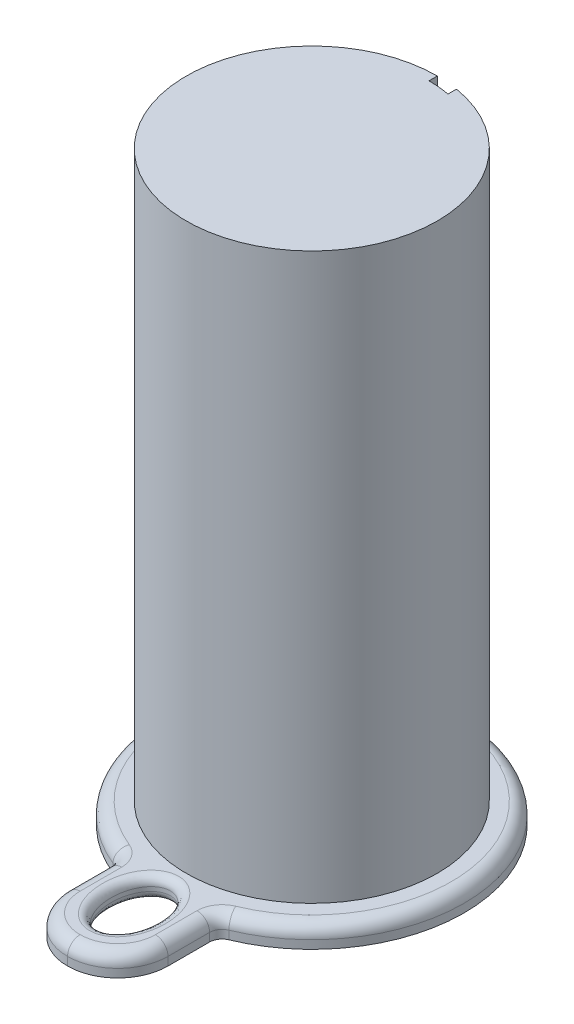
ISO-10303-21;
HEADER;
FILE_DESCRIPTION(('STEP AP214'),'2;1');
FILE_NAME('part.step','',(''),(''),'','','');
FILE_SCHEMA(('AUTOMOTIVE_DESIGN { 1 0 10303 214 1 1 1 1 }'));
ENDSEC;
DATA;
#1=APPLICATION_CONTEXT('core data for automotive mechanical design processes');
#2=APPLICATION_PROTOCOL_DEFINITION('international standard','automotive_design',2000,#1);
#3=PRODUCT_CONTEXT('',#1,'mechanical');
#4=PRODUCT('Part','Part','',(#3));
#5=PRODUCT_RELATED_PRODUCT_CATEGORY('part','',(#4));
#6=PRODUCT_DEFINITION_FORMATION('','',#4);
#7=PRODUCT_DEFINITION_CONTEXT('part definition',#1,'design');
#8=PRODUCT_DEFINITION('design','',#6,#7);
#9=PRODUCT_DEFINITION_SHAPE('','',#8);
#10=(LENGTH_UNIT() NAMED_UNIT(*) SI_UNIT(.MILLI.,.METRE.));
#11=(NAMED_UNIT(*) PLANE_ANGLE_UNIT() SI_UNIT($,.RADIAN.));
#12=(NAMED_UNIT(*) SI_UNIT($,.STERADIAN.) SOLID_ANGLE_UNIT());
#13=UNCERTAINTY_MEASURE_WITH_UNIT(LENGTH_MEASURE(1.E-05),#10,'distance_accuracy_value','');
#14=(GEOMETRIC_REPRESENTATION_CONTEXT(3) GLOBAL_UNCERTAINTY_ASSIGNED_CONTEXT((#13)) GLOBAL_UNIT_ASSIGNED_CONTEXT((#10,
#11,#12)) REPRESENTATION_CONTEXT('',''));
#15=CARTESIAN_POINT('',(0.,0.,0.));
#16=DIRECTION('',(0.,0.,1.));
#17=DIRECTION('',(1.,0.,0.));
#18=AXIS2_PLACEMENT_3D('',#15,#16,#17);
#19=CARTESIAN_POINT('',(0.,177.8,0.));
#20=DIRECTION('',(0.,1.,0.));
#21=DIRECTION('',(0.,0.,1.));
#22=AXIS2_PLACEMENT_3D('',#19,#20,#21);
#23=PLANE('',#22);
#24=DIRECTION('',(0.,0.,1.));
#25=VECTOR('',#24,1.);
#26=CARTESIAN_POINT('',(0.,177.8,0.));
#27=LINE('',#26,#25);
#28=CARTESIAN_POINT('',(0.,177.8,-38.1));
#29=VERTEX_POINT('',#28);
#30=CARTESIAN_POINT('',(0.,177.8,-35.56));
#31=VERTEX_POINT('',#30);
#32=EDGE_CURVE('E149',#29,#31,#27,.T.);
#33=ORIENTED_EDGE('',*,*,#32,.F.);
#34=CARTESIAN_POINT('',(0.,177.8,0.));
#35=DIRECTION('',(0.,1.,0.));
#36=DIRECTION('',(0.,0.,1.));
#37=AXIS2_PLACEMENT_3D('',#34,#35,#36);
#38=CIRCLE('',#37,38.1);
#39=CARTESIAN_POINT('',(6.35,177.8,-37.5671066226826));
#40=VERTEX_POINT('',#39);
#41=EDGE_CURVE('E414',#29,#40,#38,.T.);
#42=ORIENTED_EDGE('',*,*,#41,.T.);
#43=DIRECTION('',(0.,0.,-1.));
#44=VECTOR('',#43,1.);
#45=CARTESIAN_POINT('',(6.35,177.8,0.));
#46=LINE('',#45,#44);
#47=CARTESIAN_POINT('',(6.35,177.8,-34.988442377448));
#48=VERTEX_POINT('',#47);
#49=EDGE_CURVE('E157',#48,#40,#46,.T.);
#50=ORIENTED_EDGE('',*,*,#49,.F.);
#51=CARTESIAN_POINT('',(0.,177.8,0.));
#52=DIRECTION('',(0.,1.,0.));
#53=DIRECTION('',(0.,0.,1.));
#54=AXIS2_PLACEMENT_3D('',#51,#52,#53);
#55=CIRCLE('',#54,35.56);
#56=EDGE_CURVE('E146',#31,#48,#55,.F.);
#57=ORIENTED_EDGE('',*,*,#56,.F.);
#58=EDGE_LOOP('',(#33,#42,#50,#57));
#59=FACE_BOUND('',#58,.T.);
#60=ADVANCED_FACE('F37',(#59),#23,.T.);
#61=CARTESIAN_POINT('',(0.,6.35,0.));
#62=DIRECTION('',(0.,1.,0.));
#63=DIRECTION('',(0.,0.,1.));
#64=AXIS2_PLACEMENT_3D('',#61,#62,#63);
#65=PLANE('',#64);
#66=DIRECTION('',(0.,0.,-1.));
#67=VECTOR('',#66,1.);
#68=CARTESIAN_POINT('',(6.35,6.35,79.1918325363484));
#69=LINE('',#68,#67);
#70=CARTESIAN_POINT('',(6.35,6.34999999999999,-34.988442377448));
#71=VERTEX_POINT('',#70);
#72=CARTESIAN_POINT('',(6.35,6.35,-37.5671066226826));
#73=VERTEX_POINT('',#72);
#74=EDGE_CURVE('E164',#71,#73,#69,.T.);
#75=ORIENTED_EDGE('',*,*,#74,.T.);
#76=CARTESIAN_POINT('',(0.,6.34999999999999,0.));
#77=DIRECTION('',(0.,1.,0.));
#78=DIRECTION('',(0.,0.,1.));
#79=AXIS2_PLACEMENT_3D('',#76,#77,#78);
#80=CIRCLE('',#79,38.1);
#81=CARTESIAN_POINT('',(0.,6.34999999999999,-38.1));
#82=VERTEX_POINT('',#81);
#83=EDGE_CURVE('E415',#82,#73,#80,.T.);
#84=ORIENTED_EDGE('',*,*,#83,.F.);
#85=DIRECTION('',(0.,0.,-1.));
#86=VECTOR('',#85,1.);
#87=CARTESIAN_POINT('',(0.,6.35,79.1918325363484));
#88=LINE('',#87,#86);
#89=CARTESIAN_POINT('',(0.,6.34999999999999,-35.56));
#90=VERTEX_POINT('',#89);
#91=EDGE_CURVE('E52',#90,#82,#88,.T.);
#92=ORIENTED_EDGE('',*,*,#91,.F.);
#93=CARTESIAN_POINT('',(0.,6.34999999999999,0.));
#94=DIRECTION('',(0.,-1.,0.));
#95=DIRECTION('',(0.,0.,-1.));
#96=AXIS2_PLACEMENT_3D('',#93,#94,#95);
#97=CIRCLE('',#96,35.56);
#98=EDGE_CURVE('E148',#71,#90,#97,.F.);
#99=ORIENTED_EDGE('',*,*,#98,.F.);
#100=EDGE_LOOP('',(#75,#84,#92,#99));
#101=FACE_BOUND('',#100,.T.);
#102=CARTESIAN_POINT('',(1.51915721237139,3.81,65.1346232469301));
#103=CARTESIAN_POINT('',(1.51915721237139,6.35,65.1346232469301));
#104=CARTESIAN_POINT('',(2.09834863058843,6.35,67.6077057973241));
#105=CARTESIAN_POINT('',(1.37292826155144,3.81,65.1688698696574));
#106=CARTESIAN_POINT('',(1.37292826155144,6.35,65.1688698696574));
#107=CARTESIAN_POINT('',(1.87919814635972,6.35,67.6590301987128));
#108=CARTESIAN_POINT('',(1.22580323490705,3.81,65.1965016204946));
#109=CARTESIAN_POINT('',(1.22580323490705,6.35,65.1965016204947));
#110=CARTESIAN_POINT('',(1.65776925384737,6.35,67.7006498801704));
#111=CARTESIAN_POINT('',(0.930345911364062,3.81,65.2384297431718));
#112=CARTESIAN_POINT('',(0.930345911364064,6.35,65.2384297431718));
#113=CARTESIAN_POINT('',(1.21215428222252,6.35,67.7638864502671));
#114=CARTESIAN_POINT('',(0.782014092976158,3.81,65.2527311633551));
#115=CARTESIAN_POINT('',(0.782014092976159,6.35,65.2527311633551));
#116=CARTESIAN_POINT('',(0.987969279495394,6.35,67.7855109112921));
#117=CARTESIAN_POINT('',(0.484582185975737,3.81,65.2679689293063));
#118=CARTESIAN_POINT('',(0.484582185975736,6.35,65.2679689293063));
#119=CARTESIAN_POINT('',(0.538531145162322,6.35,67.8085361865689));
#120=CARTESIAN_POINT('',(0.335481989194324,3.81,65.2689033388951));
#121=CARTESIAN_POINT('',(0.335481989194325,6.35,65.268903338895));
#122=CARTESIAN_POINT('',(0.313277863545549,6.35,67.8099340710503));
#123=CARTESIAN_POINT('',(0.0370595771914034,3.81,65.2573984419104));
#124=CARTESIAN_POINT('',(0.0370595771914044,6.35,65.2573984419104));
#125=CARTESIAN_POINT('',(-0.136439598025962,6.35,67.7925966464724));
#126=CARTESIAN_POINT('',(-0.112262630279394,3.81,65.2449595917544));
#127=CARTESIAN_POINT('',(-0.112262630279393,6.35,65.2449595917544));
#128=CARTESIAN_POINT('',(-0.360903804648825,6.35,67.7738620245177));
#129=CARTESIAN_POINT('',(-0.40194034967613,3.81,65.2078577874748));
#130=CARTESIAN_POINT('',(-0.401940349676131,6.35,65.2078577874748));
#131=CARTESIAN_POINT('',(-0.794348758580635,6.35,67.7183475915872));
#132=CARTESIAN_POINT('',(-0.542313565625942,3.81,65.1839457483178));
#133=CARTESIAN_POINT('',(-0.542313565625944,6.35,65.1839457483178));
#134=CARTESIAN_POINT('',(-1.0034723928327,6.35,67.6826775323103));
#135=CARTESIAN_POINT('',(-0.822319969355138,3.81,65.1243875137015));
#136=CARTESIAN_POINT('',(-0.822319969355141,6.35,65.1243875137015));
#137=CARTESIAN_POINT('',(-1.41815374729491,6.35,67.5944751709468));
#138=CARTESIAN_POINT('',(-0.96195290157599,3.81,65.0887375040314));
#139=CARTESIAN_POINT('',(-0.961952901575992,6.35,65.0887375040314));
#140=CARTESIAN_POINT('',(-1.62371028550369,6.35,67.541937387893));
#141=CARTESIAN_POINT('',(-1.37888848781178,3.81,64.9643731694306));
#142=CARTESIAN_POINT('',(-1.37888848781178,6.35,64.9643731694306));
#143=CARTESIAN_POINT('',(-2.23300757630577,6.35,67.3601861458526));
#144=CARTESIAN_POINT('',(-1.65447893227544,3.81,64.8582122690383));
#145=CARTESIAN_POINT('',(-1.65447893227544,6.35,64.8582122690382));
#146=CARTESIAN_POINT('',(-2.62975346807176,6.35,67.2067845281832));
#147=CARTESIAN_POINT('',(-2.21374314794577,3.81,64.5932368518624));
#148=CARTESIAN_POINT('',(-2.21374314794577,6.35,64.5932368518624));
#149=CARTESIAN_POINT('',(-3.42090983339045,6.35,66.8319760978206));
#150=CARTESIAN_POINT('',(-2.49678723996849,3.81,64.4314614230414));
#151=CARTESIAN_POINT('',(-2.49678723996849,6.35,64.4314614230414));
#152=CARTESIAN_POINT('',(-3.81351029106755,6.35,66.6068132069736));
#153=CARTESIAN_POINT('',(-3.0474233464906,3.81,64.0616312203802));
#154=CARTESIAN_POINT('',(-3.0474233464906,6.35,64.0616312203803));
#155=CARTESIAN_POINT('',(-4.56308206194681,6.35,66.103389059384));
#156=CARTESIAN_POINT('',(-3.31500606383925,3.81,63.8535489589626));
#157=CARTESIAN_POINT('',(-3.31500606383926,6.35,63.8535489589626));
#158=CARTESIAN_POINT('',(-4.9200320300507,6.35,65.8250962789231));
#159=CARTESIAN_POINT('',(-3.76745624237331,3.81,63.452338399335));
#160=CARTESIAN_POINT('',(-3.76745624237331,6.35,63.452338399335));
#161=CARTESIAN_POINT('',(-5.51346272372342,6.35,65.2988617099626));
#162=CARTESIAN_POINT('',(-3.95661519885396,3.81,63.2678775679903));
#163=CARTESIAN_POINT('',(-3.95661519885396,6.35,63.2678775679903));
#164=CARTESIAN_POINT('',(-5.75813117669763,6.35,65.059994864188));
#165=CARTESIAN_POINT('',(-4.32221549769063,3.81,62.8781511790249));
#166=CARTESIAN_POINT('',(-4.32221549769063,6.35,62.8781511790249));
#167=CARTESIAN_POINT('',(-6.22564206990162,6.35,64.5616346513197));
#168=CARTESIAN_POINT('',(-4.49865171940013,3.81,62.6728773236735));
#169=CARTESIAN_POINT('',(-4.49865171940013,6.35,62.6728773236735));
#170=CARTESIAN_POINT('',(-6.44847573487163,6.35,64.3021330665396));
#171=CARTESIAN_POINT('',(-4.83796763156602,3.81,62.2438112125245));
#172=CARTESIAN_POINT('',(-4.83796763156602,6.35,62.2438112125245));
#173=CARTESIAN_POINT('',(-6.87282397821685,6.35,63.7655430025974));
#174=CARTESIAN_POINT('',(-5.00082132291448,3.81,62.0199850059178));
#175=CARTESIAN_POINT('',(-5.00082132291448,6.35,62.0199850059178));
#176=CARTESIAN_POINT('',(-7.07429786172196,6.35,63.4884225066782));
#177=CARTESIAN_POINT('',(-5.31194190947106,3.81,61.5566102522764));
#178=CARTESIAN_POINT('',(-5.31194190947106,6.35,61.5566102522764));
#179=CARTESIAN_POINT('',(-7.4560178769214,6.35,62.9198949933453));
#180=CARTESIAN_POINT('',(-5.46020483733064,3.81,61.3170574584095));
#181=CARTESIAN_POINT('',(-5.46020483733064,6.35,61.3170574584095));
#182=CARTESIAN_POINT('',(-7.63625823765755,6.35,62.6284841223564));
#183=CARTESIAN_POINT('',(-5.79332178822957,3.81,60.7342006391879));
#184=CARTESIAN_POINT('',(-5.79332178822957,6.35,60.7342006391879));
#185=CARTESIAN_POINT('',(-8.03846123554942,6.35,61.9247587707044));
#186=CARTESIAN_POINT('',(-5.97164376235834,3.81,60.3850766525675));
#187=CARTESIAN_POINT('',(-5.97164376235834,6.35,60.3850766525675));
#188=CARTESIAN_POINT('',(-8.251470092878,6.35,61.5073116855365));
#189=CARTESIAN_POINT('',(-6.29959832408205,3.81,59.6671162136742));
#190=CARTESIAN_POINT('',(-6.29959832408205,6.35,59.6671162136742));
#191=CARTESIAN_POINT('',(-8.64055237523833,6.35,60.6555182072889));
#192=CARTESIAN_POINT('',(-6.44922031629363,3.81,59.2982725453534));
#193=CARTESIAN_POINT('',(-6.44922031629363,6.35,59.2982725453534));
#194=CARTESIAN_POINT('',(-8.81661216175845,6.35,60.2211656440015));
#195=CARTESIAN_POINT('',(-6.71964800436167,3.81,58.5453147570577));
#196=CARTESIAN_POINT('',(-6.71964800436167,6.35,58.5453147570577));
#197=CARTESIAN_POINT('',(-9.13326420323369,6.35,59.3395011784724));
#198=CARTESIAN_POINT('',(-6.8404376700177,3.81,58.1611922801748));
#199=CARTESIAN_POINT('',(-6.8404376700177,6.35,58.1611922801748));
#200=CARTESIAN_POINT('',(-9.27383673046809,6.35,58.8921822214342));
#201=CARTESIAN_POINT('',(-7.05308942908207,3.81,57.3819017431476));
#202=CARTESIAN_POINT('',(-7.05308942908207,6.35,57.3819017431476));
#203=CARTESIAN_POINT('',(-9.52050267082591,6.35,57.9882370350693));
#204=CARTESIAN_POINT('',(-7.14495448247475,3.81,56.9867348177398));
#205=CARTESIAN_POINT('',(-7.14495448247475,6.35,56.9867348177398));
#206=CARTESIAN_POINT('',(-9.62659961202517,6.35,57.5316117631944));
#207=CARTESIAN_POINT('',(-7.30166759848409,3.81,56.1792872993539));
#208=CARTESIAN_POINT('',(-7.30166759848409,6.35,56.1792872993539));
#209=CARTESIAN_POINT('',(-9.80724767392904,6.35,56.6008403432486));
#210=CARTESIAN_POINT('',(-7.36581678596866,3.81,55.7668234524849));
#211=CARTESIAN_POINT('',(-7.36581678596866,6.35,55.7668234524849));
#212=CARTESIAN_POINT('',(-9.88098343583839,6.35,56.1265363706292));
#213=CARTESIAN_POINT('',(-7.46381822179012,3.81,54.9374139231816));
#214=CARTESIAN_POINT('',(-7.46381822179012,6.35,54.9374139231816));
#215=CARTESIAN_POINT('',(-9.99355747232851,6.35,55.173791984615));
#216=CARTESIAN_POINT('',(-7.49766872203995,3.81,54.5204679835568));
#217=CARTESIAN_POINT('',(-7.49766872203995,6.35,54.5204679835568));
#218=CARTESIAN_POINT('',(-10.0323937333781,6.35,54.6953513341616));
#219=CARTESIAN_POINT('',(-7.53491319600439,3.81,53.6854351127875));
#220=CARTESIAN_POINT('',(-7.5349131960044,6.35,53.6854351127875));
#221=CARTESIAN_POINT('',(-10.0751427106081,6.35,53.7369067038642));
#222=CARTESIAN_POINT('',(-7.5383069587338,3.81,53.267348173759));
#223=CARTESIAN_POINT('',(-7.5383069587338,6.35,53.267348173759));
#224=CARTESIAN_POINT('',(-10.0790551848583,6.35,53.2569027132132));
#225=CARTESIAN_POINT('',(-7.5143396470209,3.81,52.4334098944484));
#226=CARTESIAN_POINT('',(-7.5143396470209,6.35,52.4334098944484));
#227=CARTESIAN_POINT('',(-10.0514949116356,6.35,52.2979233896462));
#228=CARTESIAN_POINT('',(-7.48698086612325,3.81,52.0175583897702));
#229=CARTESIAN_POINT('',(-7.48698086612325,6.35,52.0175583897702));
#230=CARTESIAN_POINT('',(-10.0200248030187,6.35,51.8189479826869));
#231=CARTESIAN_POINT('',(-7.40338859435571,3.81,51.2137972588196));
#232=CARTESIAN_POINT('',(-7.40338859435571,6.35,51.2137972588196));
#233=CARTESIAN_POINT('',(-9.92345080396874,6.35,50.8903633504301));
#234=CARTESIAN_POINT('',(-7.34878369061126,3.81,50.8255858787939));
#235=CARTESIAN_POINT('',(-7.34878369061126,6.35,50.8255858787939));
#236=CARTESIAN_POINT('',(-9.86024277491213,6.35,50.4405577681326));
#237=CARTESIAN_POINT('',(-7.21121524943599,3.81,50.0576174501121));
#238=CARTESIAN_POINT('',(-7.21121524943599,6.35,50.0576174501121));
#239=CARTESIAN_POINT('',(-9.70015940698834,6.35,49.5468959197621));
#240=CARTESIAN_POINT('',(-7.12824921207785,3.81,49.6778611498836));
#241=CARTESIAN_POINT('',(-7.12824921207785,6.35,49.6778611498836));
#242=CARTESIAN_POINT('',(-9.60328110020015,6.35,49.103040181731));
#243=CARTESIAN_POINT('',(-6.93360262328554,3.81,48.9309454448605));
#244=CARTESIAN_POINT('',(-6.93360262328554,6.35,48.9309454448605));
#245=CARTESIAN_POINT('',(-9.37441783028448,6.35,48.2248107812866));
#246=CARTESIAN_POINT('',(-6.821949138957,3.81,48.5637745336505));
#247=CARTESIAN_POINT('',(-6.821949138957,6.35,48.5637745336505));
#248=CARTESIAN_POINT('',(-9.242465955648,6.35,47.7904285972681));
#249=CARTESIAN_POINT('',(-6.56973019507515,3.81,47.8462756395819));
#250=CARTESIAN_POINT('',(-6.56973019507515,6.35,47.8462756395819));
#251=CARTESIAN_POINT('',(-8.94170454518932,6.35,46.9348579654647));
#252=CARTESIAN_POINT('',(-6.42917560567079,3.81,47.495941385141));
#253=CARTESIAN_POINT('',(-6.42917560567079,6.35,47.495941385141));
#254=CARTESIAN_POINT('',(-8.77290886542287,6.35,46.5136646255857));
#255=CARTESIAN_POINT('',(-6.05373211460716,3.81,46.6740165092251));
#256=CARTESIAN_POINT('',(-6.05373211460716,6.35,46.6740165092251));
#257=CARTESIAN_POINT('',(-8.31691838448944,6.35,45.5152923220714));
#258=CARTESIAN_POINT('',(-5.80401035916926,3.81,46.2132513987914));
#259=CARTESIAN_POINT('',(-5.80401035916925,6.35,46.2132513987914));
#260=CARTESIAN_POINT('',(-8.009765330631,6.35,44.946845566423));
#261=CARTESIAN_POINT('',(-5.3878514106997,3.81,45.5683208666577));
#262=CARTESIAN_POINT('',(-5.3878514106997,6.35,45.5683208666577));
#263=CARTESIAN_POINT('',(-7.48625595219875,6.35,44.1356357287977));
#264=CARTESIAN_POINT('',(-5.24226468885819,3.81,45.3611158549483));
#265=CARTESIAN_POINT('',(-5.24226468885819,6.35,45.3611158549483));
#266=CARTESIAN_POINT('',(-7.30137052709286,6.35,43.872233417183));
#267=CARTESIAN_POINT('',(-4.93782516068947,3.81,44.9641006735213));
#268=CARTESIAN_POINT('',(-4.93782516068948,6.35,44.9641006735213));
#269=CARTESIAN_POINT('',(-6.91002631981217,6.35,43.3618726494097));
#270=CARTESIAN_POINT('',(-4.77897525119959,3.81,44.774286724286));
#271=CARTESIAN_POINT('',(-4.77897525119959,6.35,44.774286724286));
#272=CARTESIAN_POINT('',(-6.70357224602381,6.35,43.1149106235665));
#273=CARTESIAN_POINT('',(-4.48343645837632,3.81,44.45190769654));
#274=CARTESIAN_POINT('',(-4.48343645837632,6.35,44.4519076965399));
#275=CARTESIAN_POINT('',(-6.31430113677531,6.35,42.6902939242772));
#276=CARTESIAN_POINT('',(-4.34903006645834,3.81,44.3156566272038));
#277=CARTESIAN_POINT('',(-4.34903006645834,6.35,44.3156566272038));
#278=CARTESIAN_POINT('',(-6.1355272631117,6.35,42.5089227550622));
#279=CARTESIAN_POINT('',(-4.07318322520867,3.81,44.0565722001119));
#280=CARTESIAN_POINT('',(-4.07318322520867,6.35,44.0565722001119));
#281=CARTESIAN_POINT('',(-5.7645513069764,6.35,42.1604891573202));
#282=CARTESIAN_POINT('',(-3.93174425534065,3.81,43.9337360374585));
#283=CARTESIAN_POINT('',(-3.93174425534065,6.35,43.9337360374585));
#284=CARTESIAN_POINT('',(-5.57235204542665,6.35,41.993423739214));
#285=CARTESIAN_POINT('',(-3.64246621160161,3.81,43.7023701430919));
#286=CARTESIAN_POINT('',(-3.64246621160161,6.35,43.7023701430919));
#287=CARTESIAN_POINT('',(-5.17479974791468,6.35,41.6754613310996));
#288=CARTESIAN_POINT('',(-3.49462357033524,3.81,43.5938485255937));
#289=CARTESIAN_POINT('',(-3.49462357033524,6.35,43.5938485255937));
#290=CARTESIAN_POINT('',(-4.96943934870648,6.35,41.5245735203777));
#291=CARTESIAN_POINT('',(-3.19343194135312,3.81,43.3920312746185));
#292=CARTESIAN_POINT('',(-3.19343194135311,6.35,43.3920312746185));
#293=CARTESIAN_POINT('',(-4.54641083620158,6.35,41.2411194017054));
#294=CARTESIAN_POINT('',(-3.04008313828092,3.81,43.2987351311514));
#295=CARTESIAN_POINT('',(-3.04008313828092,6.35,43.2987351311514));
#296=CARTESIAN_POINT('',(-4.32874313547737,6.35,41.1085524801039));
#297=CARTESIAN_POINT('',(-2.72718438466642,3.81,43.1271889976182));
#298=CARTESIAN_POINT('',(-2.72718438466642,6.35,43.1271889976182));
#299=CARTESIAN_POINT('',(-3.88000015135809,6.35,40.8625319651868));
#300=CARTESIAN_POINT('',(-2.56758791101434,3.81,43.049097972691));
#301=CARTESIAN_POINT('',(-2.56758791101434,6.35,43.049097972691));
#302=CARTESIAN_POINT('',(-3.64881300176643,6.35,40.7492816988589));
#303=CARTESIAN_POINT('',(-2.24456528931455,3.81,42.9096598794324));
#304=CARTESIAN_POINT('',(-2.24456528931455,6.35,42.9096598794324));
#305=CARTESIAN_POINT('',(-3.17665587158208,6.35,40.5454692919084));
#306=CARTESIAN_POINT('',(-2.08113981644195,3.81,42.8483098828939));
#307=CARTESIAN_POINT('',(-2.08113981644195,6.35,42.8483098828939));
#308=CARTESIAN_POINT('',(-2.93568761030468,6.35,40.4549031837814));
#309=CARTESIAN_POINT('',(-1.75181460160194,3.81,42.7428531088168));
#310=CARTESIAN_POINT('',(-1.75181460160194,6.35,42.7428531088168));
#311=CARTESIAN_POINT('',(-2.4467111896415,6.35,40.298324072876));
#312=CARTESIAN_POINT('',(-1.58592395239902,3.81,42.6986941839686));
#313=CARTESIAN_POINT('',(-1.58592395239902,6.35,42.6986941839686));
#314=CARTESIAN_POINT('',(-2.19872680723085,6.35,40.2322368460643));
#315=CARTESIAN_POINT('',(-1.25208258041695,3.81,42.6276007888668));
#316=CARTESIAN_POINT('',(-1.25208258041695,6.35,42.6276007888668));
#317=CARTESIAN_POINT('',(-1.69749272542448,6.35,40.1254984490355));
#318=CARTESIAN_POINT('',(-1.08413392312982,3.81,42.6006502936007));
#319=CARTESIAN_POINT('',(-1.08413392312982,6.35,42.6006502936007));
#320=CARTESIAN_POINT('',(-1.44424815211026,6.35,40.084823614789));
#321=CARTESIAN_POINT('',(-0.875296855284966,3.81,42.577976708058));
#322=CARTESIAN_POINT('',(-0.875296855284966,6.35,42.577976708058));
#323=CARTESIAN_POINT('',(-1.12889145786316,6.35,40.0505828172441));
#324=CARTESIAN_POINT('',(-0.834974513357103,3.81,42.5740968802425));
#325=CARTESIAN_POINT('',(-0.834974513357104,6.35,42.5740968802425));
#326=CARTESIAN_POINT('',(-1.06798123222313,6.35,40.0447222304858));
#327=CARTESIAN_POINT('',(-0.754260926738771,3.81,42.5673240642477));
#328=CARTESIAN_POINT('',(-0.754260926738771,6.35,42.5673240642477));
#329=CARTESIAN_POINT('',(-0.946036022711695,6.35,40.0344896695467));
#330=CARTESIAN_POINT('',(-0.713869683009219,3.81,42.5644310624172));
#331=CARTESIAN_POINT('',(-0.713869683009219,6.35,42.5644310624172));
#332=CARTESIAN_POINT('',(-0.885001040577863,6.35,40.0301176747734));
#333=CARTESIAN_POINT('',(-0.527486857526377,3.81,42.5533709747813));
#334=CARTESIAN_POINT('',(-0.527486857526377,6.35,42.5533709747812));
#335=CARTESIAN_POINT('',(-0.603359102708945,6.35,40.0134062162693));
#336=CARTESIAN_POINT('',(-0.38108886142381,3.81,42.5511516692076));
#337=CARTESIAN_POINT('',(-0.38108886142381,6.35,42.5511516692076));
#338=CARTESIAN_POINT('',(-0.382138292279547,6.35,40.0100627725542));
#339=CARTESIAN_POINT('',(-0.0879532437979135,3.81,42.559617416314));
#340=CARTESIAN_POINT('',(-0.0879532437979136,6.35,42.559617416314));
#341=CARTESIAN_POINT('',(0.0598374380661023,6.35,40.0228261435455));
#342=CARTESIAN_POINT('',(0.0587845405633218,3.81,42.5703112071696));
#343=CARTESIAN_POINT('',(0.0587845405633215,6.35,42.5703112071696));
#344=CARTESIAN_POINT('',(0.280591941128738,6.35,40.0389461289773));
#345=CARTESIAN_POINT('',(0.352348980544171,3.81,42.6046210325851));
#346=CARTESIAN_POINT('',(0.352348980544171,6.35,42.6046210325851));
#347=CARTESIAN_POINT('',(0.720343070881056,6.35,40.0903410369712));
#348=CARTESIAN_POINT('',(0.499175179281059,3.81,42.6282640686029));
#349=CARTESIAN_POINT('',(0.499175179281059,6.35,42.6282640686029));
#350=CARTESIAN_POINT('',(0.939335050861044,6.35,40.1256559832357));
#351=CARTESIAN_POINT('',(0.792069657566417,3.81,42.6883888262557));
#352=CARTESIAN_POINT('',(0.792069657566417,6.35,42.6883888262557));
#353=CARTESIAN_POINT('',(1.37355007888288,6.35,40.2147884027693));
#354=CARTESIAN_POINT('',(0.9381376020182,3.81,42.7248758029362));
#355=CARTESIAN_POINT('',(0.9381376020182,6.35,42.7248758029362));
#356=CARTESIAN_POINT('',(1.58877154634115,6.35,40.2686134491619));
#357=CARTESIAN_POINT('',(1.37267980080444,3.81,42.8529321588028));
#358=CARTESIAN_POINT('',(1.37267980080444,6.35,42.8529321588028));
#359=CARTESIAN_POINT('',(2.22417716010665,6.35,40.4558738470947));
#360=CARTESIAN_POINT('',(1.65935222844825,3.81,42.963316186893));
#361=CARTESIAN_POINT('',(1.65935222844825,6.35,42.963316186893));
#362=CARTESIAN_POINT('',(2.63690398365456,6.35,40.6154385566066));
#363=CARTESIAN_POINT('',(2.22235168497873,3.81,43.2320016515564));
#364=CARTESIAN_POINT('',(2.22235168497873,6.35,43.2320016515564));
#365=CARTESIAN_POINT('',(3.43281535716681,6.35,40.9952322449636));
#366=CARTESIAN_POINT('',(2.49868039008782,3.81,43.3902952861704));
#367=CARTESIAN_POINT('',(2.49868039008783,6.35,43.3902952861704));
#368=CARTESIAN_POINT('',(3.81600470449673,6.35,41.215451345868));
#369=CARTESIAN_POINT('',(2.95171259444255,3.81,43.6940316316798));
#370=CARTESIAN_POINT('',(2.95171259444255,6.35,43.6940316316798));
#371=CARTESIAN_POINT('',(4.43284844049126,6.35,41.6290202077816));
#372=CARTESIAN_POINT('',(3.13240985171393,3.81,43.8278513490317));
#373=CARTESIAN_POINT('',(3.13240985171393,6.35,43.8278513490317));
#374=CARTESIAN_POINT('',(4.67562204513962,6.35,41.8090284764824));
#375=CARTESIAN_POINT('',(3.48557936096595,3.81,44.1146115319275));
#376=CARTESIAN_POINT('',(3.48557936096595,6.35,44.1146115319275));
#377=CARTESIAN_POINT('',(5.14448369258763,6.35,42.1897242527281));
#378=CARTESIAN_POINT('',(3.65804912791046,3.81,44.2675577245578));
#379=CARTESIAN_POINT('',(3.65804912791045,6.35,44.2675577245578));
#380=CARTESIAN_POINT('',(5.37056670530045,6.35,42.3904179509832));
#381=CARTESIAN_POINT('',(3.99381997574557,3.81,44.5910403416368));
#382=CARTESIAN_POINT('',(3.99381997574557,6.35,44.5910403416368));
#383=CARTESIAN_POINT('',(5.80592931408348,6.35,42.8098464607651));
#384=CARTESIAN_POINT('',(4.15710619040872,3.81,44.7616040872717));
#385=CARTESIAN_POINT('',(4.15710619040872,6.35,44.7616040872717));
#386=CARTESIAN_POINT('',(6.01518188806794,6.35,43.0286091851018));
#387=CARTESIAN_POINT('',(4.47337519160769,3.81,45.1183423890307));
#388=CARTESIAN_POINT('',(4.47337519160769,6.35,45.1183423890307));
#389=CARTESIAN_POINT('',(6.41656080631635,6.35,43.4813502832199));
#390=CARTESIAN_POINT('',(4.62635520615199,3.81,45.3045211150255));
#391=CARTESIAN_POINT('',(4.62635520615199,6.35,45.3045211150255));
#392=CARTESIAN_POINT('',(6.60868254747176,6.35,43.7153327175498));
#393=CARTESIAN_POINT('',(4.97501833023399,3.81,45.7609840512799));
#394=CARTESIAN_POINT('',(4.97501833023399,6.35,45.7609840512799));
#395=CARTESIAN_POINT('',(7.0428681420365,6.35,44.2837505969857));
#396=CARTESIAN_POINT('',(5.16598047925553,3.81,46.0372179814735));
#397=CARTESIAN_POINT('',(5.16598047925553,6.35,46.0372179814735));
#398=CARTESIAN_POINT('',(7.2776612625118,6.35,44.6237536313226));
#399=CARTESIAN_POINT('',(5.52636832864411,3.81,46.6110794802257));
#400=CARTESIAN_POINT('',(5.52636832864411,6.35,46.6110794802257));
#401=CARTESIAN_POINT('',(7.71673732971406,6.35,45.3229206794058));
#402=CARTESIAN_POINT('',(5.69578658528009,3.81,46.9087143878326));
#403=CARTESIAN_POINT('',(5.69578658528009,6.35,46.9087143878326));
#404=CARTESIAN_POINT('',(7.92100973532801,6.35,45.6820912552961));
#405=CARTESIAN_POINT('',(6.01264305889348,3.81,47.5217675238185));
#406=CARTESIAN_POINT('',(6.01264305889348,6.35,47.5217675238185));
#407=CARTESIAN_POINT('',(8.30031799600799,6.35,46.4159775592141));
#408=CARTESIAN_POINT('',(6.16005776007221,3.81,47.8372042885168));
#409=CARTESIAN_POINT('',(6.16005776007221,6.35,47.8372042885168));
#410=CARTESIAN_POINT('',(8.47532259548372,6.35,46.7907093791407));
#411=CARTESIAN_POINT('',(6.43243515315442,3.81,48.4821032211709));
#412=CARTESIAN_POINT('',(6.43243515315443,6.35,48.4821032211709));
#413=CARTESIAN_POINT('',(8.79689956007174,6.35,47.5521026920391));
#414=CARTESIAN_POINT('',(6.55739773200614,3.81,48.8115654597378));
#415=CARTESIAN_POINT('',(6.55739773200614,6.35,48.8115654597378));
#416=CARTESIAN_POINT('',(8.94347178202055,6.35,47.9387642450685));
#417=CARTESIAN_POINT('',(6.81796301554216,3.81,49.5791628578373));
#418=CARTESIAN_POINT('',(6.81796301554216,6.35,49.5791628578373));
#419=CARTESIAN_POINT('',(9.24786273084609,6.35,48.8354548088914));
#420=CARTESIAN_POINT('',(6.94605980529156,3.81,50.020995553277));
#421=CARTESIAN_POINT('',(6.94605980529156,6.35,50.020995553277));
#422=CARTESIAN_POINT('',(9.3965181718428,6.35,49.3486077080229));
#423=CARTESIAN_POINT('',(7.1647724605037,3.81,50.9174314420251));
#424=CARTESIAN_POINT('',(7.1647724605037,6.35,50.9174314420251));
#425=CARTESIAN_POINT('',(9.64955881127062,6.35,50.3857596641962));
#426=CARTESIAN_POINT('',(7.25537771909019,3.81,51.372038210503));
#427=CARTESIAN_POINT('',(7.2553777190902,6.35,51.372038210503));
#428=CARTESIAN_POINT('',(9.75393148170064,6.35,50.9097617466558));
#429=CARTESIAN_POINT('',(7.39918967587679,3.81,52.2895143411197));
#430=CARTESIAN_POINT('',(7.39918967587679,6.35,52.2895143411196));
#431=CARTESIAN_POINT('',(9.91936829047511,6.35,51.9651998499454));
#432=CARTESIAN_POINT('',(7.45235027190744,3.81,52.7523931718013));
#433=CARTESIAN_POINT('',(7.45235027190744,6.35,52.7523931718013));
#434=CARTESIAN_POINT('',(9.98037904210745,6.35,52.4966442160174));
#435=CARTESIAN_POINT('',(7.52095623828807,3.81,53.6811485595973));
#436=CARTESIAN_POINT('',(7.52095623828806,6.35,53.6811485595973));
#437=CARTESIAN_POINT('',(10.0591239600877,6.35,53.562660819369));
#438=CARTESIAN_POINT('',(7.53640575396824,3.81,54.1470247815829));
#439=CARTESIAN_POINT('',(7.53640575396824,6.35,54.1470247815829));
#440=CARTESIAN_POINT('',(10.076862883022,6.35,54.0972327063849));
#441=CARTESIAN_POINT('',(7.52922576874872,3.81,55.0814006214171));
#442=CARTESIAN_POINT('',(7.52922576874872,6.35,55.0814006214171));
#443=CARTESIAN_POINT('',(10.0686139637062,6.35,55.1708399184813));
#444=CARTESIAN_POINT('',(7.5062552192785,3.81,55.5498865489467));
#445=CARTESIAN_POINT('',(7.5062552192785,6.35,55.5498865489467));
#446=CARTESIAN_POINT('',(10.0422344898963,6.35,55.7098725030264));
#447=CARTESIAN_POINT('',(7.42100750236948,3.81,56.4804318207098));
#448=CARTESIAN_POINT('',(7.42100750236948,6.35,56.4804318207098));
#449=CARTESIAN_POINT('',(9.94384252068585,6.35,56.7839089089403));
#450=CARTESIAN_POINT('',(7.35872236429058,3.81,56.9424898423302));
#451=CARTESIAN_POINT('',(7.35872236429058,6.35,56.9424898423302));
#452=CARTESIAN_POINT('',(9.87182077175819,6.35,57.3189118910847));
#453=CARTESIAN_POINT('',(7.19425700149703,3.81,57.8536744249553));
#454=CARTESIAN_POINT('',(7.19425700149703,6.35,57.8536744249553));
#455=CARTESIAN_POINT('',(9.68041232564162,6.35,58.3793954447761));
#456=CARTESIAN_POINT('',(7.09215750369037,3.81,58.3028251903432));
#457=CARTESIAN_POINT('',(7.09215750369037,6.35,58.3028251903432));
#458=CARTESIAN_POINT('',(9.56112146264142,6.35,58.9048930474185));
#459=CARTESIAN_POINT('',(6.84750832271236,3.81,59.1823672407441));
#460=CARTESIAN_POINT('',(6.84750832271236,6.35,59.1823672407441));
#461=CARTESIAN_POINT('',(9.27272880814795,6.35,59.9416805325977));
#462=CARTESIAN_POINT('',(6.70498352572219,3.81,59.6127698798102));
#463=CARTESIAN_POINT('',(6.70498352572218,6.35,59.6127698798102));
#464=CARTESIAN_POINT('',(9.1036576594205,6.35,60.4529789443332));
#465=CARTESIAN_POINT('',(6.33831893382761,3.81,60.5515997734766));
#466=CARTESIAN_POINT('',(6.3383189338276,6.35,60.5515997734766));
#467=CARTESIAN_POINT('',(8.66356205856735,6.35,61.5799579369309));
#468=CARTESIAN_POINT('',(6.10270290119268,3.81,61.0528862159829));
#469=CARTESIAN_POINT('',(6.10270290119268,6.35,61.0528862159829));
#470=CARTESIAN_POINT('',(8.37764914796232,6.35,62.1900569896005));
#471=CARTESIAN_POINT('',(5.70284662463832,3.81,61.7602357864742));
#472=CARTESIAN_POINT('',(5.70284662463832,6.35,61.7602357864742));
#473=CARTESIAN_POINT('',(7.88205911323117,6.35,63.0666694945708));
#474=CARTESIAN_POINT('',(5.56186953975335,3.81,61.9885299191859));
#475=CARTESIAN_POINT('',(5.56186953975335,6.35,61.9885299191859));
#476=CARTESIAN_POINT('',(7.7058023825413,6.35,63.3523746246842));
#477=CARTESIAN_POINT('',(5.26490623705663,3.81,62.4280052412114));
#478=CARTESIAN_POINT('',(5.26490623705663,6.35,62.4280052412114));
#479=CARTESIAN_POINT('',(7.33018412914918,6.35,63.9082675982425));
#480=CARTESIAN_POINT('',(5.10892314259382,3.81,62.6391899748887));
#481=CARTESIAN_POINT('',(5.10892314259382,6.35,62.6391899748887));
#482=CARTESIAN_POINT('',(7.13082741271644,6.35,64.1784586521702));
#483=CARTESIAN_POINT('',(4.81681692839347,3.81,62.9998616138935));
#484=CARTESIAN_POINT('',(4.81681692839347,6.35,62.9998616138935));
#485=CARTESIAN_POINT('',(6.75257533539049,6.35,64.6454890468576));
#486=CARTESIAN_POINT('',(4.68332165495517,3.81,63.1530390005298));
#487=CARTESIAN_POINT('',(4.68332165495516,6.35,63.1530390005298));
#488=CARTESIAN_POINT('',(6.57806322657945,6.35,64.8458870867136));
#489=CARTESIAN_POINT('',(4.40809847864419,3.81,63.445737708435));
#490=CARTESIAN_POINT('',(4.40809847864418,6.35,63.445737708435));
#491=CARTESIAN_POINT('',(6.21427039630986,6.35,65.2327803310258));
#492=CARTESIAN_POINT('',(4.26637247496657,3.81,63.5852621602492));
#493=CARTESIAN_POINT('',(4.26637247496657,6.35,63.5852621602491));
#494=CARTESIAN_POINT('',(6.02499307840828,6.35,65.4192787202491));
#495=CARTESIAN_POINT('',(3.97551399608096,3.81,63.8493833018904));
#496=CARTESIAN_POINT('',(3.97551399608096,6.35,63.8493833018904));
#497=CARTESIAN_POINT('',(5.63200757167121,6.35,65.776137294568));
#498=CARTESIAN_POINT('',(3.82638705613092,3.81,63.9739909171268));
#499=CARTESIAN_POINT('',(3.82638705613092,6.35,63.9739909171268));
#500=CARTESIAN_POINT('',(5.42831012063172,6.35,65.9465092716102));
#501=CARTESIAN_POINT('',(3.52149771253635,3.81,64.2073184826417));
#502=CARTESIAN_POINT('',(3.52149771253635,6.35,64.2073184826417));
#503=CARTESIAN_POINT('',(5.00692000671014,6.35,66.2689913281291));
#504=CARTESIAN_POINT('',(3.36573630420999,3.81,64.3160408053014));
#505=CARTESIAN_POINT('',(3.36573630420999,6.35,64.3160408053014));
#506=CARTESIAN_POINT('',(4.78922944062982,6.35,66.4211041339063));
#507=CARTESIAN_POINT('',(3.07301889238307,3.81,64.5012148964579));
#508=CARTESIAN_POINT('',(3.07301889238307,6.35,64.5012148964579));
#509=CARTESIAN_POINT('',(4.37545221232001,6.35,66.6828599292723));
#510=CARTESIAN_POINT('',(2.93687118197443,3.81,64.5800574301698));
#511=CARTESIAN_POINT('',(2.93687118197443,6.35,64.5800574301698));
#512=CARTESIAN_POINT('',(4.18121732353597,6.35,66.7954342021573));
#513=CARTESIAN_POINT('',(2.66110671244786,3.81,64.7253158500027));
#514=CARTESIAN_POINT('',(2.66110671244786,6.35,64.7253158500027));
#515=CARTESIAN_POINT('',(3.78429365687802,6.35,67.0045121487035));
#516=CARTESIAN_POINT('',(2.52149053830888,3.81,64.7917338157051));
#517=CARTESIAN_POINT('',(2.52149053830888,6.35,64.7917338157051));
#518=CARTESIAN_POINT('',(3.58160630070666,6.35,67.1010185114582));
#519=CARTESIAN_POINT('',(2.23936545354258,3.81,64.9118229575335));
#520=CARTESIAN_POINT('',(2.23936545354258,6.35,64.9118229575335));
#521=CARTESIAN_POINT('',(3.16884756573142,6.35,67.2767120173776));
#522=CARTESIAN_POINT('',(2.09685659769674,3.81,64.9654943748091));
#523=CARTESIAN_POINT('',(2.09685659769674,6.35,64.9654943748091));
#524=CARTESIAN_POINT('',(2.95877632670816,6.35,67.3558994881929));
#525=CARTESIAN_POINT('',(1.80957986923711,3.81,65.0598353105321));
#526=CARTESIAN_POINT('',(1.80957986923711,6.35,65.0598353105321));
#527=CARTESIAN_POINT('',(2.5326712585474,6.35,67.4958304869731));
#528=CARTESIAN_POINT('',(1.66481307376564,3.81,65.100510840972));
#529=CARTESIAN_POINT('',(1.66481307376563,6.35,65.100510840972));
#530=CARTESIAN_POINT('',(2.31664023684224,6.35,67.556582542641));
#531=CARTESIAN_POINT('',(1.51915721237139,3.81,65.1346232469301));
#532=CARTESIAN_POINT('',(1.51915721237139,6.35,65.1346232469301));
#533=CARTESIAN_POINT('',(2.09834863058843,6.35,67.6077057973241));
#534=(BOUNDED_SURFACE() B_SPLINE_SURFACE(3,2,((#102,#103,#104),(#105,#106,#107),(#108,#109,
#110),(#111,#112,#113),(#114,#115,#116),(#117,#118,#119),(#120,#121,#122),(#123,#124,#125),
(#126,#127,#128),(#129,#130,#131),(#132,#133,#134),(#135,#136,#137),(#138,#139,#140),(#141,#142,
#143),(#144,#145,#146),(#147,#148,#149),(#150,#151,#152),(#153,#154,#155),(#156,#157,#158),
(#159,#160,#161),(#162,#163,#164),(#165,#166,#167),(#168,#169,#170),(#171,#172,#173),(#174,#175,
#176),(#177,#178,#179),(#180,#181,#182),(#183,#184,#185),(#186,#187,#188),(#189,#190,#191),
(#192,#193,#194),(#195,#196,#197),(#198,#199,#200),(#201,#202,#203),(#204,#205,#206),(#207,#208,
#209),(#210,#211,#212),(#213,#214,#215),(#216,#217,#218),(#219,#220,#221),(#222,#223,#224),
(#225,#226,#227),(#228,#229,#230),(#231,#232,#233),(#234,#235,#236),(#237,#238,#239),(#240,#241,
#242),(#243,#244,#245),(#246,#247,#248),(#249,#250,#251),(#252,#253,#254),(#255,#256,#257),
(#258,#259,#260),(#261,#262,#263),(#264,#265,#266),(#267,#268,#269),(#270,#271,#272),(#273,#274,
#275),(#276,#277,#278),(#279,#280,#281),(#282,#283,#284),(#285,#286,#287),(#288,#289,#290),
(#291,#292,#293),(#294,#295,#296),(#297,#298,#299),(#300,#301,#302),(#303,#304,#305),(#306,#307,
#308),(#309,#310,#311),(#312,#313,#314),(#315,#316,#317),(#318,#319,#320),(#321,#322,#323),
(#324,#325,#326),(#327,#328,#329),(#330,#331,#332),(#333,#334,#335),(#336,#337,#338),(#339,#340,
#341),(#342,#343,#344),(#345,#346,#347),(#348,#349,#350),(#351,#352,#353),(#354,#355,#356),
(#357,#358,#359),(#360,#361,#362),(#363,#364,#365),(#366,#367,#368),(#369,#370,#371),(#372,#373,
#374),(#375,#376,#377),(#378,#379,#380),(#381,#382,#383),(#384,#385,#386),(#387,#388,#389),
(#390,#391,#392),(#393,#394,#395),(#396,#397,#398),(#399,#400,#401),(#402,#403,#404),(#405,#406,
#407),(#408,#409,#410),(#411,#412,#413),(#414,#415,#416),(#417,#418,#419),(#420,#421,#422),
(#423,#424,#425),(#426,#427,#428),(#429,#430,#431),(#432,#433,#434),(#435,#436,#437),(#438,#439,
#440),(#441,#442,#443),(#444,#445,#446),(#447,#448,#449),(#450,#451,#452),(#453,#454,#455),
(#456,#457,#458),(#459,#460,#461),(#462,#463,#464),(#465,#466,#467),(#468,#469,#470),(#471,#472,
#473),(#474,#475,#476),(#477,#478,#479),(#480,#481,#482),(#483,#484,#485),(#486,#487,#488),
(#489,#490,#491),(#492,#493,#494),(#495,#496,#497),(#498,#499,#500),(#501,#502,#503),(#504,#505,
#506),(#507,#508,#509),(#510,#511,#512),(#513,#514,#515),(#516,#517,#518),(#519,#520,#521),
(#522,#523,#524),(#525,#526,#527),(#528,#529,#530),(#531,#532,#533)),.UNSPECIFIED.,.T.,.F.,
.F.) B_SPLINE_SURFACE_WITH_KNOTS((4,2,2,2,2,2,2,2,2,2,2,2,2,2,2,2,2,2,2,2,2,2,2,2,2,2,2,2,2,2,2,
2,2,2,2,2,2,2,2,2,2,2,2,2,2,2,2,2,2,2,2,2,2,2,2,2,2,2,2,2,2,2,2,2,2,2,2,2,2,2,2,4),(3,3),(0.,
0.675022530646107,1.34978931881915,2.0246538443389,2.69949533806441,3.33519243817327,
3.97109630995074,5.2417748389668,6.59462128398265,7.94827292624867,8.97276377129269,
9.99766467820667,11.0244844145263,12.0515825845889,13.4555062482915,14.8599472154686,
16.2651672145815,17.6702433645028,19.1089319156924,20.5477034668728,21.9864849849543,
23.425159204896,24.7866163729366,26.1481935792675,27.5084908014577,28.8682773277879,
30.7988142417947,31.7633603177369,32.7276962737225,33.4910228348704,34.2541894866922,
35.017786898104,35.7813587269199,36.5525289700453,37.3235642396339,38.0922420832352,
38.860203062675,39.0437677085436,39.227329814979,39.8900958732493,40.5533106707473,
41.2179136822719,41.8827889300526,43.2041783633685,44.5253527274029,45.4308997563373,
46.3367185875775,47.2439638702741,48.1514522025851,49.3892087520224,50.6273918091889,
51.8668888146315,53.1063920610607,54.70699445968,56.3080493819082,57.9110721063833,
59.5139186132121,61.1310689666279,62.7485472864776,64.3627629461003,65.9759870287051,
67.9895220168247,68.9957129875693,70.0016949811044,70.7982034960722,71.5945289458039,
72.3902675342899,73.1858871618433,73.8587012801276,74.5314026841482,75.2040913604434,
75.8764683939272),(0.,1.),
.UNSPECIFIED.) GEOMETRIC_REPRESENTATION_ITEM() RATIONAL_B_SPLINE_SURFACE(((1.,0.707106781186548,
1.),(1.,0.707106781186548,1.),(1.,0.707106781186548,1.),(1.,0.707106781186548,1.),(1.,
0.707106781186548,1.),(1.,0.707106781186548,1.),(1.,0.707106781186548,1.),(1.,0.707106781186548,
1.),(1.,0.707106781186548,1.),(1.,0.707106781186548,1.),(1.,0.707106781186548,1.),(1.,
0.707106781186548,1.),(1.,0.707106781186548,1.),(1.,0.707106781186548,1.),(1.,0.707106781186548,
1.),(1.,0.707106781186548,1.),(1.,0.707106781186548,1.),(1.,0.707106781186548,1.),(1.,
0.707106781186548,1.),(1.,0.707106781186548,1.),(1.,0.707106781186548,1.),(1.,0.707106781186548,
1.),(1.,0.707106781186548,1.),(1.,0.707106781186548,1.),(1.,0.707106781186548,1.),(1.,
0.707106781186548,1.),(1.,0.707106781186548,1.),(1.,0.707106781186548,1.),(1.,0.707106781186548,
1.),(1.,0.707106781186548,1.),(1.,0.707106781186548,1.),(1.,0.707106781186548,1.),(1.,
0.707106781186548,1.),(1.,0.707106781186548,1.),(1.,0.707106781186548,1.),(1.,0.707106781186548,
1.),(1.,0.707106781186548,1.),(1.,0.707106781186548,1.),(1.,0.707106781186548,1.),(1.,
0.707106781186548,1.),(1.,0.707106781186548,1.),(1.,0.707106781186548,1.),(1.,0.707106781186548,
1.),(1.,0.707106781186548,1.),(1.,0.707106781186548,1.),(1.,0.707106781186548,1.),(1.,
0.707106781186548,1.),(1.,0.707106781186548,1.),(1.,0.707106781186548,1.),(1.,0.707106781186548,
1.),(1.,0.707106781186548,1.),(1.,0.707106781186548,1.),(1.,0.707106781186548,1.),(1.,
0.707106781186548,1.),(1.,0.707106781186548,1.),(1.,0.707106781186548,1.),(1.,0.707106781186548,
1.),(1.,0.707106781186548,1.),(1.,0.707106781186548,1.),(1.,0.707106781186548,1.),(1.,
0.707106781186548,1.),(1.,0.707106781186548,1.),(1.,0.707106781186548,1.),(1.,0.707106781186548,
1.),(1.,0.707106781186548,1.),(1.,0.707106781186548,1.),(1.,0.707106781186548,1.),(1.,
0.707106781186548,1.),(1.,0.707106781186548,1.),(1.,0.707106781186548,1.),(1.,0.707106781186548,
1.),(1.,0.707106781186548,1.),(1.,0.707106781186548,1.),(1.,0.707106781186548,1.),(1.,
0.707106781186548,1.),(1.,0.707106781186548,1.),(1.,0.707106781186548,1.),(1.,0.707106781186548,
1.),(1.,0.707106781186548,1.),(1.,0.707106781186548,1.),(1.,0.707106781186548,1.),(1.,
0.707106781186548,1.),(1.,0.707106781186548,1.),(1.,0.707106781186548,1.),(1.,0.707106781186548,
1.),(1.,0.707106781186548,1.),(1.,0.707106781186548,1.),(1.,0.707106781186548,1.),(1.,
0.707106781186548,1.),(1.,0.707106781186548,1.),(1.,0.707106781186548,1.),(1.,0.707106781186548,
1.),(1.,0.707106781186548,1.),(1.,0.707106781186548,1.),(1.,0.707106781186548,1.),(1.,
0.707106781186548,1.),(1.,0.707106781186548,1.),(1.,0.707106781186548,1.),(1.,0.707106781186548,
1.),(1.,0.707106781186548,1.),(1.,0.707106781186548,1.),(1.,0.707106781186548,1.),(1.,
0.707106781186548,1.),(1.,0.707106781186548,1.),(1.,0.707106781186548,1.),(1.,0.707106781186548,
1.),(1.,0.707106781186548,1.),(1.,0.707106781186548,1.),(1.,0.707106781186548,1.),(1.,
0.707106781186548,1.),(1.,0.707106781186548,1.),(1.,0.707106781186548,1.),(1.,0.707106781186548,
1.),(1.,0.707106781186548,1.),(1.,0.707106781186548,1.),(1.,0.707106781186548,1.),(1.,
0.707106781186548,1.),(1.,0.707106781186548,1.),(1.,0.707106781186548,1.),(1.,0.707106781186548,
1.),(1.,0.707106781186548,1.),(1.,0.707106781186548,1.),(1.,0.707106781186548,1.),(1.,
0.707106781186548,1.),(1.,0.707106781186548,1.),(1.,0.707106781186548,1.),(1.,0.707106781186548,
1.),(1.,0.707106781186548,1.),(1.,0.707106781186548,1.),(1.,0.707106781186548,1.),(1.,
0.707106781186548,1.),(1.,0.707106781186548,1.),(1.,0.707106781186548,1.),(1.,0.707106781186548,
1.),(1.,0.707106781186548,1.),(1.,0.707106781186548,1.),(1.,0.707106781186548,1.),(1.,
0.707106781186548,1.),(1.,0.707106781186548,1.),(1.,0.707106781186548,1.),(1.,0.707106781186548,
1.),(1.,0.707106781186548,1.),(1.,0.707106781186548,1.),(1.,0.707106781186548,1.))) REPRESENTATION_ITEM('') SURFACE());
#535=CARTESIAN_POINT('',(2.09834863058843,6.35,67.6077057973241));
#536=CARTESIAN_POINT('',(1.87919814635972,6.35,67.6590301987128));
#537=CARTESIAN_POINT('',(1.65776925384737,6.35,67.7006498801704));
#538=CARTESIAN_POINT('',(1.21215428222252,6.35,67.7638864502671));
#539=CARTESIAN_POINT('',(0.987969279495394,6.35,67.7855109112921));
#540=CARTESIAN_POINT('',(0.538531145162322,6.35,67.8085361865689));
#541=CARTESIAN_POINT('',(0.313277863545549,6.35,67.8099340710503));
#542=CARTESIAN_POINT('',(-0.136439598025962,6.35,67.7925966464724));
#543=CARTESIAN_POINT('',(-0.360903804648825,6.35,67.7738620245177));
#544=CARTESIAN_POINT('',(-0.794348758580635,6.35,67.7183475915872));
#545=CARTESIAN_POINT('',(-1.0034723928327,6.35,67.6826775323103));
#546=CARTESIAN_POINT('',(-1.41815374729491,6.35,67.5944751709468));
#547=CARTESIAN_POINT('',(-1.62371028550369,6.35,67.541937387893));
#548=CARTESIAN_POINT('',(-2.23300757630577,6.35,67.3601861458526));
#549=CARTESIAN_POINT('',(-2.62975346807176,6.35,67.2067845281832));
#550=CARTESIAN_POINT('',(-3.42090983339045,6.35,66.8319760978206));
#551=CARTESIAN_POINT('',(-3.81351029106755,6.35,66.6068132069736));
#552=CARTESIAN_POINT('',(-4.5630820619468,6.35,66.1033890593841));
#553=CARTESIAN_POINT('',(-4.9200320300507,6.35,65.8250962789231));
#554=CARTESIAN_POINT('',(-5.51346272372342,6.35,65.2988617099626));
#555=CARTESIAN_POINT('',(-5.75813117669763,6.35,65.059994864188));
#556=CARTESIAN_POINT('',(-6.22564206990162,6.35,64.5616346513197));
#557=CARTESIAN_POINT('',(-6.44847573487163,6.35,64.3021330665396));
#558=CARTESIAN_POINT('',(-6.87282397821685,6.35,63.7655430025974));
#559=CARTESIAN_POINT('',(-7.07429786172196,6.35,63.4884225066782));
#560=CARTESIAN_POINT('',(-7.4560178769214,6.35,62.9198949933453));
#561=CARTESIAN_POINT('',(-7.63625823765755,6.35,62.6284841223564));
#562=CARTESIAN_POINT('',(-8.03846123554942,6.35,61.9247587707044));
#563=CARTESIAN_POINT('',(-8.251470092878,6.35,61.5073116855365));
#564=CARTESIAN_POINT('',(-8.64055237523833,6.35,60.6555182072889));
#565=CARTESIAN_POINT('',(-8.81661216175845,6.35,60.2211656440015));
#566=CARTESIAN_POINT('',(-9.13326420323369,6.35,59.3395011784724));
#567=CARTESIAN_POINT('',(-9.27383673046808,6.35,58.8921822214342));
#568=CARTESIAN_POINT('',(-9.52050267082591,6.35,57.9882370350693));
#569=CARTESIAN_POINT('',(-9.62659961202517,6.35,57.5316117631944));
#570=CARTESIAN_POINT('',(-9.80724767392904,6.35,56.6008403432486));
#571=CARTESIAN_POINT('',(-9.88098343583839,6.35,56.1265363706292));
#572=CARTESIAN_POINT('',(-9.99355747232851,6.35,55.173791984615));
#573=CARTESIAN_POINT('',(-10.0323937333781,6.35,54.6953513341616));
#574=CARTESIAN_POINT('',(-10.0751427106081,6.35,53.7369067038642));
#575=CARTESIAN_POINT('',(-10.0790551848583,6.35,53.2569027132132));
#576=CARTESIAN_POINT('',(-10.0514949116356,6.35,52.2979233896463));
#577=CARTESIAN_POINT('',(-10.0200248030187,6.35,51.8189479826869));
#578=CARTESIAN_POINT('',(-9.92345080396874,6.35,50.8903633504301));
#579=CARTESIAN_POINT('',(-9.86024277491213,6.35,50.4405577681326));
#580=CARTESIAN_POINT('',(-9.70015940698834,6.35,49.5468959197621));
#581=CARTESIAN_POINT('',(-9.60328110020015,6.35,49.103040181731));
#582=CARTESIAN_POINT('',(-9.37441783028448,6.35,48.2248107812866));
#583=CARTESIAN_POINT('',(-9.242465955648,6.35,47.790428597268));
#584=CARTESIAN_POINT('',(-8.94170454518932,6.35,46.9348579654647));
#585=CARTESIAN_POINT('',(-8.77290886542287,6.35,46.5136646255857));
#586=CARTESIAN_POINT('',(-8.31691838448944,6.35,45.5152923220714));
#587=CARTESIAN_POINT('',(-8.009765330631,6.35,44.946845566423));
#588=CARTESIAN_POINT('',(-7.48625595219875,6.35,44.1356357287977));
#589=CARTESIAN_POINT('',(-7.30137052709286,6.35,43.872233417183));
#590=CARTESIAN_POINT('',(-6.91002631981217,6.35,43.3618726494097));
#591=CARTESIAN_POINT('',(-6.70357224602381,6.35,43.1149106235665));
#592=CARTESIAN_POINT('',(-6.31430113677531,6.35,42.6902939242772));
#593=CARTESIAN_POINT('',(-6.1355272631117,6.35,42.5089227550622));
#594=CARTESIAN_POINT('',(-5.7645513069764,6.35,42.1604891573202));
#595=CARTESIAN_POINT('',(-5.57235204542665,6.35,41.993423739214));
#596=CARTESIAN_POINT('',(-5.17479974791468,6.35,41.6754613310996));
#597=CARTESIAN_POINT('',(-4.96943934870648,6.35,41.5245735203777));
#598=CARTESIAN_POINT('',(-4.54641083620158,6.35,41.2411194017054));
#599=CARTESIAN_POINT('',(-4.32874313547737,6.35,41.1085524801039));
#600=CARTESIAN_POINT('',(-3.8800001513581,6.35,40.8625319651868));
#601=CARTESIAN_POINT('',(-3.64881300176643,6.35,40.7492816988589));
#602=CARTESIAN_POINT('',(-3.17665587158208,6.35,40.5454692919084));
#603=CARTESIAN_POINT('',(-2.93568761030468,6.35,40.4549031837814));
#604=CARTESIAN_POINT('',(-2.4467111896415,6.35,40.298324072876));
#605=CARTESIAN_POINT('',(-2.19872680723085,6.35,40.2322368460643));
#606=CARTESIAN_POINT('',(-1.69749272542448,6.35,40.1254984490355));
#607=CARTESIAN_POINT('',(-1.44424815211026,6.35,40.084823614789));
#608=CARTESIAN_POINT('',(-1.12889145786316,6.35,40.0505828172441));
#609=CARTESIAN_POINT('',(-1.06798123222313,6.35,40.0447222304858));
#610=CARTESIAN_POINT('',(-0.946036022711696,6.35,40.0344896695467));
#611=CARTESIAN_POINT('',(-0.885001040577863,6.35,40.0301176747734));
#612=CARTESIAN_POINT('',(-0.603359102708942,6.35,40.0134062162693));
#613=CARTESIAN_POINT('',(-0.382138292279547,6.35,40.0100627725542));
#614=CARTESIAN_POINT('',(0.0598374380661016,6.35,40.0228261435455));
#615=CARTESIAN_POINT('',(0.280591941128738,6.35,40.0389461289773));
#616=CARTESIAN_POINT('',(0.720343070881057,6.35,40.0903410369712));
#617=CARTESIAN_POINT('',(0.939335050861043,6.35,40.1256559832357));
#618=CARTESIAN_POINT('',(1.37355007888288,6.35,40.2147884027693));
#619=CARTESIAN_POINT('',(1.58877154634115,6.35,40.2686134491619));
#620=CARTESIAN_POINT('',(2.22417716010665,6.35,40.4558738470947));
#621=CARTESIAN_POINT('',(2.63690398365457,6.35,40.6154385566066));
#622=CARTESIAN_POINT('',(3.43281535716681,6.35,40.9952322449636));
#623=CARTESIAN_POINT('',(3.81600470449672,6.35,41.215451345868));
#624=CARTESIAN_POINT('',(4.43284844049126,6.35,41.6290202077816));
#625=CARTESIAN_POINT('',(4.67562204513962,6.35,41.8090284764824));
#626=CARTESIAN_POINT('',(5.14448369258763,6.35,42.1897242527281));
#627=CARTESIAN_POINT('',(5.37056670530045,6.35,42.3904179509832));
#628=CARTESIAN_POINT('',(5.80592931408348,6.35,42.8098464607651));
#629=CARTESIAN_POINT('',(6.01518188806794,6.35,43.0286091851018));
#630=CARTESIAN_POINT('',(6.41656080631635,6.35,43.4813502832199));
#631=CARTESIAN_POINT('',(6.60868254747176,6.35,43.7153327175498));
#632=CARTESIAN_POINT('',(7.0428681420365,6.35,44.2837505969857));
#633=CARTESIAN_POINT('',(7.2776612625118,6.35,44.6237536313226));
#634=CARTESIAN_POINT('',(7.71673732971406,6.35,45.3229206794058));
#635=CARTESIAN_POINT('',(7.92100973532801,6.35,45.6820912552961));
#636=CARTESIAN_POINT('',(8.30031799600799,6.35,46.4159775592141));
#637=CARTESIAN_POINT('',(8.47532259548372,6.35,46.7907093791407));
#638=CARTESIAN_POINT('',(8.79689956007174,6.35,47.5521026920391));
#639=CARTESIAN_POINT('',(8.94347178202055,6.35,47.9387642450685));
#640=CARTESIAN_POINT('',(9.24786273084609,6.35,48.8354548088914));
#641=CARTESIAN_POINT('',(9.3965181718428,6.35,49.3486077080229));
#642=CARTESIAN_POINT('',(9.64955881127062,6.35,50.3857596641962));
#643=CARTESIAN_POINT('',(9.75393148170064,6.35,50.9097617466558));
#644=CARTESIAN_POINT('',(9.91936829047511,6.35,51.9651998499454));
#645=CARTESIAN_POINT('',(9.98037904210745,6.35,52.4966442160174));
#646=CARTESIAN_POINT('',(10.0591239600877,6.35,53.5626608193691));
#647=CARTESIAN_POINT('',(10.076862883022,6.35,54.0972327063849));
#648=CARTESIAN_POINT('',(10.0686139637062,6.35,55.1708399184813));
#649=CARTESIAN_POINT('',(10.0422344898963,6.35,55.7098725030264));
#650=CARTESIAN_POINT('',(9.94384252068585,6.35,56.7839089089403));
#651=CARTESIAN_POINT('',(9.87182077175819,6.35,57.3189118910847));
#652=CARTESIAN_POINT('',(9.68041232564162,6.35,58.3793954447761));
#653=CARTESIAN_POINT('',(9.56112146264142,6.35,58.9048930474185));
#654=CARTESIAN_POINT('',(9.27272880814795,6.35,59.9416805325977));
#655=CARTESIAN_POINT('',(9.1036576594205,6.35,60.4529789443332));
#656=CARTESIAN_POINT('',(8.66356205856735,6.35,61.5799579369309));
#657=CARTESIAN_POINT('',(8.37764914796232,6.35,62.1900569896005));
#658=CARTESIAN_POINT('',(7.88205911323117,6.35,63.0666694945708));
#659=CARTESIAN_POINT('',(7.7058023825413,6.35,63.3523746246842));
#660=CARTESIAN_POINT('',(7.33018412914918,6.35,63.9082675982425));
#661=CARTESIAN_POINT('',(7.13082741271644,6.35,64.1784586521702));
#662=CARTESIAN_POINT('',(6.75257533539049,6.35,64.6454890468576));
#663=CARTESIAN_POINT('',(6.57806322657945,6.35,64.8458870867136));
#664=CARTESIAN_POINT('',(6.21427039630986,6.35,65.2327803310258));
#665=CARTESIAN_POINT('',(6.02499307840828,6.35,65.4192787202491));
#666=CARTESIAN_POINT('',(5.63200757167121,6.35,65.776137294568));
#667=CARTESIAN_POINT('',(5.42831012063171,6.35,65.9465092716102));
#668=CARTESIAN_POINT('',(5.00692000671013,6.35,66.2689913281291));
#669=CARTESIAN_POINT('',(4.78922944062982,6.35,66.4211041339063));
#670=CARTESIAN_POINT('',(4.37545221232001,6.35,66.6828599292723));
#671=CARTESIAN_POINT('',(4.18121732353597,6.35,66.7954342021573));
#672=CARTESIAN_POINT('',(3.78429365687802,6.35,67.0045121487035));
#673=CARTESIAN_POINT('',(3.58160630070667,6.35,67.1010185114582));
#674=CARTESIAN_POINT('',(3.16884756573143,6.35,67.2767120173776));
#675=CARTESIAN_POINT('',(2.95877632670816,6.35,67.3558994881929));
#676=CARTESIAN_POINT('',(2.5326712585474,6.35,67.4958304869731));
#677=CARTESIAN_POINT('',(2.31664023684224,6.35,67.556582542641));
#678=CARTESIAN_POINT('',(2.09834863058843,6.35,67.6077057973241));
#679=B_SPLINE_CURVE_WITH_KNOTS('',3,(#535,#536,#537,#538,#539,#540,#541,#542,#543,#544,#545,
#546,#547,#548,#549,#550,#551,#552,#553,#554,#555,#556,#557,#558,#559,#560,#561,#562,#563,#564,
#565,#566,#567,#568,#569,#570,#571,#572,#573,#574,#575,#576,#577,#578,#579,#580,#581,#582,#583,
#584,#585,#586,#587,#588,#589,#590,#591,#592,#593,#594,#595,#596,#597,#598,#599,#600,#601,#602,
#603,#604,#605,#606,#607,#608,#609,#610,#611,#612,#613,#614,#615,#616,#617,#618,#619,#620,#621,
#622,#623,#624,#625,#626,#627,#628,#629,#630,#631,#632,#633,#634,#635,#636,#637,#638,#639,#640,
#641,#642,#643,#644,#645,#646,#647,#648,#649,#650,#651,#652,#653,#654,#655,#656,#657,#658,#659,
#660,#661,#662,#663,#664,#665,#666,#667,#668,#669,#670,#671,#672,#673,#674,#675,#676,#677,#678),
.UNSPECIFIED.,.T.,.F.,(4,2,2,2,2,2,2,2,2,2,2,2,2,2,2,2,2,2,2,2,2,2,2,2,2,2,2,2,2,2,2,2,2,2,2,2,
2,2,2,2,2,2,2,2,2,2,2,2,2,2,2,2,2,2,2,2,2,2,2,2,2,2,2,2,2,2,2,2,2,2,2,4),(0.,0.675022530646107,
1.34978931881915,2.0246538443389,2.69949533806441,3.33519243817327,3.97109630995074,
5.2417748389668,6.59462128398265,7.94827292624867,8.97276377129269,9.99766467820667,
11.0244844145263,12.0515825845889,13.4555062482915,14.8599472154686,16.2651672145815,
17.6702433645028,19.1089319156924,20.5477034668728,21.9864849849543,23.425159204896,
24.7866163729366,26.1481935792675,27.5084908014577,28.8682773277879,30.7988142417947,
31.7633603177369,32.7276962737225,33.4910228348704,34.2541894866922,35.017786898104,
35.7813587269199,36.5525289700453,37.3235642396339,38.0922420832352,38.860203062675,
39.0437677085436,39.227329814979,39.8900958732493,40.5533106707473,41.2179136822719,
41.8827889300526,43.2041783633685,44.5253527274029,45.4308997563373,46.3367185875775,
47.2439638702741,48.1514522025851,49.3892087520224,50.6273918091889,51.8668888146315,
53.1063920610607,54.70699445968,56.3080493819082,57.9110721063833,59.5139186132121,
61.1310689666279,62.7485472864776,64.3627629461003,65.9759870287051,67.9895220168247,
68.9957129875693,70.0016949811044,70.7982034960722,71.5945289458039,72.3902675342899,
73.1858871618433,73.8587012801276,74.5314026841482,75.2040913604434,75.8764683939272),.UNSPECIFIED.);
#680=CARTESIAN_POINT('',(2.09834863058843,6.35,67.6077057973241));
#681=VERTEX_POINT('',#680);
#682=EDGE_CURVE('E45',#681,#681,#679,.T.);
#683=ORIENTED_EDGE('',*,*,#682,.T.);
#684=EDGE_LOOP('',(#683));
#685=FACE_BOUND('',#684,.T.);
#686=CARTESIAN_POINT('',(0.,6.35,58.8708325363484));
#687=DIRECTION('',(0.,1.,0.));
#688=DIRECTION('',(0.,0.,1.));
#689=AXIS2_PLACEMENT_3D('',#686,#687,#688);
#690=CIRCLE('',#689,11.43);
#691=CARTESIAN_POINT('',(0.,6.35,70.3008325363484));
#692=VERTEX_POINT('',#691);
#693=CARTESIAN_POINT('',(-11.43,6.35,58.8708325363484));
#694=VERTEX_POINT('',#693);
#695=EDGE_CURVE('E335',#692,#694,#690,.F.);
#696=ORIENTED_EDGE('',*,*,#695,.F.);
#697=CARTESIAN_POINT('',(0.,6.35,58.8708325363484));
#698=DIRECTION('',(0.,1.,0.));
#699=DIRECTION('',(0.,0.,1.));
#700=AXIS2_PLACEMENT_3D('',#697,#698,#699);
#701=CIRCLE('',#700,11.43);
#702=CARTESIAN_POINT('',(11.43,6.35,58.8708325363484));
#703=VERTEX_POINT('',#702);
#704=EDGE_CURVE('E338',#703,#692,#701,.F.);
#705=ORIENTED_EDGE('',*,*,#704,.F.);
#706=DIRECTION('',(0.,0.,-1.));
#707=VECTOR('',#706,1.);
#708=CARTESIAN_POINT('',(11.43,6.35,43.6308325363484));
#709=LINE('',#708,#707);
#710=CARTESIAN_POINT('',(11.43,6.35,46.2567370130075));
#711=VERTEX_POINT('',#710);
#712=EDGE_CURVE('E385',#703,#711,#709,.T.);
#713=ORIENTED_EDGE('',*,*,#712,.T.);
#714=CARTESIAN_POINT('',(19.05,6.35,46.2567370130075));
#715=DIRECTION('',(0.,1.,0.));
#716=DIRECTION('',(0.,0.,1.));
#717=AXIS2_PLACEMENT_3D('',#714,#715,#716);
#718=CIRCLE('',#717,7.62);
#719=CARTESIAN_POINT('',(16.1482816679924,6.35,39.2108566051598));
#720=VERTEX_POINT('',#719);
#721=EDGE_CURVE('E387',#720,#711,#718,.T.);
#722=ORIENTED_EDGE('',*,*,#721,.F.);
#723=CARTESIAN_POINT('',(0.,6.35,0.));
#724=DIRECTION('',(0.,1.,0.));
#725=DIRECTION('',(0.,0.,1.));
#726=AXIS2_PLACEMENT_3D('',#723,#724,#725);
#727=CIRCLE('',#726,42.4058754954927);
#728=CARTESIAN_POINT('',(-16.1482816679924,6.35,39.2108566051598));
#729=VERTEX_POINT('',#728);
#730=EDGE_CURVE('E392',#720,#729,#727,.T.);
#731=ORIENTED_EDGE('',*,*,#730,.T.);
#732=CARTESIAN_POINT('',(-19.05,6.35,46.2567370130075));
#733=DIRECTION('',(0.,1.,0.));
#734=DIRECTION('',(0.,0.,1.));
#735=AXIS2_PLACEMENT_3D('',#732,#733,#734);
#736=CIRCLE('',#735,7.62);
#737=CARTESIAN_POINT('',(-11.43,6.35,46.2567370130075));
#738=VERTEX_POINT('',#737);
#739=EDGE_CURVE('E394',#738,#729,#736,.T.);
#740=ORIENTED_EDGE('',*,*,#739,.F.);
#741=DIRECTION('',(0.,0.,1.));
#742=VECTOR('',#741,1.);
#743=CARTESIAN_POINT('',(-11.43,6.35,74.1108325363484));
#744=LINE('',#743,#742);
#745=EDGE_CURVE('E390',#738,#694,#744,.T.);
#746=ORIENTED_EDGE('',*,*,#745,.T.);
#747=EDGE_LOOP('',(#696,#705,#713,#722,#731,#740,#746));
#748=FACE_BOUND('',#747,.T.);
#749=ADVANCED_FACE('F240',(#101,#685,#748),#65,.T.);
#750=CARTESIAN_POINT('',(0.,177.8,0.));
#751=DIRECTION('',(0.,-1.,0.));
#752=DIRECTION('',(0.,0.,-1.));
#753=AXIS2_PLACEMENT_3D('',#750,#751,#752);
#754=CYLINDRICAL_SURFACE('',#753,38.1);
#755=DIRECTION('',(0.,-1.,0.));
#756=VECTOR('',#755,1.);
#757=CARTESIAN_POINT('',(6.35,177.8,-37.5671066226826));
#758=LINE('',#757,#756);
#759=EDGE_CURVE('E12',#73,#40,#758,.F.);
#760=ORIENTED_EDGE('',*,*,#759,.T.);
#761=ORIENTED_EDGE('',*,*,#41,.F.);
#762=DIRECTION('',(0.,1.,0.));
#763=VECTOR('',#762,1.);
#764=CARTESIAN_POINT('',(0.,6.35,-38.1));
#765=LINE('',#764,#763);
#766=EDGE_CURVE('E153',#82,#29,#765,.T.);
#767=ORIENTED_EDGE('',*,*,#766,.F.);
#768=ORIENTED_EDGE('',*,*,#83,.T.);
#769=EDGE_LOOP('',(#760,#761,#767,#768));
#770=FACE_BOUND('',#769,.T.);
#771=ADVANCED_FACE('F244',(#770),#754,.T.);
#772=CARTESIAN_POINT('',(0.,6.35,0.));
#773=DIRECTION('',(0.,-1.,0.));
#774=DIRECTION('',(0.,0.,-1.));
#775=AXIS2_PLACEMENT_3D('',#772,#773,#774);
#776=CYLINDRICAL_SURFACE('',#775,46.2158754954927);
#777=CARTESIAN_POINT('',(0.,2.54,0.));
#778=DIRECTION('',(0.,1.,0.));
#779=DIRECTION('',(0.,0.,1.));
#780=AXIS2_PLACEMENT_3D('',#777,#778,#779);
#781=CIRCLE('',#780,46.2158754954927);
#782=CARTESIAN_POINT('',(-17.5991408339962,2.54,42.7337968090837));
#783=VERTEX_POINT('',#782);
#784=CARTESIAN_POINT('',(17.5991408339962,2.54,42.7337968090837));
#785=VERTEX_POINT('',#784);
#786=EDGE_CURVE('E406',#783,#785,#781,.F.);
#787=ORIENTED_EDGE('',*,*,#786,.T.);
#788=DIRECTION('',(0.,-1.,0.));
#789=VECTOR('',#788,1.);
#790=CARTESIAN_POINT('',(17.5991408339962,6.35,42.7337968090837));
#791=LINE('',#790,#789);
#792=CARTESIAN_POINT('',(17.5991408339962,0.,42.7337968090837));
#793=VERTEX_POINT('',#792);
#794=EDGE_CURVE('E401',#785,#793,#791,.T.);
#795=ORIENTED_EDGE('',*,*,#794,.T.);
#796=CARTESIAN_POINT('',(0.,0.,0.));
#797=DIRECTION('',(0.,1.,0.));
#798=DIRECTION('',(0.,0.,1.));
#799=AXIS2_PLACEMENT_3D('',#796,#797,#798);
#800=CIRCLE('',#799,46.2158754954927);
#801=CARTESIAN_POINT('',(-17.5991408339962,0.,42.7337968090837));
#802=VERTEX_POINT('',#801);
#803=EDGE_CURVE('E422',#793,#802,#800,.T.);
#804=ORIENTED_EDGE('',*,*,#803,.T.);
#805=DIRECTION('',(0.,-1.,0.));
#806=VECTOR('',#805,1.);
#807=CARTESIAN_POINT('',(-17.5991408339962,6.35,42.7337968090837));
#808=LINE('',#807,#806);
#809=EDGE_CURVE('E404',#802,#783,#808,.F.);
#810=ORIENTED_EDGE('',*,*,#809,.T.);
#811=EDGE_LOOP('',(#787,#795,#804,#810));
#812=FACE_BOUND('',#811,.T.);
#813=ADVANCED_FACE('F256',(#812),#776,.T.);
#814=CARTESIAN_POINT('',(-15.24,6.35,43.6308325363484));
#815=DIRECTION('',(1.,0.,0.));
#816=DIRECTION('',(0.,0.,-1.));
#817=AXIS2_PLACEMENT_3D('',#814,#815,#816);
#818=PLANE('',#817);
#819=DIRECTION('',(0.,0.,1.));
#820=VECTOR('',#819,1.);
#821=CARTESIAN_POINT('',(-15.24,0.,43.6308325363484));
#822=LINE('',#821,#820);
#823=CARTESIAN_POINT('',(-15.24,0.,46.2567370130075));
#824=VERTEX_POINT('',#823);
#825=CARTESIAN_POINT('',(-15.24,0.,58.8708325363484));
#826=VERTEX_POINT('',#825);
#827=EDGE_CURVE('E421',#824,#826,#822,.T.);
#828=ORIENTED_EDGE('',*,*,#827,.T.);
#829=DIRECTION('',(0.,-1.,0.));
#830=VECTOR('',#829,1.);
#831=CARTESIAN_POINT('',(-15.24,6.35,58.8708325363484));
#832=LINE('',#831,#830);
#833=CARTESIAN_POINT('',(-15.24,2.54,58.8708325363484));
#834=VERTEX_POINT('',#833);
#835=EDGE_CURVE('E344',#826,#834,#832,.F.);
#836=ORIENTED_EDGE('',*,*,#835,.T.);
#837=DIRECTION('',(0.,0.,1.));
#838=VECTOR('',#837,1.);
#839=CARTESIAN_POINT('',(-15.24,2.54,43.6308325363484));
#840=LINE('',#839,#838);
#841=CARTESIAN_POINT('',(-15.24,2.54,46.2567370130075));
#842=VERTEX_POINT('',#841);
#843=EDGE_CURVE('E383',#834,#842,#840,.F.);
#844=ORIENTED_EDGE('',*,*,#843,.T.);
#845=DIRECTION('',(0.,1.,0.));
#846=VECTOR('',#845,1.);
#847=CARTESIAN_POINT('',(-15.24,0.,46.2567370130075));
#848=LINE('',#847,#846);
#849=EDGE_CURVE('E381',#842,#824,#848,.F.);
#850=ORIENTED_EDGE('',*,*,#849,.T.);
#851=EDGE_LOOP('',(#828,#836,#844,#850));
#852=FACE_BOUND('',#851,.T.);
#853=ADVANCED_FACE('F252',(#852),#818,.F.);
#854=CARTESIAN_POINT('',(15.24,6.35,43.6308325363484));
#855=DIRECTION('',(-1.,0.,0.));
#856=DIRECTION('',(0.,0.,1.));
#857=AXIS2_PLACEMENT_3D('',#854,#855,#856);
#858=PLANE('',#857);
#859=DIRECTION('',(0.,0.,-1.));
#860=VECTOR('',#859,1.);
#861=CARTESIAN_POINT('',(15.24,2.54,74.1108325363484));
#862=LINE('',#861,#860);
#863=CARTESIAN_POINT('',(15.24,2.54,46.2567370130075));
#864=VERTEX_POINT('',#863);
#865=CARTESIAN_POINT('',(15.24,2.54,58.8708325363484));
#866=VERTEX_POINT('',#865);
#867=EDGE_CURVE('E399',#864,#866,#862,.F.);
#868=ORIENTED_EDGE('',*,*,#867,.T.);
#869=DIRECTION('',(0.,-1.,0.));
#870=VECTOR('',#869,1.);
#871=CARTESIAN_POINT('',(15.24,6.35,58.8708325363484));
#872=LINE('',#871,#870);
#873=CARTESIAN_POINT('',(15.24,0.,58.8708325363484));
#874=VERTEX_POINT('',#873);
#875=EDGE_CURVE('E331',#866,#874,#872,.T.);
#876=ORIENTED_EDGE('',*,*,#875,.T.);
#877=DIRECTION('',(0.,0.,-1.));
#878=VECTOR('',#877,1.);
#879=CARTESIAN_POINT('',(15.24,0.,43.6308325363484));
#880=LINE('',#879,#878);
#881=CARTESIAN_POINT('',(15.24,0.,46.2567370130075));
#882=VERTEX_POINT('',#881);
#883=EDGE_CURVE('E418',#874,#882,#880,.T.);
#884=ORIENTED_EDGE('',*,*,#883,.T.);
#885=DIRECTION('',(0.,1.,0.));
#886=VECTOR('',#885,1.);
#887=CARTESIAN_POINT('',(15.24,6.35,46.2567370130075));
#888=LINE('',#887,#886);
#889=EDGE_CURVE('E397',#882,#864,#888,.T.);
#890=ORIENTED_EDGE('',*,*,#889,.T.);
#891=EDGE_LOOP('',(#868,#876,#884,#890));
#892=FACE_BOUND('',#891,.T.);
#893=ADVANCED_FACE('F247',(#892),#858,.F.);
#894=CARTESIAN_POINT('',(0.,0.,0.));
#895=DIRECTION('',(0.,1.,0.));
#896=DIRECTION('',(0.,0.,1.));
#897=AXIS2_PLACEMENT_3D('',#894,#895,#896);
#898=PLANE('',#897);
#899=CARTESIAN_POINT('',(-0.180939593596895,2.54,65.2355146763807));
#900=CARTESIAN_POINT('',(-0.180939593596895,0.,65.2355146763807));
#901=CARTESIAN_POINT('',(-0.463567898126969,0.,67.7597415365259));
#902=CARTESIAN_POINT('',(-0.0316865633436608,2.54,65.2522260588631));
#903=CARTESIAN_POINT('',(-0.0316865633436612,0.,65.2522260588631));
#904=CARTESIAN_POINT('',(-0.239885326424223,0.,67.7847862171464));
#905=CARTESIAN_POINT('',(0.117673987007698,2.54,65.2622630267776));
#906=CARTESIAN_POINT('',(0.117673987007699,0.,65.2622630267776));
#907=CARTESIAN_POINT('',(-0.0150881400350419,0.,67.7999248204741));
#908=CARTESIAN_POINT('',(0.416016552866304,2.54,65.2689523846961));
#909=CARTESIAN_POINT('',(0.416016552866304,0.,65.2689523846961));
#910=CARTESIAN_POINT('',(0.434878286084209,0.,67.810013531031));
#911=CARTESIAN_POINT('',(0.56499869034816,2.54,65.2656098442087));
#912=CARTESIAN_POINT('',(0.564998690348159,0.,65.2656098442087));
#913=CARTESIAN_POINT('',(0.660047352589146,0.,67.8049712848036));
#914=CARTESIAN_POINT('',(0.862145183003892,2.54,65.245562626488));
#915=CARTESIAN_POINT('',(0.862145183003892,0.,65.245562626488));
#916=CARTESIAN_POINT('',(1.10905421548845,0.,67.7746787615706));
#917=CARTESIAN_POINT('',(1.01030941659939,2.54,65.2288560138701));
#918=CARTESIAN_POINT('',(1.0103094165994,0.,65.2288560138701));
#919=CARTESIAN_POINT('',(1.33289181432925,0.,67.7494255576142));
#920=CARTESIAN_POINT('',(1.30527647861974,2.54,65.1821367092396));
#921=CARTESIAN_POINT('',(1.30527647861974,0.,65.1821367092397));
#922=CARTESIAN_POINT('',(1.77740224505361,0.,67.6790205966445));
#923=CARTESIAN_POINT('',(1.45207935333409,2.54,65.1521244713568));
#924=CARTESIAN_POINT('',(1.45207935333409,0.,65.1521244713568));
#925=CARTESIAN_POINT('',(1.99807518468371,0.,67.6338695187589));
#926=CARTESIAN_POINT('',(1.73533575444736,2.54,65.0810221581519));
#927=CARTESIAN_POINT('',(1.73533575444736,0.,65.0810221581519));
#928=CARTESIAN_POINT('',(2.42191203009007,0.,67.5274800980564));
#929=CARTESIAN_POINT('',(1.87189566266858,2.54,65.0406756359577));
#930=CARTESIAN_POINT('',(1.87189566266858,0.,65.0406756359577));
#931=CARTESIAN_POINT('',(2.62534907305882,0.,67.4673268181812));
#932=CARTESIAN_POINT('',(2.1428927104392,2.54,64.9484183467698));
#933=CARTESIAN_POINT('',(2.1428927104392,0.,64.9484183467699));
#934=CARTESIAN_POINT('',(3.02668793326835,0.,67.3306981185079));
#935=CARTESIAN_POINT('',(2.27732914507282,2.54,64.8965038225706));
#936=CARTESIAN_POINT('',(2.27732914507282,0.,64.8965038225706));
#937=CARTESIAN_POINT('',(3.22458792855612,0.,67.2542173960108));
#938=CARTESIAN_POINT('',(2.67662941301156,2.54,64.7237003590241));
#939=CARTESIAN_POINT('',(2.67662941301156,0.,64.7237003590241));
#940=CARTESIAN_POINT('',(3.80811248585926,0.,67.0016786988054));
#941=CARTESIAN_POINT('',(2.93772963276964,2.54,64.5856897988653));
#942=CARTESIAN_POINT('',(2.93772963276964,0.,64.5856897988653));
#943=CARTESIAN_POINT('',(4.1839304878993,0.,66.8024296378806));
#944=CARTESIAN_POINT('',(3.46172916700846,2.54,64.2564285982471));
#945=CARTESIAN_POINT('',(3.46172916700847,0.,64.2564285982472));
#946=CARTESIAN_POINT('',(4.92520431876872,0.,66.3366798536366));
#947=CARTESIAN_POINT('',(3.72365302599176,2.54,64.0623123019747));
#948=CARTESIAN_POINT('',(3.72365302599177,0.,64.0623123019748));
#949=CARTESIAN_POINT('',(5.28841859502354,0.,66.0666634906));
#950=CARTESIAN_POINT('',(4.22668355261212,2.54,63.6299527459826));
#951=CARTESIAN_POINT('',(4.22668355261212,0.,63.6299527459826));
#952=CARTESIAN_POINT('',(5.97318799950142,0.,65.4781190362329));
#953=CARTESIAN_POINT('',(4.46777773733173,2.54,63.3916832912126));
#954=CARTESIAN_POINT('',(4.46777773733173,0.,63.3916832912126));
#955=CARTESIAN_POINT('',(6.29471820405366,0.,65.1595621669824));
#956=CARTESIAN_POINT('',(4.86960005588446,2.54,62.9397763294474));
#957=CARTESIAN_POINT('',(4.86960005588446,0.,62.9397763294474));
#958=CARTESIAN_POINT('',(6.82174461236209,0.,64.5668345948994));
#959=CARTESIAN_POINT('',(5.03561468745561,2.54,62.7342378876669));
#960=CARTESIAN_POINT('',(5.03561468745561,0.,62.7342378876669));
#961=CARTESIAN_POINT('',(7.0364443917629,0.,64.3007067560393));
#962=CARTESIAN_POINT('',(5.35255497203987,2.54,62.3040064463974));
#963=CARTESIAN_POINT('',(5.35255497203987,0.,62.3040064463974));
#964=CARTESIAN_POINT('',(7.44173157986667,0.,63.7505507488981));
#965=CARTESIAN_POINT('',(5.50347455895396,2.54,62.0793058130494));
#966=CARTESIAN_POINT('',(5.50347455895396,0.,62.0793058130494));
#967=CARTESIAN_POINT('',(7.63230930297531,0.,63.4665154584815));
#968=CARTESIAN_POINT('',(5.78966213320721,2.54,61.6131194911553));
#969=CARTESIAN_POINT('',(5.78966213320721,0.,61.6131194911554));
#970=CARTESIAN_POINT('',(7.99021525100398,0.,62.8835028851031));
#971=CARTESIAN_POINT('',(5.92490028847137,2.54,61.37160316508));
#972=CARTESIAN_POINT('',(5.92490028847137,0.,61.3716031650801));
#973=CARTESIAN_POINT('',(8.15749927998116,0.,62.5844986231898));
#974=CARTESIAN_POINT('',(6.17903266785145,2.54,60.8746837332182));
#975=CARTESIAN_POINT('',(6.17903266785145,0.,60.8746837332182));
#976=CARTESIAN_POINT('',(8.46929887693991,0.,61.9748145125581));
#977=CARTESIAN_POINT('',(6.2979224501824,2.54,60.6192768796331));
#978=CARTESIAN_POINT('',(6.2979224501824,0.,60.6192768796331));
#979=CARTESIAN_POINT('',(8.61380825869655,0.,61.664131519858));
#980=CARTESIAN_POINT('',(6.55976535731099,2.54,60.0011124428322));
#981=CARTESIAN_POINT('',(6.55976535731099,0.,60.0011124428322));
#982=CARTESIAN_POINT('',(8.92995688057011,0.,60.9177759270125));
#983=CARTESIAN_POINT('',(6.6955439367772,2.54,59.6333483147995));
#984=CARTESIAN_POINT('',(6.6955439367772,0.,59.6333483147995));
#985=CARTESIAN_POINT('',(9.09209813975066,0.,60.4780657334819));
#986=CARTESIAN_POINT('',(6.93628163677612,2.54,58.8816391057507));
#987=CARTESIAN_POINT('',(6.93628163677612,0.,58.8816391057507));
#988=CARTESIAN_POINT('',(9.37770574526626,0.,59.586233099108));
#989=CARTESIAN_POINT('',(7.04122938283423,2.54,58.4976881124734));
#990=CARTESIAN_POINT('',(7.04122938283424,0.,58.4976881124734));
#991=CARTESIAN_POINT('',(9.50115781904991,0.,59.1341061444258));
#992=CARTESIAN_POINT('',(7.2207047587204,2.54,57.7180310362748));
#993=CARTESIAN_POINT('',(7.2207047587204,0.,57.7180310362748));
#994=CARTESIAN_POINT('',(9.71131064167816,0.,58.221178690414));
#995=CARTESIAN_POINT('',(7.29521548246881,2.54,57.3223185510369));
#996=CARTESIAN_POINT('',(7.29521548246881,0.,57.3223185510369));
#997=CARTESIAN_POINT('',(9.79799096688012,0.,57.7603735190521));
#998=CARTESIAN_POINT('',(7.41420600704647,2.54,56.5233468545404));
#999=CARTESIAN_POINT('',(7.41420600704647,0.,56.5233468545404));
#1000=CARTESIAN_POINT('',(9.93601371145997,0.,56.8335991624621));
#1001=CARTESIAN_POINT('',(7.45868888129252,2.54,56.1200884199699));
#1002=CARTESIAN_POINT('',(7.45868888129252,0.,56.1200884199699));
#1003=CARTESIAN_POINT('',(9.98735974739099,0.,56.3676305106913));
#1004=CARTESIAN_POINT('',(7.51880318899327,2.54,55.2997733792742));
#1005=CARTESIAN_POINT('',(7.51880318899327,0.,55.2997733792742));
#1006=CARTESIAN_POINT('',(10.0566551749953,0.,55.4220263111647));
#1007=CARTESIAN_POINT('',(7.53371897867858,2.54,54.8826174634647));
#1008=CARTESIAN_POINT('',(7.53371897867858,0.,54.8826174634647));
#1009=CARTESIAN_POINT('',(10.0737762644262,0.,54.9423304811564));
#1010=CARTESIAN_POINT('',(7.53293619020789,2.54,54.0474385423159));
#1011=CARTESIAN_POINT('',(7.53293619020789,0.,54.0474385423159));
#1012=CARTESIAN_POINT('',(10.0728766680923,0.,53.9829588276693));
#1013=CARTESIAN_POINT('',(7.51723584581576,2.54,53.6294154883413));
#1014=CARTESIAN_POINT('',(7.51723584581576,0.,53.6294154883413));
#1015=CARTESIAN_POINT('',(10.0548539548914,0.,53.5032830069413));
#1016=CARTESIAN_POINT('',(7.45545745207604,2.54,52.7958385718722));
#1017=CARTESIAN_POINT('',(7.45545745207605,0.,52.7958385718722));
#1018=CARTESIAN_POINT('',(9.98394520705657,0.,52.5465095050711));
#1019=CARTESIAN_POINT('',(7.40937919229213,2.54,52.3802847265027));
#1020=CARTESIAN_POINT('',(7.40937919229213,0.,52.3802847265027));
#1021=CARTESIAN_POINT('',(9.93105893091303,0.,52.0694118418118));
#1022=CARTESIAN_POINT('',(7.28694810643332,2.54,51.5550343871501));
#1023=CARTESIAN_POINT('',(7.28694810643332,0.,51.5550343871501));
#1024=CARTESIAN_POINT('',(9.79027118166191,0.,51.1204230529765));
#1025=CARTESIAN_POINT('',(7.21059753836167,2.54,51.1453374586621));
#1026=CARTESIAN_POINT('',(7.21059753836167,0.,51.1453374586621));
#1027=CARTESIAN_POINT('',(9.70237232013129,0.,50.6485315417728));
#1028=CARTESIAN_POINT('',(7.03252911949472,2.54,50.3571044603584));
#1029=CARTESIAN_POINT('',(7.03252911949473,0.,50.3571044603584));
#1030=CARTESIAN_POINT('',(9.49665009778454,0.,49.737886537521));
#1031=CARTESIAN_POINT('',(6.93239273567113,2.54,49.9780761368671));
#1032=CARTESIAN_POINT('',(6.93239273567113,0.,49.9780761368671));
#1033=CARTESIAN_POINT('',(9.38068606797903,0.,49.2987138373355));
#1034=CARTESIAN_POINT('',(6.70496028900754,2.54,49.2317685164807));
#1035=CARTESIAN_POINT('',(6.70496028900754,0.,49.2317685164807));
#1036=CARTESIAN_POINT('',(9.11603064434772,0.,48.4302579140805));
#1037=CARTESIAN_POINT('',(6.57766183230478,2.54,48.8644902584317));
#1038=CARTESIAN_POINT('',(6.57766183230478,0.,48.8644902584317));
#1039=CARTESIAN_POINT('',(8.96733636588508,0.,48.0009755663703));
#1040=CARTESIAN_POINT('',(6.29604182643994,2.54,48.145838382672));
#1041=CARTESIAN_POINT('',(6.29604182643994,0.,48.145838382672));
#1042=CARTESIAN_POINT('',(8.63620902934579,0.,47.1559785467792));
#1043=CARTESIAN_POINT('',(6.1417457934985,2.54,47.7944501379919));
#1044=CARTESIAN_POINT('',(6.1417457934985,0.,47.7944501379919));
#1045=CARTESIAN_POINT('',(8.4538078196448,0.,46.7402514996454));
#1046=CARTESIAN_POINT('',(5.80643669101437,2.54,47.1118177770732));
#1047=CARTESIAN_POINT('',(5.80643669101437,0.,47.1118177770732));
#1048=CARTESIAN_POINT('',(8.0539668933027,0.,45.9262577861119));
#1049=CARTESIAN_POINT('',(5.62543367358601,2.54,46.7805661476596));
#1050=CARTESIAN_POINT('',(5.62543367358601,0.,46.7805661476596));
#1051=CARTESIAN_POINT('',(7.83654035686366,0.,45.5279846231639));
#1052=CARTESIAN_POINT('',(5.15541420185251,2.54,46.0088148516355));
#1053=CARTESIAN_POINT('',(5.15541420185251,0.,46.0088148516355));
#1054=CARTESIAN_POINT('',(7.26567037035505,0.,44.5905508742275));
#1055=CARTESIAN_POINT('',(4.85294939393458,2.54,45.580819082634));
#1056=CARTESIAN_POINT('',(4.85294939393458,0.,45.580819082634));
#1057=CARTESIAN_POINT('',(6.89344153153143,0.,44.0624217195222));
#1058=CARTESIAN_POINT('',(4.36343384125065,2.54,44.9896354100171));
#1059=CARTESIAN_POINT('',(4.36343384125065,0.,44.9896354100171));
#1060=CARTESIAN_POINT('',(6.2776627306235,0.,43.3188224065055));
#1061=CARTESIAN_POINT('',(4.19436230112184,2.54,44.8011036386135));
#1062=CARTESIAN_POINT('',(4.19436230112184,0.,44.8011036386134));
#1063=CARTESIAN_POINT('',(6.06292172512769,0.,43.0791357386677));
#1064=CARTESIAN_POINT('',(3.84510358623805,2.54,44.4428818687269));
#1065=CARTESIAN_POINT('',(3.84510358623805,0.,44.4428818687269));
#1066=CARTESIAN_POINT('',(5.61396263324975,0.,42.6186423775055));
#1067=CARTESIAN_POINT('',(3.66491884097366,2.54,44.2731877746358));
#1068=CARTESIAN_POINT('',(3.66491884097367,0.,44.2731877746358));
#1069=CARTESIAN_POINT('',(5.37974880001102,0.,42.3978315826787));
#1070=CARTESIAN_POINT('',(3.33332579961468,2.54,43.9880255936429));
#1071=CARTESIAN_POINT('',(3.33332579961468,0.,43.9880255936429));
#1072=CARTESIAN_POINT('',(4.9429894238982,0.,42.0222352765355));
#1073=CARTESIAN_POINT('',(3.18374802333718,2.54,43.868627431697));
#1074=CARTESIAN_POINT('',(3.18374802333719,0.,43.868627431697));
#1075=CARTESIAN_POINT('',(4.74401910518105,0.,41.8632811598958));
#1076=CARTESIAN_POINT('',(2.87919473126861,2.54,43.6439865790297));
#1077=CARTESIAN_POINT('',(2.87919473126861,0.,43.6439865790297));
#1078=CARTESIAN_POINT('',(4.33443684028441,0.,41.5611694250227));
#1079=CARTESIAN_POINT('',(2.72422035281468,2.54,43.5387409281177));
#1080=CARTESIAN_POINT('',(2.72422035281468,0.,43.5387409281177));
#1081=CARTESIAN_POINT('',(4.12382734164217,0.,41.4180085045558));
#1082=CARTESIAN_POINT('',(2.40960847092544,2.54,43.3432125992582));
#1083=CARTESIAN_POINT('',(2.40960847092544,0.,43.3432125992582));
#1084=CARTESIAN_POINT('',(3.69145917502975,0.,41.1492973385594));
#1085=CARTESIAN_POINT('',(2.24996838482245,2.54,43.2529384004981));
#1086=CARTESIAN_POINT('',(2.24996838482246,0.,43.2529384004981));
#1087=CARTESIAN_POINT('',(3.46969428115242,0.,41.0237570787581));
#1088=CARTESIAN_POINT('',(1.92702133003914,2.54,43.088160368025));
#1089=CARTESIAN_POINT('',(1.92702133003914,0.,43.088160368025));
#1090=CARTESIAN_POINT('',(3.01611009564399,0.,40.7923251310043));
#1091=CARTESIAN_POINT('',(1.76371448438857,2.54,43.0136560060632));
#1092=CARTESIAN_POINT('',(1.76371448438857,0.,43.0136560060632));
#1093=CARTESIAN_POINT('',(2.78429114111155,0.,40.686432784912));
#1094=CARTESIAN_POINT('',(1.43272271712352,2.54,42.8803212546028));
#1095=CARTESIAN_POINT('',(1.43272271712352,0.,42.8803212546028));
#1096=CARTESIAN_POINT('',(2.30960033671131,0.,40.4952130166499));
#1097=CARTESIAN_POINT('',(1.26501040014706,2.54,42.8216542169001));
#1098=CARTESIAN_POINT('',(1.26501040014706,0.,42.8216542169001));
#1099=CARTESIAN_POINT('',(2.0666414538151,0.,40.4101007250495));
#1100=CARTESIAN_POINT('',(0.927763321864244,2.54,42.7213995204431));
#1101=CARTESIAN_POINT('',(0.927763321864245,0.,42.7213995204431));
#1102=CARTESIAN_POINT('',(1.57369290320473,0.,40.2635620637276));
#1103=CARTESIAN_POINT('',(0.758228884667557,2.54,42.6798088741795));
#1104=CARTESIAN_POINT('',(0.758228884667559,0.,42.6798088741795));
#1105=CARTESIAN_POINT('',(1.32370447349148,0.,40.2021315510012));
#1106=CARTESIAN_POINT('',(0.418742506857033,2.54,42.6140424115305));
#1107=CARTESIAN_POINT('',(0.418742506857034,0.,42.6140424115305));
#1108=CARTESIAN_POINT('',(0.819641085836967,0.,40.1044839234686));
#1109=CARTESIAN_POINT('',(0.248793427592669,2.54,42.5898137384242));
#1110=CARTESIAN_POINT('',(0.248793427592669,0.,42.5898137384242));
#1111=CARTESIAN_POINT('',(0.565580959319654,0.,40.0681902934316));
#1112=CARTESIAN_POINT('',(-0.0911131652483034,2.54,42.5587036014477));
#1113=CARTESIAN_POINT('',(-0.0911131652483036,0.,42.5587036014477));
#1114=CARTESIAN_POINT('',(0.0552407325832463,0.,40.0214833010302));
#1115=CARTESIAN_POINT('',(-0.26107052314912,2.54,42.5518059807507));
#1116=CARTESIAN_POINT('',(-0.26107052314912,0.,42.5518059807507));
#1117=CARTESIAN_POINT('',(-0.201037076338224,0.,40.0110458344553));
#1118=CARTESIAN_POINT('',(-0.471123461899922,2.54,42.5539912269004));
#1119=CARTESIAN_POINT('',(-0.471123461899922,0.,42.5539912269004));
#1120=CARTESIAN_POINT('',(-0.51823008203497,0.,40.0143434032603));
#1121=CARTESIAN_POINT('',(-0.511621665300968,2.54,42.5549076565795));
#1122=CARTESIAN_POINT('',(-0.511621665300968,0.,42.5549076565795));
#1123=CARTESIAN_POINT('',(-0.579405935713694,0.,40.0157279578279));
#1124=CARTESIAN_POINT('',(-0.59256977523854,2.54,42.5577285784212));
#1125=CARTESIAN_POINT('',(-0.59256977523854,0.,42.5577285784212));
#1126=CARTESIAN_POINT('',(-0.701705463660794,0.,40.0199899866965));
#1127=CARTESIAN_POINT('',(-0.633019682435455,2.54,42.5596330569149));
#1128=CARTESIAN_POINT('',(-0.633019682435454,0.,42.5596330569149));
#1129=CARTESIAN_POINT('',(-0.762829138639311,0.,40.0228674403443));
#1130=CARTESIAN_POINT('',(-0.81940242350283,2.54,42.5706945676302));
#1131=CARTESIAN_POINT('',(-0.819402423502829,0.,42.5706945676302));
#1132=CARTESIAN_POINT('',(-1.04447078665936,0.,40.0395837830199));
#1133=CARTESIAN_POINT('',(-0.965035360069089,2.54,42.5858057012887));
#1134=CARTESIAN_POINT('',(-0.96503536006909,0.,42.5858057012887));
#1135=CARTESIAN_POINT('',(-1.26453432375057,0.,40.0624281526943));
#1136=CARTESIAN_POINT('',(-1.2551122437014,2.54,42.6288819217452));
#1137=CARTESIAN_POINT('',(-1.2551122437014,0.,42.6288819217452));
#1138=CARTESIAN_POINT('',(-1.70189834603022,0.,40.1273755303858));
#1139=CARTESIAN_POINT('',(-1.39955531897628,2.54,42.6568557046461));
#1140=CARTESIAN_POINT('',(-1.39955531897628,0.,42.6568557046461));
#1141=CARTESIAN_POINT('',(-1.91919685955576,0.,40.1694915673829));
#1142=CARTESIAN_POINT('',(-1.68700137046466,2.54,42.7256453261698));
#1143=CARTESIAN_POINT('',(-1.68700137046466,0.,42.7256453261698));
#1144=CARTESIAN_POINT('',(-2.34978284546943,0.,40.2725362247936));
#1145=CARTESIAN_POINT('',(-1.83000069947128,2.54,42.7664879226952));
#1146=CARTESIAN_POINT('',(-1.83000069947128,0.,42.7664879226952));
#1147=CARTESIAN_POINT('',(-2.56306097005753,0.,40.333504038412));
#1148=CARTESIAN_POINT('',(-2.11372829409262,2.54,42.8608320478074));
#1149=CARTESIAN_POINT('',(-2.11372829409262,0.,42.8608320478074));
#1150=CARTESIAN_POINT('',(-2.98368639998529,0.,40.473366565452));
#1151=CARTESIAN_POINT('',(-2.25445560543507,2.54,42.9143387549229));
#1152=CARTESIAN_POINT('',(-2.25445560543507,0.,42.9143387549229));
#1153=CARTESIAN_POINT('',(-3.19103124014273,0.,40.5522686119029));
#1154=CARTESIAN_POINT('',(-2.67080227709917,2.54,43.0928907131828));
#1155=CARTESIAN_POINT('',(-2.67080227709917,0.,43.0928907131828));
#1156=CARTESIAN_POINT('',(-3.7998292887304,0.,40.8133656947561));
#1157=CARTESIAN_POINT('',(-2.94240720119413,2.54,43.2364054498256));
#1158=CARTESIAN_POINT('',(-2.94240720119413,0.,43.2364054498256));
#1159=CARTESIAN_POINT('',(-4.19078713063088,0.,41.0206246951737));
#1160=CARTESIAN_POINT('',(-3.46967694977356,2.54,43.5697924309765));
#1161=CARTESIAN_POINT('',(-3.46967694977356,0.,43.5697924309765));
#1162=CARTESIAN_POINT('',(-4.93619297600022,0.,41.4918871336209));
#1163=CARTESIAN_POINT('',(-3.72534436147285,2.54,43.7596571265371));
#1164=CARTESIAN_POINT('',(-3.72534436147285,0.,43.7596571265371));
#1165=CARTESIAN_POINT('',(-5.29064691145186,0.,41.755881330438));
#1166=CARTESIAN_POINT('',(-4.13927314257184,2.54,44.1148428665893));
#1167=CARTESIAN_POINT('',(-4.13927314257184,0.,44.1148428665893));
#1168=CARTESIAN_POINT('',(-5.85424728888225,0.,42.2395030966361));
#1169=CARTESIAN_POINT('',(-4.30287491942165,2.54,44.2690948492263));
#1170=CARTESIAN_POINT('',(-4.30287491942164,0.,44.2690948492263));
#1171=CARTESIAN_POINT('',(-6.07402687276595,0.,42.4469613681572));
#1172=CARTESIAN_POINT('',(-4.61964973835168,2.54,44.5956125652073));
#1173=CARTESIAN_POINT('',(-4.61964973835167,0.,44.5956125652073));
#1174=CARTESIAN_POINT('',(-6.49457180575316,0.,42.8804385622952));
#1175=CARTESIAN_POINT('',(-4.77281963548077,2.54,44.7678836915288));
#1176=CARTESIAN_POINT('',(-4.77281963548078,0.,44.7678836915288));
#1177=CARTESIAN_POINT('',(-6.69533142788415,0.,43.1064630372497));
#1178=CARTESIAN_POINT('',(-5.06797465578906,2.54,45.1288083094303));
#1179=CARTESIAN_POINT('',(-5.06797465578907,0.,45.1288083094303));
#1180=CARTESIAN_POINT('',(-7.0780314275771,0.,43.5744390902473));
#1181=CARTESIAN_POINT('',(-5.20994178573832,2.54,45.3174871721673));
#1182=CARTESIAN_POINT('',(-5.20994178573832,0.,45.3174871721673));
#1183=CARTESIAN_POINT('',(-7.25994167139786,0.,43.8164151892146));
#1184=CARTESIAN_POINT('',(-5.48179860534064,2.54,45.7091275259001));
#1185=CARTESIAN_POINT('',(-5.48179860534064,0.,45.7091275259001));
#1186=CARTESIAN_POINT('',(-7.60495654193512,0.,44.313450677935));
#1187=CARTESIAN_POINT('',(-5.61168504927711,2.54,45.9120928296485));
#1188=CARTESIAN_POINT('',(-5.61168504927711,0.,45.9120928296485));
#1189=CARTESIAN_POINT('',(-7.76805611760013,0.,44.5685135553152));
#1190=CARTESIAN_POINT('',(-5.90391393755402,2.54,46.4065892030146));
#1191=CARTESIAN_POINT('',(-5.90391393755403,0.,46.4065892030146));
#1192=CARTESIAN_POINT('',(-8.13196601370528,0.,45.1842940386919));
#1193=CARTESIAN_POINT('',(-6.06086486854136,2.54,46.7034698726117));
#1194=CARTESIAN_POINT('',(-6.06086486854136,0.,46.7034698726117));
#1195=CARTESIAN_POINT('',(-8.32489814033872,0.,45.5496802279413));
#1196=CARTESIAN_POINT('',(-6.35085116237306,2.54,47.3159275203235));
#1197=CARTESIAN_POINT('',(-6.35085116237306,0.,47.3159275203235));
#1198=CARTESIAN_POINT('',(-8.67820014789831,0.,46.2958705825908));
#1199=CARTESIAN_POINT('',(-6.48387826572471,2.54,47.6315109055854));
#1200=CARTESIAN_POINT('',(-6.48387826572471,0.,47.6315109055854));
#1201=CARTESIAN_POINT('',(-8.83855878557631,0.,46.6766800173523));
#1202=CARTESIAN_POINT('',(-6.72600342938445,2.54,48.2777365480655));
#1203=CARTESIAN_POINT('',(-6.72600342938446,0.,48.2777365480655));
#1204=CARTESIAN_POINT('',(-9.1284061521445,0.,47.4502770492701));
#1205=CARTESIAN_POINT('',(-6.83507594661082,2.54,48.6083944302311));
#1206=CARTESIAN_POINT('',(-6.83507594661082,0.,48.6083944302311));
#1207=CARTESIAN_POINT('',(-9.25786194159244,0.,47.843076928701));
#1208=CARTESIAN_POINT('',(-7.02926773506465,2.54,49.2809816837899));
#1209=CARTESIAN_POINT('',(-7.02926773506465,0.,49.2809816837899));
#1210=CARTESIAN_POINT('',(-9.48712989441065,0.,48.6371598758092));
#1211=CARTESIAN_POINT('',(-7.11438688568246,2.54,49.6229111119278));
#1212=CARTESIAN_POINT('',(-7.11438688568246,0.,49.6229111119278));
#1213=CARTESIAN_POINT('',(-9.58694190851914,0.,49.0384429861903));
#1214=CARTESIAN_POINT('',(-7.28233761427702,2.54,50.4159385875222));
#1215=CARTESIAN_POINT('',(-7.28233761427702,0.,50.4159385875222));
#1216=CARTESIAN_POINT('',(-9.78314252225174,0.,49.9648409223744));
#1217=CARTESIAN_POINT('',(-7.35727864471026,2.54,50.8698204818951));
#1218=CARTESIAN_POINT('',(-7.35727864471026,0.,50.8698204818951));
#1219=CARTESIAN_POINT('',(-9.87006268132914,0.,50.4919739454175));
#1220=CARTESIAN_POINT('',(-7.46843244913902,2.54,51.7858321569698));
#1221=CARTESIAN_POINT('',(-7.46843244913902,0.,51.7858321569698));
#1222=CARTESIAN_POINT('',(-9.99866067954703,0.,51.5517740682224));
#1223=CARTESIAN_POINT('',(-7.50463426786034,2.54,52.2479642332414));
#1224=CARTESIAN_POINT('',(-7.50463426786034,0.,52.2479642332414));
#1225=CARTESIAN_POINT('',(-10.0403257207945,0.,52.0844426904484));
#1226=CARTESIAN_POINT('',(-7.53892460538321,2.54,53.1760097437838));
#1227=CARTESIAN_POINT('',(-7.53892460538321,0.,53.1760097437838));
#1228=CARTESIAN_POINT('',(-10.0797720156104,0.,53.1520394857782));
#1229=CARTESIAN_POINT('',(-7.53696622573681,2.54,53.6419271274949));
#1230=CARTESIAN_POINT('',(-7.53696622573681,0.,53.6419271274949));
#1231=CARTESIAN_POINT('',(-10.0774992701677,0.,53.6869696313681));
#1232=CARTESIAN_POINT('',(-7.49524439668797,2.54,54.5722779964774));
#1233=CARTESIAN_POINT('',(-7.49524439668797,0.,54.5722779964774));
#1234=CARTESIAN_POINT('',(-10.0296110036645,0.,54.7548174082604));
#1235=CARTESIAN_POINT('',(-7.45548510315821,2.54,55.0367116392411));
#1236=CARTESIAN_POINT('',(-7.45548510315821,0.,55.0367116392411));
#1237=CARTESIAN_POINT('',(-9.98400024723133,0.,55.2877352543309));
#1238=CARTESIAN_POINT('',(-7.33784451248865,2.54,55.9636800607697));
#1239=CARTESIAN_POINT('',(-7.33784451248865,0.,55.9636800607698));
#1240=CARTESIAN_POINT('',(-9.84883097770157,0.,56.3528313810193));
#1241=CARTESIAN_POINT('',(-7.25962617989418,2.54,56.4261609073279));
#1242=CARTESIAN_POINT('',(-7.25962617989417,0.,56.4261609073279));
#1243=CARTESIAN_POINT('',(-9.75888390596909,0.,56.8849606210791));
#1244=CARTESIAN_POINT('',(-7.06491885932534,2.54,57.3400923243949));
#1245=CARTESIAN_POINT('',(-7.06491885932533,0.,57.3400923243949));
#1246=CARTESIAN_POINT('',(-9.53415352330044,0.,57.9398214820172));
#1247=CARTESIAN_POINT('',(-6.94842211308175,2.54,57.7915406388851));
#1248=CARTESIAN_POINT('',(-6.94842211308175,0.,57.7915406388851));
#1249=CARTESIAN_POINT('',(-9.39936112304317,0.,58.4625511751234));
#1250=CARTESIAN_POINT('',(-6.67734299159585,2.54,58.6768780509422));
#1251=CARTESIAN_POINT('',(-6.67734299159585,0.,58.6768780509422));
#1252=CARTESIAN_POINT('',(-9.08387006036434,0.,59.4929530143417));
#1253=CARTESIAN_POINT('',(-6.52283791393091,2.54,59.1108007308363));
#1254=CARTESIAN_POINT('',(-6.52283791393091,0.,59.1108007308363));
#1255=CARTESIAN_POINT('',(-8.90326454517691,0.,60.0006534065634));
#1256=CARTESIAN_POINT('',(-6.17588021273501,2.54,59.9552341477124));
#1257=CARTESIAN_POINT('',(-6.17588021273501,0.,59.9552341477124));
#1258=CARTESIAN_POINT('',(-8.4942725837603,0.,60.9960549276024));
#1259=CARTESIAN_POINT('',(-5.98345095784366,2.54,60.3657591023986));
#1260=CARTESIAN_POINT('',(-5.98345095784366,0.,60.3657591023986));
#1261=CARTESIAN_POINT('',(-8.26591555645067,0.,61.483768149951));
#1262=CARTESIAN_POINT('',(-5.5083221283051,2.54,61.2546331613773));
#1263=CARTESIAN_POINT('',(-5.5083221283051,0.,61.2546331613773));
#1264=CARTESIAN_POINT('',(-7.69561824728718,0.,62.5507858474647));
#1265=CARTESIAN_POINT('',(-5.21507142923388,2.54,61.7245342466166));
#1266=CARTESIAN_POINT('',(-5.21507142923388,0.,61.7245342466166));
#1267=CARTESIAN_POINT('',(-7.33955414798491,0.,63.1227870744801));
#1268=CARTESIAN_POINT('',(-4.73436164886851,2.54,62.3796270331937));
#1269=CARTESIAN_POINT('',(-4.73436164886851,0.,62.3796270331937));
#1270=CARTESIAN_POINT('',(-6.743763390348,0.,63.9346320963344));
#1271=CARTESIAN_POINT('',(-4.56737313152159,2.54,62.5896450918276));
#1272=CARTESIAN_POINT('',(-4.56737313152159,0.,62.5896450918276));
#1273=CARTESIAN_POINT('',(-6.53495270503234,0.,64.1974855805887));
#1274=CARTESIAN_POINT('',(-4.22051630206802,2.54,62.9909132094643));
#1275=CARTESIAN_POINT('',(-4.22051630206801,0.,62.9909132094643));
#1276=CARTESIAN_POINT('',(-6.0962239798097,0.,64.705051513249));
#1277=CARTESIAN_POINT('',(-4.04065067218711,2.54,63.1821671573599));
#1278=CARTESIAN_POINT('',(-4.04065067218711,0.,63.1821671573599));
#1279=CARTESIAN_POINT('',(-5.86631033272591,0.,64.9497677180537));
#1280=CARTESIAN_POINT('',(-3.70793715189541,2.54,63.5057591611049));
#1281=CARTESIAN_POINT('',(-3.70793715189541,0.,63.5057591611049));
#1282=CARTESIAN_POINT('',(-5.43547627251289,0.,65.3687832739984));
#1283=CARTESIAN_POINT('',(-3.55726218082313,2.54,63.6420725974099));
#1284=CARTESIAN_POINT('',(-3.55726218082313,0.,63.6420725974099));
#1285=CARTESIAN_POINT('',(-5.23848744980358,0.,65.5471347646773));
#1286=CARTESIAN_POINT('',(-3.24935253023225,2.54,63.9001655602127));
#1287=CARTESIAN_POINT('',(-3.24935253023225,0.,63.9001655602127));
#1288=CARTESIAN_POINT('',(-4.83148917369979,0.,65.8882857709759));
#1289=CARTESIAN_POINT('',(-3.09211936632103,2.54,64.0219484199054));
#1290=CARTESIAN_POINT('',(-3.09211936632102,0.,64.0219484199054));
#1291=CARTESIAN_POINT('',(-4.6214827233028,0.,66.0510888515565));
#1292=CARTESIAN_POINT('',(-2.7720640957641,2.54,64.2498151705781));
#1293=CARTESIAN_POINT('',(-2.7720640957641,0.,64.2498151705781));
#1294=CARTESIAN_POINT('',(-4.18904894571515,0.,66.3589633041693));
#1295=CARTESIAN_POINT('',(-2.60924619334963,2.54,64.3559105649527));
#1296=CARTESIAN_POINT('',(-2.60924619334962,0.,64.3559105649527));
#1297=CARTESIAN_POINT('',(-3.96663088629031,0.,66.5040476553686));
#1298=CARTESIAN_POINT('',(-2.27890057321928,2.54,64.5515404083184));
#1299=CARTESIAN_POINT('',(-2.27890057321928,0.,64.5515404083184));
#1300=CARTESIAN_POINT('',(-3.51005766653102,0.,66.7744273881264));
#1301=CARTESIAN_POINT('',(-2.11137356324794,2.54,64.6410773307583));
#1302=CARTESIAN_POINT('',(-2.11137356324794,0.,64.6410773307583));
#1303=CARTESIAN_POINT('',(-3.2759042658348,0.,66.8997257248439));
#1304=CARTESIAN_POINT('',(-1.79880967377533,2.54,64.7903312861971));
#1305=CARTESIAN_POINT('',(-1.79880967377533,0.,64.7903312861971));
#1306=CARTESIAN_POINT('',(-2.83407274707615,0.,67.1107058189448));
#1307=CARTESIAN_POINT('',(-1.65429265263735,2.54,64.8525179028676));
#1308=CARTESIAN_POINT('',(-1.65429265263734,0.,64.8525179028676));
#1309=CARTESIAN_POINT('',(-2.62788671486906,0.,67.1995172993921));
#1310=CARTESIAN_POINT('',(-1.36328364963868,2.54,64.9641414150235));
#1311=CARTESIAN_POINT('',(-1.36328364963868,0.,64.9641414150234));
#1312=CARTESIAN_POINT('',(-2.20902080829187,0.,67.3601825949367));
#1313=CARTESIAN_POINT('',(-1.21679200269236,2.54,65.0135804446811));
#1314=CARTESIAN_POINT('',(-1.21679200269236,0.,65.0135804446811));
#1315=CARTESIAN_POINT('',(-1.99634202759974,0.,67.4320392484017));
#1316=CARTESIAN_POINT('',(-0.92244384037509,2.54,65.0994590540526));
#1317=CARTESIAN_POINT('',(-0.92244384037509,0.,65.0994590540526));
#1318=CARTESIAN_POINT('',(-1.56570065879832,0.,67.557681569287));
#1319=CARTESIAN_POINT('',(-0.774587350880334,2.54,65.1358988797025));
#1320=CARTESIAN_POINT('',(-0.774587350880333,0.,65.1358988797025));
#1321=CARTESIAN_POINT('',(-1.34773817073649,0.,67.6114675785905));
#1322=CARTESIAN_POINT('',(-0.478169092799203,2.54,65.1956006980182));
#1323=CARTESIAN_POINT('',(-0.478169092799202,0.,65.1956006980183));
#1324=CARTESIAN_POINT('',(-0.908073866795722,0.,67.7000198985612));
#1325=CARTESIAN_POINT('',(-0.329607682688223,2.54,65.2188687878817));
#1326=CARTESIAN_POINT('',(-0.329607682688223,0.,65.2188687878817));
#1327=CARTESIAN_POINT('',(-0.686373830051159,0.,67.7347950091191));
#1328=CARTESIAN_POINT('',(-0.180939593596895,2.54,65.2355146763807));
#1329=CARTESIAN_POINT('',(-0.180939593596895,0.,65.2355146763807));
#1330=CARTESIAN_POINT('',(-0.463567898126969,0.,67.7597415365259));
#1331=(BOUNDED_SURFACE() B_SPLINE_SURFACE(3,2,((#899,#900,#901),(#902,#903,#904),(#905,#906,
#907),(#908,#909,#910),(#911,#912,#913),(#914,#915,#916),(#917,#918,#919),(#920,#921,#922),
(#923,#924,#925),(#926,#927,#928),(#929,#930,#931),(#932,#933,#934),(#935,#936,#937),(#938,#939,
#940),(#941,#942,#943),(#944,#945,#946),(#947,#948,#949),(#950,#951,#952),(#953,#954,#955),
(#956,#957,#958),(#959,#960,#961),(#962,#963,#964),(#965,#966,#967),(#968,#969,#970),(#971,#972,
#973),(#974,#975,#976),(#977,#978,#979),(#980,#981,#982),(#983,#984,#985),(#986,#987,#988),
(#989,#990,#991),(#992,#993,#994),(#995,#996,#997),(#998,#999,#1000),(#1001,#1002,#1003),(#1004,
#1005,#1006),(#1007,#1008,#1009),(#1010,#1011,#1012),(#1013,#1014,#1015),(#1016,#1017,#1018),
(#1019,#1020,#1021),(#1022,#1023,#1024),(#1025,#1026,#1027),(#1028,#1029,#1030),(#1031,#1032,
#1033),(#1034,#1035,#1036),(#1037,#1038,#1039),(#1040,#1041,#1042),(#1043,#1044,#1045),(#1046,
#1047,#1048),(#1049,#1050,#1051),(#1052,#1053,#1054),(#1055,#1056,#1057),(#1058,#1059,#1060),
(#1061,#1062,#1063),(#1064,#1065,#1066),(#1067,#1068,#1069),(#1070,#1071,#1072),(#1073,#1074,
#1075),(#1076,#1077,#1078),(#1079,#1080,#1081),(#1082,#1083,#1084),(#1085,#1086,#1087),(#1088,
#1089,#1090),(#1091,#1092,#1093),(#1094,#1095,#1096),(#1097,#1098,#1099),(#1100,#1101,#1102),
(#1103,#1104,#1105),(#1106,#1107,#1108),(#1109,#1110,#1111),(#1112,#1113,#1114),(#1115,#1116,
#1117),(#1118,#1119,#1120),(#1121,#1122,#1123),(#1124,#1125,#1126),(#1127,#1128,#1129),(#1130,
#1131,#1132),(#1133,#1134,#1135),(#1136,#1137,#1138),(#1139,#1140,#1141),(#1142,#1143,#1144),
(#1145,#1146,#1147),(#1148,#1149,#1150),(#1151,#1152,#1153),(#1154,#1155,#1156),(#1157,#1158,
#1159),(#1160,#1161,#1162),(#1163,#1164,#1165),(#1166,#1167,#1168),(#1169,#1170,#1171),(#1172,
#1173,#1174),(#1175,#1176,#1177),(#1178,#1179,#1180),(#1181,#1182,#1183),(#1184,#1185,#1186),
(#1187,#1188,#1189),(#1190,#1191,#1192),(#1193,#1194,#1195),(#1196,#1197,#1198),(#1199,#1200,
#1201),(#1202,#1203,#1204),(#1205,#1206,#1207),(#1208,#1209,#1210),(#1211,#1212,#1213),(#1214,
#1215,#1216),(#1217,#1218,#1219),(#1220,#1221,#1222),(#1223,#1224,#1225),(#1226,#1227,#1228),
(#1229,#1230,#1231),(#1232,#1233,#1234),(#1235,#1236,#1237),(#1238,#1239,#1240),(#1241,#1242,
#1243),(#1244,#1245,#1246),(#1247,#1248,#1249),(#1250,#1251,#1252),(#1253,#1254,#1255),(#1256,
#1257,#1258),(#1259,#1260,#1261),(#1262,#1263,#1264),(#1265,#1266,#1267),(#1268,#1269,#1270),
(#1271,#1272,#1273),(#1274,#1275,#1276),(#1277,#1278,#1279),(#1280,#1281,#1282),(#1283,#1284,
#1285),(#1286,#1287,#1288),(#1289,#1290,#1291),(#1292,#1293,#1294),(#1295,#1296,#1297),(#1298,
#1299,#1300),(#1301,#1302,#1303),(#1304,#1305,#1306),(#1307,#1308,#1309),(#1310,#1311,#1312),
(#1313,#1314,#1315),(#1316,#1317,#1318),(#1319,#1320,#1321),(#1322,#1323,#1324),(#1325,#1326,
#1327),(#1328,#1329,#1330)),.UNSPECIFIED.,.T.,.F.,.F.) B_SPLINE_SURFACE_WITH_KNOTS((4,2,2,2,2,2,
2,2,2,2,2,2,2,2,2,2,2,2,2,2,2,2,2,2,2,2,2,2,2,2,2,2,2,2,2,2,2,2,2,2,2,2,2,2,2,2,2,2,2,2,2,2,2,2,
2,2,2,2,2,2,2,2,2,2,2,2,2,2,2,2,2,4),(3,3),(0.,0.675022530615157,1.3497893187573,
2.0246538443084,2.69949533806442,3.33519243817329,3.97109630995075,5.2417748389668,
6.59462128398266,7.94827292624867,8.97276377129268,9.99766467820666,11.0244844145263,
12.0515825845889,13.4555062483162,14.859947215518,16.2651672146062,17.6702433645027,
19.108931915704,20.547703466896,21.9864849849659,23.425159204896,24.7866163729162,
26.1481935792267,27.5084908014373,28.8682773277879,30.7988142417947,31.7633603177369,
32.7276962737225,33.4910228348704,34.2541894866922,35.0177868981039,35.7813587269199,
36.5525289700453,37.3235642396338,38.0922420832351,38.860203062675,39.0437677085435,
39.2273298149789,39.8900958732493,40.5533106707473,41.2179136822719,41.8827889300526,
43.2041783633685,44.5253527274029,45.4308997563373,46.3367185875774,47.2439638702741,
48.1514522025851,49.3892087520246,50.6273918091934,51.8668888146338,53.1063920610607,
54.7069944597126,56.3080493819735,57.911072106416,59.5139186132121,61.1310689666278,
62.7485472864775,64.3627629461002,65.9759870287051,67.9895220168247,68.9957129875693,
70.0016949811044,70.7982034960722,71.5945289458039,72.3902675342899,73.1858871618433,
73.8587012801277,74.5314026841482,75.2040913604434,75.8764683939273),(0.,1.),
.UNSPECIFIED.) GEOMETRIC_REPRESENTATION_ITEM() RATIONAL_B_SPLINE_SURFACE(((1.,0.707106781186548,
1.),(1.,0.707106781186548,1.),(1.,0.707106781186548,1.),(1.,0.707106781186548,1.),(1.,
0.707106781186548,1.),(1.,0.707106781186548,1.),(1.,0.707106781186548,1.),(1.,0.707106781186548,
1.),(1.,0.707106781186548,1.),(1.,0.707106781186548,1.),(1.,0.707106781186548,1.),(1.,
0.707106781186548,1.),(1.,0.707106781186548,1.),(1.,0.707106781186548,1.),(1.,0.707106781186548,
1.),(1.,0.707106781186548,1.),(1.,0.707106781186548,1.),(1.,0.707106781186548,1.),(1.,
0.707106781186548,1.),(1.,0.707106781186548,1.),(1.,0.707106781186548,1.),(1.,0.707106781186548,
1.),(1.,0.707106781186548,1.),(1.,0.707106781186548,1.),(1.,0.707106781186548,1.),(1.,
0.707106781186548,1.),(1.,0.707106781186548,1.),(1.,0.707106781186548,1.),(1.,0.707106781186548,
1.),(1.,0.707106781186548,1.),(1.,0.707106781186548,1.),(1.,0.707106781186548,1.),(1.,
0.707106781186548,1.),(1.,0.707106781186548,1.),(1.,0.707106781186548,1.),(1.,0.707106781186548,
1.),(1.,0.707106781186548,1.),(1.,0.707106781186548,1.),(1.,0.707106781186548,1.),(1.,
0.707106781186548,1.),(1.,0.707106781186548,1.),(1.,0.707106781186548,1.),(1.,0.707106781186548,
1.),(1.,0.707106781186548,1.),(1.,0.707106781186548,1.),(1.,0.707106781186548,1.),(1.,
0.707106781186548,1.),(1.,0.707106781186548,1.),(1.,0.707106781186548,1.),(1.,0.707106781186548,
1.),(1.,0.707106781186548,1.),(1.,0.707106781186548,1.),(1.,0.707106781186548,1.),(1.,
0.707106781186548,1.),(1.,0.707106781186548,1.),(1.,0.707106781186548,1.),(1.,0.707106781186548,
1.),(1.,0.707106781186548,1.),(1.,0.707106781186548,1.),(1.,0.707106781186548,1.),(1.,
0.707106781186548,1.),(1.,0.707106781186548,1.),(1.,0.707106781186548,1.),(1.,0.707106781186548,
1.),(1.,0.707106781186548,1.),(1.,0.707106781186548,1.),(1.,0.707106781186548,1.),(1.,
0.707106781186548,1.),(1.,0.707106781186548,1.),(1.,0.707106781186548,1.),(1.,0.707106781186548,
1.),(1.,0.707106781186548,1.),(1.,0.707106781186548,1.),(1.,0.707106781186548,1.),(1.,
0.707106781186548,1.),(1.,0.707106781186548,1.),(1.,0.707106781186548,1.),(1.,0.707106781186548,
1.),(1.,0.707106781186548,1.),(1.,0.707106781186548,1.),(1.,0.707106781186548,1.),(1.,
0.707106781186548,1.),(1.,0.707106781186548,1.),(1.,0.707106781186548,1.),(1.,0.707106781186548,
1.),(1.,0.707106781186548,1.),(1.,0.707106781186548,1.),(1.,0.707106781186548,1.),(1.,
0.707106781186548,1.),(1.,0.707106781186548,1.),(1.,0.707106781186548,1.),(1.,0.707106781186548,
1.),(1.,0.707106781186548,1.),(1.,0.707106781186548,1.),(1.,0.707106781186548,1.),(1.,
0.707106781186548,1.),(1.,0.707106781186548,1.),(1.,0.707106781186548,1.),(1.,0.707106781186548,
1.),(1.,0.707106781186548,1.),(1.,0.707106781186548,1.),(1.,0.707106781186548,1.),(1.,
0.707106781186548,1.),(1.,0.707106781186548,1.),(1.,0.707106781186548,1.),(1.,0.707106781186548,
1.),(1.,0.707106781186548,1.),(1.,0.707106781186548,1.),(1.,0.707106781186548,1.),(1.,
0.707106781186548,1.),(1.,0.707106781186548,1.),(1.,0.707106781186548,1.),(1.,0.707106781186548,
1.),(1.,0.707106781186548,1.),(1.,0.707106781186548,1.),(1.,0.707106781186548,1.),(1.,
0.707106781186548,1.),(1.,0.707106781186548,1.),(1.,0.707106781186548,1.),(1.,0.707106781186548,
1.),(1.,0.707106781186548,1.),(1.,0.707106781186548,1.),(1.,0.707106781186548,1.),(1.,
0.707106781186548,1.),(1.,0.707106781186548,1.),(1.,0.707106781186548,1.),(1.,0.707106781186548,
1.),(1.,0.707106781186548,1.),(1.,0.707106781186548,1.),(1.,0.707106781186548,1.),(1.,
0.707106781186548,1.),(1.,0.707106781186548,1.),(1.,0.707106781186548,1.),(1.,0.707106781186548,
1.),(1.,0.707106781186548,1.),(1.,0.707106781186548,1.),(1.,0.707106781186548,1.),(1.,
0.707106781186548,1.),(1.,0.707106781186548,1.),(1.,0.707106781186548,1.),(1.,0.707106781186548,
1.),(1.,0.707106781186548,1.),(1.,0.707106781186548,1.),(1.,0.707106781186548,1.))) REPRESENTATION_ITEM('') SURFACE());
#1332=CARTESIAN_POINT('',(-0.463567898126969,0.,67.7597415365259));
#1333=CARTESIAN_POINT('',(-0.239885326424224,0.,67.7847862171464));
#1334=CARTESIAN_POINT('',(-0.0150881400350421,0.,67.7999248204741));
#1335=CARTESIAN_POINT('',(0.434878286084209,0.,67.810013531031));
#1336=CARTESIAN_POINT('',(0.660047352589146,0.,67.8049712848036));
#1337=CARTESIAN_POINT('',(1.10905421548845,0.,67.7746787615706));
#1338=CARTESIAN_POINT('',(1.33289181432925,0.,67.7494255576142));
#1339=CARTESIAN_POINT('',(1.77740224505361,0.,67.6790205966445));
#1340=CARTESIAN_POINT('',(1.99807518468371,0.,67.6338695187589));
#1341=CARTESIAN_POINT('',(2.42191203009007,0.,67.5274800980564));
#1342=CARTESIAN_POINT('',(2.62534907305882,0.,67.4673268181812));
#1343=CARTESIAN_POINT('',(3.02668793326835,0.,67.3306981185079));
#1344=CARTESIAN_POINT('',(3.22458792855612,0.,67.2542173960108));
#1345=CARTESIAN_POINT('',(3.80811248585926,0.,67.0016786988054));
#1346=CARTESIAN_POINT('',(4.1839304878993,0.,66.8024296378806));
#1347=CARTESIAN_POINT('',(4.92520431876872,0.,66.3366798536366));
#1348=CARTESIAN_POINT('',(5.28841859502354,0.,66.0666634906));
#1349=CARTESIAN_POINT('',(5.97318799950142,0.,65.4781190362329));
#1350=CARTESIAN_POINT('',(6.29471820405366,0.,65.1595621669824));
#1351=CARTESIAN_POINT('',(6.82174461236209,0.,64.5668345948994));
#1352=CARTESIAN_POINT('',(7.0364443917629,0.,64.3007067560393));
#1353=CARTESIAN_POINT('',(7.44173157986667,0.,63.7505507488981));
#1354=CARTESIAN_POINT('',(7.6323093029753,0.,63.4665154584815));
#1355=CARTESIAN_POINT('',(7.99021525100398,0.,62.8835028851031));
#1356=CARTESIAN_POINT('',(8.15749927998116,0.,62.5844986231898));
#1357=CARTESIAN_POINT('',(8.4692988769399,0.,61.9748145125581));
#1358=CARTESIAN_POINT('',(8.61380825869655,0.,61.664131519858));
#1359=CARTESIAN_POINT('',(8.92995688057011,0.,60.9177759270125));
#1360=CARTESIAN_POINT('',(9.09209813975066,0.,60.4780657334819));
#1361=CARTESIAN_POINT('',(9.37770574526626,0.,59.586233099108));
#1362=CARTESIAN_POINT('',(9.50115781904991,0.,59.1341061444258));
#1363=CARTESIAN_POINT('',(9.71131064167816,0.,58.221178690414));
#1364=CARTESIAN_POINT('',(9.79799096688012,0.,57.7603735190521));
#1365=CARTESIAN_POINT('',(9.93601371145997,0.,56.8335991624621));
#1366=CARTESIAN_POINT('',(9.98735974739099,0.,56.3676305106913));
#1367=CARTESIAN_POINT('',(10.0566551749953,0.,55.4220263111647));
#1368=CARTESIAN_POINT('',(10.0737762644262,0.,54.9423304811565));
#1369=CARTESIAN_POINT('',(10.0728766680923,0.,53.9829588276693));
#1370=CARTESIAN_POINT('',(10.0548539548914,0.,53.5032830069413));
#1371=CARTESIAN_POINT('',(9.98394520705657,0.,52.5465095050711));
#1372=CARTESIAN_POINT('',(9.93105893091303,0.,52.0694118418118));
#1373=CARTESIAN_POINT('',(9.79027118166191,0.,51.1204230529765));
#1374=CARTESIAN_POINT('',(9.70237232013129,0.,50.6485315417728));
#1375=CARTESIAN_POINT('',(9.49665009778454,0.,49.737886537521));
#1376=CARTESIAN_POINT('',(9.38068606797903,0.,49.2987138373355));
#1377=CARTESIAN_POINT('',(9.11603064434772,0.,48.4302579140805));
#1378=CARTESIAN_POINT('',(8.96733636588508,0.,48.0009755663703));
#1379=CARTESIAN_POINT('',(8.63620902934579,0.,47.1559785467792));
#1380=CARTESIAN_POINT('',(8.4538078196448,0.,46.7402514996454));
#1381=CARTESIAN_POINT('',(8.0539668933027,0.,45.9262577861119));
#1382=CARTESIAN_POINT('',(7.83654035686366,0.,45.5279846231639));
#1383=CARTESIAN_POINT('',(7.26567037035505,0.,44.5905508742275));
#1384=CARTESIAN_POINT('',(6.89344153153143,0.,44.0624217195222));
#1385=CARTESIAN_POINT('',(6.2776627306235,0.,43.3188224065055));
#1386=CARTESIAN_POINT('',(6.06292172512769,0.,43.0791357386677));
#1387=CARTESIAN_POINT('',(5.61396263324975,0.,42.6186423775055));
#1388=CARTESIAN_POINT('',(5.37974880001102,0.,42.3978315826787));
#1389=CARTESIAN_POINT('',(4.9429894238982,0.,42.0222352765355));
#1390=CARTESIAN_POINT('',(4.74401910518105,0.,41.8632811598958));
#1391=CARTESIAN_POINT('',(4.33443684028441,0.,41.5611694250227));
#1392=CARTESIAN_POINT('',(4.12382734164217,0.,41.4180085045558));
#1393=CARTESIAN_POINT('',(3.69145917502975,0.,41.1492973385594));
#1394=CARTESIAN_POINT('',(3.46969428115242,0.,41.0237570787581));
#1395=CARTESIAN_POINT('',(3.01611009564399,0.,40.7923251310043));
#1396=CARTESIAN_POINT('',(2.78429114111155,0.,40.686432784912));
#1397=CARTESIAN_POINT('',(2.30960033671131,0.,40.4952130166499));
#1398=CARTESIAN_POINT('',(2.0666414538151,0.,40.4101007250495));
#1399=CARTESIAN_POINT('',(1.57369290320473,0.,40.2635620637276));
#1400=CARTESIAN_POINT('',(1.32370447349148,0.,40.2021315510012));
#1401=CARTESIAN_POINT('',(0.819641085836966,0.,40.1044839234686));
#1402=CARTESIAN_POINT('',(0.565580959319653,0.,40.0681902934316));
#1403=CARTESIAN_POINT('',(0.0552407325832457,0.,40.0214833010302));
#1404=CARTESIAN_POINT('',(-0.201037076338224,0.,40.0110458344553));
#1405=CARTESIAN_POINT('',(-0.51823008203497,0.,40.0143434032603));
#1406=CARTESIAN_POINT('',(-0.579405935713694,0.,40.0157279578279));
#1407=CARTESIAN_POINT('',(-0.701705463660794,0.,40.0199899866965));
#1408=CARTESIAN_POINT('',(-0.762829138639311,0.,40.0228674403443));
#1409=CARTESIAN_POINT('',(-1.04447078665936,0.,40.0395837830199));
#1410=CARTESIAN_POINT('',(-1.26453432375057,0.,40.0624281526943));
#1411=CARTESIAN_POINT('',(-1.70189834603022,0.,40.1273755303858));
#1412=CARTESIAN_POINT('',(-1.91919685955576,0.,40.1694915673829));
#1413=CARTESIAN_POINT('',(-2.34978284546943,0.,40.2725362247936));
#1414=CARTESIAN_POINT('',(-2.56306097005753,0.,40.333504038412));
#1415=CARTESIAN_POINT('',(-2.98368639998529,0.,40.473366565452));
#1416=CARTESIAN_POINT('',(-3.19103124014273,0.,40.5522686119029));
#1417=CARTESIAN_POINT('',(-3.7998292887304,0.,40.8133656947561));
#1418=CARTESIAN_POINT('',(-4.19078713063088,0.,41.0206246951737));
#1419=CARTESIAN_POINT('',(-4.93619297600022,0.,41.4918871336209));
#1420=CARTESIAN_POINT('',(-5.29064691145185,0.,41.755881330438));
#1421=CARTESIAN_POINT('',(-5.85424728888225,0.,42.2395030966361));
#1422=CARTESIAN_POINT('',(-6.07402687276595,0.,42.4469613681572));
#1423=CARTESIAN_POINT('',(-6.49457180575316,0.,42.8804385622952));
#1424=CARTESIAN_POINT('',(-6.69533142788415,0.,43.1064630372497));
#1425=CARTESIAN_POINT('',(-7.0780314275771,0.,43.5744390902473));
#1426=CARTESIAN_POINT('',(-7.25994167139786,0.,43.8164151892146));
#1427=CARTESIAN_POINT('',(-7.60495654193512,0.,44.313450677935));
#1428=CARTESIAN_POINT('',(-7.76805611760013,0.,44.5685135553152));
#1429=CARTESIAN_POINT('',(-8.13196601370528,0.,45.1842940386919));
#1430=CARTESIAN_POINT('',(-8.32489814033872,0.,45.5496802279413));
#1431=CARTESIAN_POINT('',(-8.67820014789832,0.,46.2958705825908));
#1432=CARTESIAN_POINT('',(-8.83855878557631,0.,46.6766800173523));
#1433=CARTESIAN_POINT('',(-9.1284061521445,0.,47.4502770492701));
#1434=CARTESIAN_POINT('',(-9.25786194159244,0.,47.843076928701));
#1435=CARTESIAN_POINT('',(-9.48712989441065,0.,48.6371598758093));
#1436=CARTESIAN_POINT('',(-9.58694190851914,0.,49.0384429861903));
#1437=CARTESIAN_POINT('',(-9.78314252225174,0.,49.9648409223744));
#1438=CARTESIAN_POINT('',(-9.87006268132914,0.,50.4919739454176));
#1439=CARTESIAN_POINT('',(-9.99866067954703,0.,51.5517740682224));
#1440=CARTESIAN_POINT('',(-10.0403257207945,0.,52.0844426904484));
#1441=CARTESIAN_POINT('',(-10.0797720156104,0.,53.1520394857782));
#1442=CARTESIAN_POINT('',(-10.0774992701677,0.,53.6869696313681));
#1443=CARTESIAN_POINT('',(-10.0296110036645,0.,54.7548174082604));
#1444=CARTESIAN_POINT('',(-9.98400024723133,0.,55.2877352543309));
#1445=CARTESIAN_POINT('',(-9.84883097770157,0.,56.3528313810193));
#1446=CARTESIAN_POINT('',(-9.75888390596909,0.,56.8849606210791));
#1447=CARTESIAN_POINT('',(-9.53415352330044,0.,57.9398214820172));
#1448=CARTESIAN_POINT('',(-9.39936112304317,0.,58.4625511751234));
#1449=CARTESIAN_POINT('',(-9.08387006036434,0.,59.4929530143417));
#1450=CARTESIAN_POINT('',(-8.90326454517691,0.,60.0006534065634));
#1451=CARTESIAN_POINT('',(-8.4942725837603,0.,60.9960549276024));
#1452=CARTESIAN_POINT('',(-8.26591555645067,0.,61.483768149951));
#1453=CARTESIAN_POINT('',(-7.69561824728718,0.,62.5507858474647));
#1454=CARTESIAN_POINT('',(-7.33955414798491,0.,63.1227870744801));
#1455=CARTESIAN_POINT('',(-6.743763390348,0.,63.9346320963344));
#1456=CARTESIAN_POINT('',(-6.53495270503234,0.,64.1974855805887));
#1457=CARTESIAN_POINT('',(-6.0962239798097,0.,64.705051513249));
#1458=CARTESIAN_POINT('',(-5.86631033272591,0.,64.9497677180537));
#1459=CARTESIAN_POINT('',(-5.43547627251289,0.,65.3687832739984));
#1460=CARTESIAN_POINT('',(-5.23848744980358,0.,65.5471347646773));
#1461=CARTESIAN_POINT('',(-4.83148917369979,0.,65.8882857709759));
#1462=CARTESIAN_POINT('',(-4.62148272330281,0.,66.0510888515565));
#1463=CARTESIAN_POINT('',(-4.18904894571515,0.,66.3589633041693));
#1464=CARTESIAN_POINT('',(-3.9666308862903,0.,66.5040476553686));
#1465=CARTESIAN_POINT('',(-3.51005766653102,0.,66.7744273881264));
#1466=CARTESIAN_POINT('',(-3.2759042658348,0.,66.8997257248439));
#1467=CARTESIAN_POINT('',(-2.83407274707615,0.,67.1107058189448));
#1468=CARTESIAN_POINT('',(-2.62788671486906,0.,67.1995172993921));
#1469=CARTESIAN_POINT('',(-2.20902080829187,0.,67.3601825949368));
#1470=CARTESIAN_POINT('',(-1.99634202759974,0.,67.4320392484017));
#1471=CARTESIAN_POINT('',(-1.56570065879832,0.,67.557681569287));
#1472=CARTESIAN_POINT('',(-1.34773817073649,0.,67.6114675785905));
#1473=CARTESIAN_POINT('',(-0.90807386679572,0.,67.7000198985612));
#1474=CARTESIAN_POINT('',(-0.686373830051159,0.,67.7347950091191));
#1475=CARTESIAN_POINT('',(-0.463567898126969,0.,67.7597415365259));
#1476=B_SPLINE_CURVE_WITH_KNOTS('',3,(#1332,#1333,#1334,#1335,#1336,#1337,#1338,#1339,#1340,
#1341,#1342,#1343,#1344,#1345,#1346,#1347,#1348,#1349,#1350,#1351,#1352,#1353,#1354,#1355,#1356,
#1357,#1358,#1359,#1360,#1361,#1362,#1363,#1364,#1365,#1366,#1367,#1368,#1369,#1370,#1371,#1372,
#1373,#1374,#1375,#1376,#1377,#1378,#1379,#1380,#1381,#1382,#1383,#1384,#1385,#1386,#1387,#1388,
#1389,#1390,#1391,#1392,#1393,#1394,#1395,#1396,#1397,#1398,#1399,#1400,#1401,#1402,#1403,#1404,
#1405,#1406,#1407,#1408,#1409,#1410,#1411,#1412,#1413,#1414,#1415,#1416,#1417,#1418,#1419,#1420,
#1421,#1422,#1423,#1424,#1425,#1426,#1427,#1428,#1429,#1430,#1431,#1432,#1433,#1434,#1435,#1436,
#1437,#1438,#1439,#1440,#1441,#1442,#1443,#1444,#1445,#1446,#1447,#1448,#1449,#1450,#1451,#1452,
#1453,#1454,#1455,#1456,#1457,#1458,#1459,#1460,#1461,#1462,#1463,#1464,#1465,#1466,#1467,#1468,
#1469,#1470,#1471,#1472,#1473,#1474,#1475),.UNSPECIFIED.,.T.,.F.,(4,2,2,2,2,2,2,2,2,2,2,2,2,2,2,
2,2,2,2,2,2,2,2,2,2,2,2,2,2,2,2,2,2,2,2,2,2,2,2,2,2,2,2,2,2,2,2,2,2,2,2,2,2,2,2,2,2,2,2,2,2,2,2,
2,2,2,2,2,2,2,2,4),(0.,0.675022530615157,1.3497893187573,2.0246538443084,2.69949533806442,
3.33519243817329,3.97109630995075,5.2417748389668,6.59462128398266,7.94827292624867,
8.97276377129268,9.99766467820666,11.0244844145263,12.0515825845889,13.4555062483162,
14.859947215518,16.2651672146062,17.6702433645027,19.108931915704,20.547703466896,
21.9864849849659,23.425159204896,24.7866163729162,26.1481935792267,27.5084908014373,
28.8682773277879,30.7988142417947,31.7633603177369,32.7276962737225,33.4910228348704,
34.2541894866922,35.0177868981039,35.7813587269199,36.5525289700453,37.3235642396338,
38.0922420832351,38.860203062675,39.0437677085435,39.2273298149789,39.8900958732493,
40.5533106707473,41.2179136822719,41.8827889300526,43.2041783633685,44.5253527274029,
45.4308997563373,46.3367185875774,47.2439638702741,48.1514522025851,49.3892087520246,
50.6273918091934,51.8668888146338,53.1063920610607,54.7069944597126,56.3080493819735,
57.911072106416,59.5139186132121,61.1310689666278,62.7485472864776,64.3627629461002,
65.9759870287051,67.9895220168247,68.9957129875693,70.0016949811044,70.7982034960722,
71.5945289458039,72.3902675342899,73.1858871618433,73.8587012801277,74.5314026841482,
75.2040913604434,75.8764683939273),.UNSPECIFIED.);
#1477=CARTESIAN_POINT('',(-0.463567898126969,0.,67.7597415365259));
#1478=VERTEX_POINT('',#1477);
#1479=EDGE_CURVE('E216',#1478,#1478,#1476,.T.);
#1480=ORIENTED_EDGE('',*,*,#1479,.T.);
#1481=EDGE_LOOP('',(#1480));
#1482=FACE_BOUND('',#1481,.T.);
#1483=CARTESIAN_POINT('',(0.,0.,0.));
#1484=DIRECTION('',(0.,1.,0.));
#1485=DIRECTION('',(0.,0.,1.));
#1486=AXIS2_PLACEMENT_3D('',#1483,#1484,#1485);
#1487=CIRCLE('',#1486,36.83);
#1488=CARTESIAN_POINT('',(0.,0.,36.83));
#1489=VERTEX_POINT('',#1488);
#1490=EDGE_CURVE('E408',#1489,#1489,#1487,.T.);
#1491=ORIENTED_EDGE('',*,*,#1490,.T.);
#1492=EDGE_LOOP('',(#1491));
#1493=FACE_BOUND('',#1492,.T.);
#1494=ORIENTED_EDGE('',*,*,#883,.F.);
#1495=CARTESIAN_POINT('',(0.,0.,58.8708325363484));
#1496=DIRECTION('',(0.,1.,0.));
#1497=DIRECTION('',(0.,0.,1.));
#1498=AXIS2_PLACEMENT_3D('',#1495,#1496,#1497);
#1499=CIRCLE('',#1498,15.24);
#1500=CARTESIAN_POINT('',(0.,0.,74.1108325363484));
#1501=VERTEX_POINT('',#1500);
#1502=EDGE_CURVE('E332',#874,#1501,#1499,.F.);
#1503=ORIENTED_EDGE('',*,*,#1502,.T.);
#1504=CARTESIAN_POINT('',(0.,0.,58.8708325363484));
#1505=DIRECTION('',(0.,1.,0.));
#1506=DIRECTION('',(0.,0.,1.));
#1507=AXIS2_PLACEMENT_3D('',#1504,#1505,#1506);
#1508=CIRCLE('',#1507,15.24);
#1509=EDGE_CURVE('E60',#1501,#826,#1508,.F.);
#1510=ORIENTED_EDGE('',*,*,#1509,.T.);
#1511=ORIENTED_EDGE('',*,*,#827,.F.);
#1512=CARTESIAN_POINT('',(-19.05,0.,46.2567370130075));
#1513=DIRECTION('',(0.,1.,0.));
#1514=DIRECTION('',(0.,0.,1.));
#1515=AXIS2_PLACEMENT_3D('',#1512,#1513,#1514);
#1516=CIRCLE('',#1515,3.81);
#1517=EDGE_CURVE('E356',#824,#802,#1516,.T.);
#1518=ORIENTED_EDGE('',*,*,#1517,.T.);
#1519=ORIENTED_EDGE('',*,*,#803,.F.);
#1520=CARTESIAN_POINT('',(19.05,0.,46.2567370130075));
#1521=DIRECTION('',(0.,1.,0.));
#1522=DIRECTION('',(0.,0.,1.));
#1523=AXIS2_PLACEMENT_3D('',#1520,#1521,#1522);
#1524=CIRCLE('',#1523,3.81);
#1525=EDGE_CURVE('E359',#793,#882,#1524,.T.);
#1526=ORIENTED_EDGE('',*,*,#1525,.T.);
#1527=EDGE_LOOP('',(#1494,#1503,#1510,#1511,#1518,#1519,#1526));
#1528=FACE_BOUND('',#1527,.T.);
#1529=ADVANCED_FACE('F251',(#1482,#1493,#1528),#898,.F.);
#1530=CARTESIAN_POINT('',(0.,172.72,0.));
#1531=DIRECTION('',(0.,-1.,0.));
#1532=DIRECTION('',(0.,0.,-1.));
#1533=AXIS2_PLACEMENT_3D('',#1530,#1531,#1532);
#1534=CYLINDRICAL_SURFACE('',#1533,33.02);
#1535=CARTESIAN_POINT('',(0.,3.81000000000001,0.));
#1536=DIRECTION('',(0.,1.,0.));
#1537=DIRECTION('',(0.,0.,1.));
#1538=AXIS2_PLACEMENT_3D('',#1535,#1536,#1537);
#1539=CIRCLE('',#1538,33.02);
#1540=CARTESIAN_POINT('',(0.,3.81000000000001,33.02));
#1541=VERTEX_POINT('',#1540);
#1542=EDGE_CURVE('E411',#1541,#1541,#1539,.F.);
#1543=ORIENTED_EDGE('',*,*,#1542,.T.);
#1544=EDGE_LOOP('',(#1543));
#1545=FACE_BOUND('',#1544,.T.);
#1546=CARTESIAN_POINT('',(0.,172.72,0.));
#1547=DIRECTION('',(0.,-1.,0.));
#1548=DIRECTION('',(0.,0.,-1.));
#1549=AXIS2_PLACEMENT_3D('',#1546,#1547,#1548);
#1550=CIRCLE('',#1549,33.02);
#1551=CARTESIAN_POINT('',(0.,172.72,-33.02));
#1552=VERTEX_POINT('',#1551);
#1553=EDGE_CURVE('E174',#1552,#1552,#1550,.T.);
#1554=ORIENTED_EDGE('',*,*,#1553,.F.);
#1555=EDGE_LOOP('',(#1554));
#1556=FACE_BOUND('',#1555,.T.);
#1557=ADVANCED_FACE('F246',(#1545,#1556),#1534,.F.);
#1558=CARTESIAN_POINT('',(0.,172.72,0.));
#1559=DIRECTION('',(0.,-1.,0.));
#1560=DIRECTION('',(0.,0.,-1.));
#1561=AXIS2_PLACEMENT_3D('',#1558,#1559,#1560);
#1562=PLANE('',#1561);
#1563=ORIENTED_EDGE('',*,*,#1553,.T.);
#1564=EDGE_LOOP('',(#1563));
#1565=FACE_BOUND('',#1564,.T.);
#1566=ADVANCED_FACE('F186',(#1565),#1562,.T.);
#1567=CARTESIAN_POINT('',(0.,3.81000000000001,0.));
#1568=DIRECTION('',(0.,1.,0.));
#1569=DIRECTION('',(0.,0.,1.));
#1570=AXIS2_PLACEMENT_3D('',#1567,#1568,#1569);
#1571=TOROIDAL_SURFACE('',#1570,36.83,3.81);
#1572=ORIENTED_EDGE('',*,*,#1490,.F.);
#1573=EDGE_LOOP('',(#1572));
#1574=FACE_BOUND('',#1573,.T.);
#1575=ORIENTED_EDGE('',*,*,#1542,.F.);
#1576=EDGE_LOOP('',(#1575));
#1577=FACE_BOUND('',#1576,.T.);
#1578=ADVANCED_FACE('F270',(#1574,#1577),#1571,.T.);
#1579=CARTESIAN_POINT('',(-11.43,2.54,0.));
#1580=DIRECTION('',(0.,0.,-1.));
#1581=DIRECTION('',(-1.,0.,0.));
#1582=AXIS2_PLACEMENT_3D('',#1579,#1580,#1581);
#1583=CYLINDRICAL_SURFACE('',#1582,3.81);
#1584=ORIENTED_EDGE('',*,*,#843,.F.);
#1585=CARTESIAN_POINT('',(-11.43,2.54,58.8708325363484));
#1586=DIRECTION('',(0.,0.,-1.));
#1587=DIRECTION('',(-1.,0.,0.));
#1588=AXIS2_PLACEMENT_3D('',#1585,#1586,#1587);
#1589=CIRCLE('',#1588,3.81);
#1590=EDGE_CURVE('E352',#834,#694,#1589,.T.);
#1591=ORIENTED_EDGE('',*,*,#1590,.T.);
#1592=ORIENTED_EDGE('',*,*,#745,.F.);
#1593=CARTESIAN_POINT('',(-11.43,2.54,46.2567370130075));
#1594=DIRECTION('',(0.,0.,-1.));
#1595=DIRECTION('',(-1.,0.,0.));
#1596=AXIS2_PLACEMENT_3D('',#1593,#1594,#1595);
#1597=CIRCLE('',#1596,3.81);
#1598=EDGE_CURVE('E362',#842,#738,#1597,.T.);
#1599=ORIENTED_EDGE('',*,*,#1598,.F.);
#1600=EDGE_LOOP('',(#1584,#1591,#1592,#1599));
#1601=FACE_BOUND('',#1600,.T.);
#1602=ADVANCED_FACE('F273',(#1601),#1583,.T.);
#1603=CARTESIAN_POINT('',(-19.05,6.35,46.2567370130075));
#1604=DIRECTION('',(0.,-1.,0.));
#1605=DIRECTION('',(0.,0.,-1.));
#1606=AXIS2_PLACEMENT_3D('',#1603,#1604,#1605);
#1607=CYLINDRICAL_SURFACE('',#1606,3.81);
#1608=ORIENTED_EDGE('',*,*,#1517,.F.);
#1609=ORIENTED_EDGE('',*,*,#849,.F.);
#1610=CARTESIAN_POINT('',(-19.05,2.54,46.2567370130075));
#1611=DIRECTION('',(0.,1.,0.));
#1612=DIRECTION('',(0.,0.,1.));
#1613=AXIS2_PLACEMENT_3D('',#1610,#1611,#1612);
#1614=CIRCLE('',#1613,3.81);
#1615=EDGE_CURVE('E365',#783,#842,#1614,.F.);
#1616=ORIENTED_EDGE('',*,*,#1615,.F.);
#1617=ORIENTED_EDGE('',*,*,#809,.F.);
#1618=EDGE_LOOP('',(#1608,#1609,#1616,#1617));
#1619=FACE_BOUND('',#1618,.T.);
#1620=ADVANCED_FACE('F295',(#1619),#1607,.F.);
#1621=CARTESIAN_POINT('',(-19.05,2.54,46.2567370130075));
#1622=DIRECTION('',(0.,1.,0.));
#1623=DIRECTION('',(0.,0.,1.));
#1624=AXIS2_PLACEMENT_3D('',#1621,#1622,#1623);
#1625=TOROIDAL_SURFACE('',#1624,7.62,3.81);
#1626=ORIENTED_EDGE('',*,*,#1598,.T.);
#1627=ORIENTED_EDGE('',*,*,#739,.T.);
#1628=CARTESIAN_POINT('',(-16.1482816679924,2.54,39.2108566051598));
#1629=DIRECTION('',(0.924656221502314,0.,0.380802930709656));
#1630=DIRECTION('',(0.380802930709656,0.,-0.924656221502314));
#1631=AXIS2_PLACEMENT_3D('',#1628,#1629,#1630);
#1632=CIRCLE('',#1631,3.81);
#1633=EDGE_CURVE('E368',#783,#729,#1632,.F.);
#1634=ORIENTED_EDGE('',*,*,#1633,.F.);
#1635=ORIENTED_EDGE('',*,*,#1615,.T.);
#1636=EDGE_LOOP('',(#1626,#1627,#1634,#1635));
#1637=FACE_BOUND('',#1636,.T.);
#1638=ADVANCED_FACE('F291',(#1637),#1625,.T.);
#1639=CARTESIAN_POINT('',(11.43,2.54,0.));
#1640=DIRECTION('',(0.,0.,1.));
#1641=DIRECTION('',(1.,0.,0.));
#1642=AXIS2_PLACEMENT_3D('',#1639,#1640,#1641);
#1643=CYLINDRICAL_SURFACE('',#1642,3.81);
#1644=ORIENTED_EDGE('',*,*,#712,.F.);
#1645=CARTESIAN_POINT('',(11.43,2.54,58.8708325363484));
#1646=DIRECTION('',(0.,0.,-1.));
#1647=DIRECTION('',(-1.,0.,0.));
#1648=AXIS2_PLACEMENT_3D('',#1645,#1646,#1647);
#1649=CIRCLE('',#1648,3.81);
#1650=EDGE_CURVE('E323',#703,#866,#1649,.T.);
#1651=ORIENTED_EDGE('',*,*,#1650,.T.);
#1652=ORIENTED_EDGE('',*,*,#867,.F.);
#1653=CARTESIAN_POINT('',(11.43,2.54,46.2567370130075));
#1654=DIRECTION('',(0.,0.,-1.));
#1655=DIRECTION('',(-1.,0.,0.));
#1656=AXIS2_PLACEMENT_3D('',#1653,#1654,#1655);
#1657=CIRCLE('',#1656,3.81);
#1658=EDGE_CURVE('E371',#711,#864,#1657,.T.);
#1659=ORIENTED_EDGE('',*,*,#1658,.F.);
#1660=EDGE_LOOP('',(#1644,#1651,#1652,#1659));
#1661=FACE_BOUND('',#1660,.T.);
#1662=ADVANCED_FACE('F287',(#1661),#1643,.T.);
#1663=CARTESIAN_POINT('',(0.,2.54,0.));
#1664=DIRECTION('',(0.,1.,0.));
#1665=DIRECTION('',(0.,0.,1.));
#1666=AXIS2_PLACEMENT_3D('',#1663,#1664,#1665);
#1667=TOROIDAL_SURFACE('',#1666,42.4058754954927,3.81);
#1668=ORIENTED_EDGE('',*,*,#1633,.T.);
#1669=ORIENTED_EDGE('',*,*,#730,.F.);
#1670=CARTESIAN_POINT('',(16.1482816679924,2.54,39.2108566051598));
#1671=DIRECTION('',(-0.924656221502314,0.,0.380802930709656));
#1672=DIRECTION('',(0.380802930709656,0.,0.924656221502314));
#1673=AXIS2_PLACEMENT_3D('',#1670,#1671,#1672);
#1674=CIRCLE('',#1673,3.81);
#1675=EDGE_CURVE('E374',#785,#720,#1674,.T.);
#1676=ORIENTED_EDGE('',*,*,#1675,.F.);
#1677=ORIENTED_EDGE('',*,*,#786,.F.);
#1678=EDGE_LOOP('',(#1668,#1669,#1676,#1677));
#1679=FACE_BOUND('',#1678,.T.);
#1680=ADVANCED_FACE('F283',(#1679),#1667,.T.);
#1681=CARTESIAN_POINT('',(19.05,2.54,46.2567370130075));
#1682=DIRECTION('',(0.,1.,0.));
#1683=DIRECTION('',(0.,0.,1.));
#1684=AXIS2_PLACEMENT_3D('',#1681,#1682,#1683);
#1685=TOROIDAL_SURFACE('',#1684,7.62,3.81);
#1686=ORIENTED_EDGE('',*,*,#721,.T.);
#1687=ORIENTED_EDGE('',*,*,#1658,.T.);
#1688=CARTESIAN_POINT('',(19.05,2.54,46.2567370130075));
#1689=DIRECTION('',(0.,1.,0.));
#1690=DIRECTION('',(0.,0.,1.));
#1691=AXIS2_PLACEMENT_3D('',#1688,#1689,#1690);
#1692=CIRCLE('',#1691,3.81);
#1693=EDGE_CURVE('E328',#785,#864,#1692,.T.);
#1694=ORIENTED_EDGE('',*,*,#1693,.F.);
#1695=ORIENTED_EDGE('',*,*,#1675,.T.);
#1696=EDGE_LOOP('',(#1686,#1687,#1694,#1695));
#1697=FACE_BOUND('',#1696,.T.);
#1698=ADVANCED_FACE('F279',(#1697),#1685,.T.);
#1699=CARTESIAN_POINT('',(19.05,6.35,46.2567370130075));
#1700=DIRECTION('',(0.,-1.,0.));
#1701=DIRECTION('',(0.,0.,-1.));
#1702=AXIS2_PLACEMENT_3D('',#1699,#1700,#1701);
#1703=CYLINDRICAL_SURFACE('',#1702,3.81);
#1704=ORIENTED_EDGE('',*,*,#1693,.T.);
#1705=ORIENTED_EDGE('',*,*,#889,.F.);
#1706=ORIENTED_EDGE('',*,*,#1525,.F.);
#1707=ORIENTED_EDGE('',*,*,#794,.F.);
#1708=EDGE_LOOP('',(#1704,#1705,#1706,#1707));
#1709=FACE_BOUND('',#1708,.T.);
#1710=ADVANCED_FACE('F275',(#1709),#1703,.F.);
#1711=CARTESIAN_POINT('',(0.,2.54,58.8708325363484));
#1712=DIRECTION('',(0.,1.,0.));
#1713=DIRECTION('',(0.,0.,1.));
#1714=AXIS2_PLACEMENT_3D('',#1711,#1712,#1713);
#1715=TOROIDAL_SURFACE('',#1714,11.43,3.81);
#1716=CARTESIAN_POINT('',(0.,2.54,58.8708325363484));
#1717=DIRECTION('',(0.,1.,0.));
#1718=DIRECTION('',(0.,0.,1.));
#1719=AXIS2_PLACEMENT_3D('',#1716,#1717,#1718);
#1720=CIRCLE('',#1719,15.24);
#1721=CARTESIAN_POINT('',(0.,2.54,74.1108325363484));
#1722=VERTEX_POINT('',#1721);
#1723=EDGE_CURVE('E320',#866,#1722,#1720,.F.);
#1724=ORIENTED_EDGE('',*,*,#1723,.F.);
#1725=ORIENTED_EDGE('',*,*,#1650,.F.);
#1726=ORIENTED_EDGE('',*,*,#704,.T.);
#1727=CARTESIAN_POINT('',(0.,2.54,70.3008325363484));
#1728=DIRECTION('',(1.,0.,0.));
#1729=DIRECTION('',(0.,0.,-1.));
#1730=AXIS2_PLACEMENT_3D('',#1727,#1728,#1729);
#1731=CIRCLE('',#1730,3.81);
#1732=EDGE_CURVE('E325',#692,#1722,#1731,.T.);
#1733=ORIENTED_EDGE('',*,*,#1732,.T.);
#1734=EDGE_LOOP('',(#1724,#1725,#1726,#1733));
#1735=FACE_BOUND('',#1734,.T.);
#1736=ADVANCED_FACE('F278',(#1735),#1715,.T.);
#1737=CARTESIAN_POINT('',(0.,6.35,58.8708325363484));
#1738=DIRECTION('',(0.,-1.,0.));
#1739=DIRECTION('',(0.,0.,-1.));
#1740=AXIS2_PLACEMENT_3D('',#1737,#1738,#1739);
#1741=CYLINDRICAL_SURFACE('',#1740,15.24);
#1742=ORIENTED_EDGE('',*,*,#875,.F.);
#1743=ORIENTED_EDGE('',*,*,#1723,.T.);
#1744=DIRECTION('',(0.,-1.,0.));
#1745=VECTOR('',#1744,1.);
#1746=CARTESIAN_POINT('',(0.,6.35,74.1108325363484));
#1747=LINE('',#1746,#1745);
#1748=EDGE_CURVE('E329',#1501,#1722,#1747,.F.);
#1749=ORIENTED_EDGE('',*,*,#1748,.F.);
#1750=ORIENTED_EDGE('',*,*,#1502,.F.);
#1751=EDGE_LOOP('',(#1742,#1743,#1749,#1750));
#1752=FACE_BOUND('',#1751,.T.);
#1753=ADVANCED_FACE('F309',(#1752),#1741,.T.);
#1754=CARTESIAN_POINT('',(0.,6.35,58.8708325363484));
#1755=DIRECTION('',(0.,-1.,0.));
#1756=DIRECTION('',(0.,0.,-1.));
#1757=AXIS2_PLACEMENT_3D('',#1754,#1755,#1756);
#1758=CYLINDRICAL_SURFACE('',#1757,15.24);
#1759=ORIENTED_EDGE('',*,*,#1509,.F.);
#1760=ORIENTED_EDGE('',*,*,#1748,.T.);
#1761=CARTESIAN_POINT('',(0.,2.54,58.8708325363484));
#1762=DIRECTION('',(0.,1.,0.));
#1763=DIRECTION('',(0.,0.,1.));
#1764=AXIS2_PLACEMENT_3D('',#1761,#1762,#1763);
#1765=CIRCLE('',#1764,15.24);
#1766=EDGE_CURVE('E163',#834,#1722,#1765,.T.);
#1767=ORIENTED_EDGE('',*,*,#1766,.F.);
#1768=ORIENTED_EDGE('',*,*,#835,.F.);
#1769=EDGE_LOOP('',(#1759,#1760,#1767,#1768));
#1770=FACE_BOUND('',#1769,.T.);
#1771=ADVANCED_FACE('F305',(#1770),#1758,.T.);
#1772=CARTESIAN_POINT('',(0.,2.54,58.8708325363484));
#1773=DIRECTION('',(0.,1.,0.));
#1774=DIRECTION('',(0.,0.,1.));
#1775=AXIS2_PLACEMENT_3D('',#1772,#1773,#1774);
#1776=TOROIDAL_SURFACE('',#1775,11.43,3.81);
#1777=ORIENTED_EDGE('',*,*,#1590,.F.);
#1778=ORIENTED_EDGE('',*,*,#1766,.T.);
#1779=ORIENTED_EDGE('',*,*,#1732,.F.);
#1780=ORIENTED_EDGE('',*,*,#695,.T.);
#1781=EDGE_LOOP('',(#1777,#1778,#1779,#1780));
#1782=FACE_BOUND('',#1781,.T.);
#1783=ADVANCED_FACE('F183',(#1782),#1776,.T.);
#1784=CARTESIAN_POINT('',(0.,0.,53.910081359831));
#1785=DIRECTION('',(0.,1.,0.));
#1786=DIRECTION('',(0.0592403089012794,0.,0.99824375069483));
#1787=AXIS2_PLACEMENT_3D('',#1784,#1785,#1786);
#1788=ELLIPSE('',#1787,11.3680142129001,7.51637395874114);
#1789=DIRECTION('',(0.,1.,0.));
#1790=VECTOR('',#1789,1.);
#1791=SURFACE_OF_LINEAR_EXTRUSION('',#1788,#1790);
#1792=CARTESIAN_POINT('',(-0.180939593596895,2.54,65.2355146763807));
#1793=CARTESIAN_POINT('',(-0.329607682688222,2.54,65.2188687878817));
#1794=CARTESIAN_POINT('',(-0.478169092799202,2.54,65.1956006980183));
#1795=CARTESIAN_POINT('',(-0.774587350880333,2.54,65.1358988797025));
#1796=CARTESIAN_POINT('',(-0.922443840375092,2.54,65.0994590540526));
#1797=CARTESIAN_POINT('',(-1.21679200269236,2.54,65.0135804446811));
#1798=CARTESIAN_POINT('',(-1.36328364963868,2.54,64.9641414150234));
#1799=CARTESIAN_POINT('',(-1.65429265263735,2.54,64.8525179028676));
#1800=CARTESIAN_POINT('',(-1.79880967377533,2.54,64.7903312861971));
#1801=CARTESIAN_POINT('',(-2.11137356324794,2.54,64.6410773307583));
#1802=CARTESIAN_POINT('',(-2.27890057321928,2.54,64.5515404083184));
#1803=CARTESIAN_POINT('',(-2.60924619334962,2.54,64.3559105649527));
#1804=CARTESIAN_POINT('',(-2.7720640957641,2.54,64.2498151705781));
#1805=CARTESIAN_POINT('',(-3.09211936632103,2.54,64.0219484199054));
#1806=CARTESIAN_POINT('',(-3.24935253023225,2.54,63.9001655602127));
#1807=CARTESIAN_POINT('',(-3.55726218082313,2.54,63.6420725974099));
#1808=CARTESIAN_POINT('',(-3.70793715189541,2.54,63.5057591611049));
#1809=CARTESIAN_POINT('',(-4.04065067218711,2.54,63.1821671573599));
#1810=CARTESIAN_POINT('',(-4.22051630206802,2.54,62.9909132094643));
#1811=CARTESIAN_POINT('',(-4.56737313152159,2.54,62.5896450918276));
#1812=CARTESIAN_POINT('',(-4.73436164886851,2.54,62.3796270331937));
#1813=CARTESIAN_POINT('',(-5.21507142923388,2.54,61.7245342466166));
#1814=CARTESIAN_POINT('',(-5.5083221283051,2.54,61.2546331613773));
#1815=CARTESIAN_POINT('',(-5.98345095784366,2.54,60.3657591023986));
#1816=CARTESIAN_POINT('',(-6.17588021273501,2.54,59.9552341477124));
#1817=CARTESIAN_POINT('',(-6.52283791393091,2.54,59.1108007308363));
#1818=CARTESIAN_POINT('',(-6.67734299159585,2.54,58.6768780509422));
#1819=CARTESIAN_POINT('',(-6.94842211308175,2.54,57.7915406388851));
#1820=CARTESIAN_POINT('',(-7.06491885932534,2.54,57.3400923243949));
#1821=CARTESIAN_POINT('',(-7.25962617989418,2.54,56.4261609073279));
#1822=CARTESIAN_POINT('',(-7.33784451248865,2.54,55.9636800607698));
#1823=CARTESIAN_POINT('',(-7.45548510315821,2.54,55.0367116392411));
#1824=CARTESIAN_POINT('',(-7.49524439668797,2.54,54.5722779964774));
#1825=CARTESIAN_POINT('',(-7.53696622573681,2.54,53.6419271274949));
#1826=CARTESIAN_POINT('',(-7.53892460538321,2.54,53.1760097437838));
#1827=CARTESIAN_POINT('',(-7.50463426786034,2.54,52.2479642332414));
#1828=CARTESIAN_POINT('',(-7.46843244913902,2.54,51.7858321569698));
#1829=CARTESIAN_POINT('',(-7.35727864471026,2.54,50.8698204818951));
#1830=CARTESIAN_POINT('',(-7.28233761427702,2.54,50.4159385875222));
#1831=CARTESIAN_POINT('',(-7.11438688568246,2.54,49.6229111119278));
#1832=CARTESIAN_POINT('',(-7.02926773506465,2.54,49.2809816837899));
#1833=CARTESIAN_POINT('',(-6.83507594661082,2.54,48.6083944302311));
#1834=CARTESIAN_POINT('',(-6.72600342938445,2.54,48.2777365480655));
#1835=CARTESIAN_POINT('',(-6.4838782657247,2.54,47.6315109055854));
#1836=CARTESIAN_POINT('',(-6.35085116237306,2.54,47.3159275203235));
#1837=CARTESIAN_POINT('',(-6.06086486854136,2.54,46.7034698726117));
#1838=CARTESIAN_POINT('',(-5.90391393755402,2.54,46.4065892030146));
#1839=CARTESIAN_POINT('',(-5.61168504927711,2.54,45.9120928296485));
#1840=CARTESIAN_POINT('',(-5.48179860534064,2.54,45.7091275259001));
#1841=CARTESIAN_POINT('',(-5.20994178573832,2.54,45.3174871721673));
#1842=CARTESIAN_POINT('',(-5.06797465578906,2.54,45.1288083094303));
#1843=CARTESIAN_POINT('',(-4.77281963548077,2.54,44.7678836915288));
#1844=CARTESIAN_POINT('',(-4.61964973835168,2.54,44.5956125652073));
#1845=CARTESIAN_POINT('',(-4.30287491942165,2.54,44.2690948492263));
#1846=CARTESIAN_POINT('',(-4.13927314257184,2.54,44.1148428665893));
#1847=CARTESIAN_POINT('',(-3.72534436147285,2.54,43.7596571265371));
#1848=CARTESIAN_POINT('',(-3.46967694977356,2.54,43.5697924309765));
#1849=CARTESIAN_POINT('',(-2.94240720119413,2.54,43.2364054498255));
#1850=CARTESIAN_POINT('',(-2.67080227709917,2.54,43.0928907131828));
#1851=CARTESIAN_POINT('',(-2.25445560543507,2.54,42.9143387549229));
#1852=CARTESIAN_POINT('',(-2.11372829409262,2.54,42.8608320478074));
#1853=CARTESIAN_POINT('',(-1.83000069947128,2.54,42.7664879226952));
#1854=CARTESIAN_POINT('',(-1.68700137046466,2.54,42.7256453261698));
#1855=CARTESIAN_POINT('',(-1.39955531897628,2.54,42.6568557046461));
#1856=CARTESIAN_POINT('',(-1.2551122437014,2.54,42.6288819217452));
#1857=CARTESIAN_POINT('',(-0.96503536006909,2.54,42.5858057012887));
#1858=CARTESIAN_POINT('',(-0.819402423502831,2.54,42.5706945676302));
#1859=CARTESIAN_POINT('',(-0.633019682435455,2.54,42.5596330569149));
#1860=CARTESIAN_POINT('',(-0.59256977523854,2.54,42.5577285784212));
#1861=CARTESIAN_POINT('',(-0.511621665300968,2.54,42.5549076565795));
#1862=CARTESIAN_POINT('',(-0.471123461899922,2.54,42.5539912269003));
#1863=CARTESIAN_POINT('',(-0.26107052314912,2.54,42.5518059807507));
#1864=CARTESIAN_POINT('',(-0.0911131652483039,2.54,42.5587036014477));
#1865=CARTESIAN_POINT('',(0.248793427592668,2.54,42.5898137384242));
#1866=CARTESIAN_POINT('',(0.418742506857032,2.54,42.6140424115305));
#1867=CARTESIAN_POINT('',(0.758228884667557,2.54,42.6798088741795));
#1868=CARTESIAN_POINT('',(0.927763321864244,2.54,42.7213995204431));
#1869=CARTESIAN_POINT('',(1.26501040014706,2.54,42.8216542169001));
#1870=CARTESIAN_POINT('',(1.43272271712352,2.54,42.8803212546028));
#1871=CARTESIAN_POINT('',(1.76371448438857,2.54,43.0136560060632));
#1872=CARTESIAN_POINT('',(1.92702133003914,2.54,43.0881603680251));
#1873=CARTESIAN_POINT('',(2.24996838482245,2.54,43.2529384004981));
#1874=CARTESIAN_POINT('',(2.40960847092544,2.54,43.3432125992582));
#1875=CARTESIAN_POINT('',(2.72422035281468,2.54,43.5387409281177));
#1876=CARTESIAN_POINT('',(2.87919473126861,2.54,43.6439865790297));
#1877=CARTESIAN_POINT('',(3.18374802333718,2.54,43.868627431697));
#1878=CARTESIAN_POINT('',(3.33332579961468,2.54,43.9880255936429));
#1879=CARTESIAN_POINT('',(3.66491884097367,2.54,44.2731877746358));
#1880=CARTESIAN_POINT('',(3.84510358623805,2.54,44.4428818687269));
#1881=CARTESIAN_POINT('',(4.19436230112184,2.54,44.8011036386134));
#1882=CARTESIAN_POINT('',(4.36343384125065,2.54,44.9896354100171));
#1883=CARTESIAN_POINT('',(4.85294939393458,2.54,45.580819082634));
#1884=CARTESIAN_POINT('',(5.15541420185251,2.54,46.0088148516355));
#1885=CARTESIAN_POINT('',(5.62543367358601,2.54,46.7805661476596));
#1886=CARTESIAN_POINT('',(5.80643669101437,2.54,47.1118177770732));
#1887=CARTESIAN_POINT('',(6.1417457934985,2.54,47.7944501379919));
#1888=CARTESIAN_POINT('',(6.29604182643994,2.54,48.145838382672));
#1889=CARTESIAN_POINT('',(6.57766183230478,2.54,48.8644902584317));
#1890=CARTESIAN_POINT('',(6.70496028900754,2.54,49.2317685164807));
#1891=CARTESIAN_POINT('',(6.93239273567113,2.54,49.9780761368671));
#1892=CARTESIAN_POINT('',(7.03252911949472,2.54,50.3571044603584));
#1893=CARTESIAN_POINT('',(7.21059753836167,2.54,51.1453374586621));
#1894=CARTESIAN_POINT('',(7.28694810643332,2.54,51.5550343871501));
#1895=CARTESIAN_POINT('',(7.40937919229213,2.54,52.3802847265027));
#1896=CARTESIAN_POINT('',(7.45545745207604,2.54,52.7958385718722));
#1897=CARTESIAN_POINT('',(7.51723584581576,2.54,53.6294154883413));
#1898=CARTESIAN_POINT('',(7.53293619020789,2.54,54.0474385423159));
#1899=CARTESIAN_POINT('',(7.53371897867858,2.54,54.8826174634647));
#1900=CARTESIAN_POINT('',(7.51880318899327,2.54,55.2997733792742));
#1901=CARTESIAN_POINT('',(7.45868888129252,2.54,56.1200884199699));
#1902=CARTESIAN_POINT('',(7.41420600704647,2.54,56.5233468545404));
#1903=CARTESIAN_POINT('',(7.29521548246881,2.54,57.3223185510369));
#1904=CARTESIAN_POINT('',(7.2207047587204,2.54,57.7180310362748));
#1905=CARTESIAN_POINT('',(7.04122938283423,2.54,58.4976881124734));
#1906=CARTESIAN_POINT('',(6.93628163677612,2.54,58.8816391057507));
#1907=CARTESIAN_POINT('',(6.6955439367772,2.54,59.6333483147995));
#1908=CARTESIAN_POINT('',(6.55976535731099,2.54,60.0011124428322));
#1909=CARTESIAN_POINT('',(6.2979224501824,2.54,60.6192768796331));
#1910=CARTESIAN_POINT('',(6.17903266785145,2.54,60.8746837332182));
#1911=CARTESIAN_POINT('',(5.92490028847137,2.54,61.37160316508));
#1912=CARTESIAN_POINT('',(5.78966213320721,2.54,61.6131194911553));
#1913=CARTESIAN_POINT('',(5.50347455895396,2.54,62.0793058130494));
#1914=CARTESIAN_POINT('',(5.35255497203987,2.54,62.3040064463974));
#1915=CARTESIAN_POINT('',(5.03561468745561,2.54,62.7342378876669));
#1916=CARTESIAN_POINT('',(4.86960005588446,2.54,62.9397763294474));
#1917=CARTESIAN_POINT('',(4.46777773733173,2.54,63.3916832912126));
#1918=CARTESIAN_POINT('',(4.22668355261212,2.54,63.6299527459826));
#1919=CARTESIAN_POINT('',(3.72365302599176,2.54,64.0623123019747));
#1920=CARTESIAN_POINT('',(3.46172916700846,2.54,64.2564285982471));
#1921=CARTESIAN_POINT('',(2.93772963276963,2.54,64.5856897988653));
#1922=CARTESIAN_POINT('',(2.67662941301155,2.54,64.7237003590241));
#1923=CARTESIAN_POINT('',(2.27732914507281,2.54,64.8965038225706));
#1924=CARTESIAN_POINT('',(2.1428927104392,2.54,64.9484183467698));
#1925=CARTESIAN_POINT('',(1.87189566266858,2.54,65.0406756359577));
#1926=CARTESIAN_POINT('',(1.73533575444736,2.54,65.0810221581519));
#1927=CARTESIAN_POINT('',(1.45207935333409,2.54,65.1521244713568));
#1928=CARTESIAN_POINT('',(1.30527647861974,2.54,65.1821367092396));
#1929=CARTESIAN_POINT('',(1.01030941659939,2.54,65.2288560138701));
#1930=CARTESIAN_POINT('',(0.862145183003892,2.54,65.245562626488));
#1931=CARTESIAN_POINT('',(0.564998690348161,2.54,65.2656098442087));
#1932=CARTESIAN_POINT('',(0.416016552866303,2.54,65.2689523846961));
#1933=CARTESIAN_POINT('',(0.117673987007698,2.54,65.2622630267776));
#1934=CARTESIAN_POINT('',(-0.031686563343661,2.54,65.2522260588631));
#1935=CARTESIAN_POINT('',(-0.180939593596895,2.54,65.2355146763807));
#1936=B_SPLINE_CURVE_WITH_KNOTS('',3,(#1792,#1793,#1794,#1795,#1796,#1797,#1798,#1799,#1800,
#1801,#1802,#1803,#1804,#1805,#1806,#1807,#1808,#1809,#1810,#1811,#1812,#1813,#1814,#1815,#1816,
#1817,#1818,#1819,#1820,#1821,#1822,#1823,#1824,#1825,#1826,#1827,#1828,#1829,#1830,#1831,#1832,
#1833,#1834,#1835,#1836,#1837,#1838,#1839,#1840,#1841,#1842,#1843,#1844,#1845,#1846,#1847,#1848,
#1849,#1850,#1851,#1852,#1853,#1854,#1855,#1856,#1857,#1858,#1859,#1860,#1861,#1862,#1863,#1864,
#1865,#1866,#1867,#1868,#1869,#1870,#1871,#1872,#1873,#1874,#1875,#1876,#1877,#1878,#1879,#1880,
#1881,#1882,#1883,#1884,#1885,#1886,#1887,#1888,#1889,#1890,#1891,#1892,#1893,#1894,#1895,#1896,
#1897,#1898,#1899,#1900,#1901,#1902,#1903,#1904,#1905,#1906,#1907,#1908,#1909,#1910,#1911,#1912,
#1913,#1914,#1915,#1916,#1917,#1918,#1919,#1920,#1921,#1922,#1923,#1924,#1925,#1926,#1927,#1928,
#1929,#1930,#1931,#1932,#1933,#1934,#1935),.UNSPECIFIED.,.T.,.F.,(4,2,2,2,2,2,2,2,2,2,2,2,2,2,2,
2,2,2,2,2,2,2,2,2,2,2,2,2,2,2,2,2,2,2,2,2,2,2,2,2,2,2,2,2,2,2,2,2,2,2,2,2,2,2,2,2,2,2,2,2,2,2,2,
2,2,2,2,2,2,2,2,4),(0.,0.67237703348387,1.34506570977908,2.01776711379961,2.69058123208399,
3.48620085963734,4.28193944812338,5.07826489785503,5.87477341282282,6.88075540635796,
7.88694637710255,9.90048136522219,11.513705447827,13.1279211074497,14.7453994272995,
16.3625497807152,17.9653962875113,19.5684190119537,21.1694739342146,22.7700763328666,
24.0095795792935,25.2490765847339,26.4872596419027,27.7250161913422,28.6325045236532,
29.5397498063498,30.44556863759,31.3511156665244,32.6722900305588,33.9936794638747,
34.6585547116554,35.32315772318,35.986372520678,36.6491385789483,36.8327006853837,
37.0162653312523,37.7842263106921,38.5529041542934,39.323939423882,40.0951096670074,
40.8586814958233,41.622278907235,42.3854455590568,43.1487721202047,44.1131080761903,
45.0776541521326,47.0081910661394,48.36797759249,49.7282748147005,51.0898520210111,
52.4513091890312,53.8899834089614,55.3287649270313,56.7675364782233,58.2062250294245,
59.611301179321,61.0165211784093,62.4209621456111,63.8248858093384,64.851983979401,
65.8788037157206,66.9037046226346,67.9281954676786,69.2818471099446,70.6346935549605,
71.9053720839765,72.541275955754,73.1769730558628,73.8518145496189,74.52667907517,
75.2014458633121,75.8764683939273),.UNSPECIFIED.);
#1937=CARTESIAN_POINT('',(-0.180939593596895,2.54,65.2355146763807));
#1938=VERTEX_POINT('',#1937);
#1939=EDGE_CURVE('E215',#1938,#1938,#1936,.T.);
#1940=ORIENTED_EDGE('',*,*,#1939,.T.);
#1941=EDGE_LOOP('',(#1940));
#1942=FACE_BOUND('',#1941,.T.);
#1943=CARTESIAN_POINT('',(1.51915721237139,3.81,65.1346232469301));
#1944=CARTESIAN_POINT('',(1.66481307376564,3.81,65.100510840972));
#1945=CARTESIAN_POINT('',(1.80957986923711,3.81,65.0598353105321));
#1946=CARTESIAN_POINT('',(2.09685659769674,3.81,64.9654943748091));
#1947=CARTESIAN_POINT('',(2.23936545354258,3.81,64.9118229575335));
#1948=CARTESIAN_POINT('',(2.52149053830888,3.81,64.7917338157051));
#1949=CARTESIAN_POINT('',(2.66110671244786,3.81,64.7253158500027));
#1950=CARTESIAN_POINT('',(2.93687118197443,3.81,64.5800574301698));
#1951=CARTESIAN_POINT('',(3.07301889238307,3.81,64.5012148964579));
#1952=CARTESIAN_POINT('',(3.36573630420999,3.81,64.3160408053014));
#1953=CARTESIAN_POINT('',(3.52149771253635,3.81,64.2073184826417));
#1954=CARTESIAN_POINT('',(3.82638705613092,3.81,63.9739909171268));
#1955=CARTESIAN_POINT('',(3.97551399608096,3.81,63.8493833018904));
#1956=CARTESIAN_POINT('',(4.26637247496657,3.81,63.5852621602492));
#1957=CARTESIAN_POINT('',(4.40809847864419,3.81,63.445737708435));
#1958=CARTESIAN_POINT('',(4.68332165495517,3.81,63.1530390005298));
#1959=CARTESIAN_POINT('',(4.81681692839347,3.81,62.9998616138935));
#1960=CARTESIAN_POINT('',(5.10892314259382,3.81,62.6391899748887));
#1961=CARTESIAN_POINT('',(5.26490623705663,3.81,62.4280052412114));
#1962=CARTESIAN_POINT('',(5.56186953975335,3.81,61.9885299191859));
#1963=CARTESIAN_POINT('',(5.70284662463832,3.81,61.7602357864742));
#1964=CARTESIAN_POINT('',(6.10270290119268,3.81,61.0528862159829));
#1965=CARTESIAN_POINT('',(6.33831893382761,3.81,60.5515997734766));
#1966=CARTESIAN_POINT('',(6.70498352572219,3.81,59.6127698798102));
#1967=CARTESIAN_POINT('',(6.84750832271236,3.81,59.1823672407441));
#1968=CARTESIAN_POINT('',(7.09215750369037,3.81,58.3028251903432));
#1969=CARTESIAN_POINT('',(7.19425700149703,3.81,57.8536744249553));
#1970=CARTESIAN_POINT('',(7.35872236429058,3.81,56.9424898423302));
#1971=CARTESIAN_POINT('',(7.42100750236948,3.81,56.4804318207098));
#1972=CARTESIAN_POINT('',(7.5062552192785,3.81,55.5498865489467));
#1973=CARTESIAN_POINT('',(7.52922576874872,3.81,55.0814006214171));
#1974=CARTESIAN_POINT('',(7.53640575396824,3.81,54.1470247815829));
#1975=CARTESIAN_POINT('',(7.52095623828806,3.81,53.6811485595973));
#1976=CARTESIAN_POINT('',(7.45235027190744,3.81,52.7523931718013));
#1977=CARTESIAN_POINT('',(7.39918967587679,3.81,52.2895143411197));
#1978=CARTESIAN_POINT('',(7.25537771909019,3.81,51.372038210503));
#1979=CARTESIAN_POINT('',(7.1647724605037,3.81,50.9174314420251));
#1980=CARTESIAN_POINT('',(6.94605980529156,3.81,50.020995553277));
#1981=CARTESIAN_POINT('',(6.81796301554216,3.81,49.5791628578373));
#1982=CARTESIAN_POINT('',(6.55739773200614,3.81,48.8115654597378));
#1983=CARTESIAN_POINT('',(6.43243515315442,3.81,48.4821032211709));
#1984=CARTESIAN_POINT('',(6.16005776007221,3.81,47.8372042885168));
#1985=CARTESIAN_POINT('',(6.01264305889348,3.81,47.5217675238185));
#1986=CARTESIAN_POINT('',(5.69578658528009,3.81,46.9087143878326));
#1987=CARTESIAN_POINT('',(5.52636832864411,3.81,46.6110794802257));
#1988=CARTESIAN_POINT('',(5.16598047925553,3.81,46.0372179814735));
#1989=CARTESIAN_POINT('',(4.97501833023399,3.81,45.7609840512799));
#1990=CARTESIAN_POINT('',(4.62635520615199,3.81,45.3045211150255));
#1991=CARTESIAN_POINT('',(4.47337519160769,3.81,45.1183423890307));
#1992=CARTESIAN_POINT('',(4.15710619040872,3.81,44.7616040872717));
#1993=CARTESIAN_POINT('',(3.99381997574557,3.81,44.5910403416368));
#1994=CARTESIAN_POINT('',(3.65804912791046,3.81,44.2675577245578));
#1995=CARTESIAN_POINT('',(3.48557936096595,3.81,44.1146115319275));
#1996=CARTESIAN_POINT('',(3.13240985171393,3.81,43.8278513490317));
#1997=CARTESIAN_POINT('',(2.95171259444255,3.81,43.6940316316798));
#1998=CARTESIAN_POINT('',(2.49868039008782,3.81,43.3902952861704));
#1999=CARTESIAN_POINT('',(2.22235168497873,3.81,43.2320016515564));
#2000=CARTESIAN_POINT('',(1.65935222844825,3.81,42.963316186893));
#2001=CARTESIAN_POINT('',(1.37267980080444,3.81,42.8529321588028));
#2002=CARTESIAN_POINT('',(0.938137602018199,3.81,42.7248758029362));
#2003=CARTESIAN_POINT('',(0.792069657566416,3.81,42.6883888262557));
#2004=CARTESIAN_POINT('',(0.499175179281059,3.81,42.6282640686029));
#2005=CARTESIAN_POINT('',(0.352348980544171,3.81,42.6046210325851));
#2006=CARTESIAN_POINT('',(0.0587845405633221,3.81,42.5703112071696));
#2007=CARTESIAN_POINT('',(-0.0879532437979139,3.81,42.559617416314));
#2008=CARTESIAN_POINT('',(-0.38108886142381,3.81,42.5511516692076));
#2009=CARTESIAN_POINT('',(-0.527486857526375,3.81,42.5533709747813));
#2010=CARTESIAN_POINT('',(-0.713869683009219,3.81,42.5644310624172));
#2011=CARTESIAN_POINT('',(-0.754260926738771,3.81,42.5673240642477));
#2012=CARTESIAN_POINT('',(-0.834974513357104,3.81,42.5740968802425));
#2013=CARTESIAN_POINT('',(-0.875296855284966,3.81,42.577976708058));
#2014=CARTESIAN_POINT('',(-1.08413392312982,3.81,42.6006502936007));
#2015=CARTESIAN_POINT('',(-1.25208258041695,3.81,42.6276007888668));
#2016=CARTESIAN_POINT('',(-1.58592395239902,3.81,42.6986941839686));
#2017=CARTESIAN_POINT('',(-1.75181460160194,3.81,42.7428531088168));
#2018=CARTESIAN_POINT('',(-2.08113981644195,3.81,42.8483098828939));
#2019=CARTESIAN_POINT('',(-2.24456528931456,3.81,42.9096598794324));
#2020=CARTESIAN_POINT('',(-2.56758791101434,3.81,43.049097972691));
#2021=CARTESIAN_POINT('',(-2.72718438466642,3.81,43.1271889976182));
#2022=CARTESIAN_POINT('',(-3.04008313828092,3.81,43.2987351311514));
#2023=CARTESIAN_POINT('',(-3.19343194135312,3.81,43.3920312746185));
#2024=CARTESIAN_POINT('',(-3.49462357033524,3.81,43.5938485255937));
#2025=CARTESIAN_POINT('',(-3.64246621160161,3.81,43.7023701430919));
#2026=CARTESIAN_POINT('',(-3.93174425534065,3.81,43.9337360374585));
#2027=CARTESIAN_POINT('',(-4.07318322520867,3.81,44.0565722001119));
#2028=CARTESIAN_POINT('',(-4.34903006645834,3.81,44.3156566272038));
#2029=CARTESIAN_POINT('',(-4.48343645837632,3.81,44.45190769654));
#2030=CARTESIAN_POINT('',(-4.77897525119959,3.81,44.774286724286));
#2031=CARTESIAN_POINT('',(-4.93782516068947,3.81,44.9641006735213));
#2032=CARTESIAN_POINT('',(-5.24226468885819,3.81,45.3611158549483));
#2033=CARTESIAN_POINT('',(-5.3878514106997,3.81,45.5683208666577));
#2034=CARTESIAN_POINT('',(-5.80401035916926,3.81,46.2132513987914));
#2035=CARTESIAN_POINT('',(-6.05373211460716,3.81,46.6740165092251));
#2036=CARTESIAN_POINT('',(-6.42917560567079,3.81,47.495941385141));
#2037=CARTESIAN_POINT('',(-6.56973019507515,3.81,47.8462756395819));
#2038=CARTESIAN_POINT('',(-6.821949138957,3.81,48.5637745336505));
#2039=CARTESIAN_POINT('',(-6.93360262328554,3.81,48.9309454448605));
#2040=CARTESIAN_POINT('',(-7.12824921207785,3.81,49.6778611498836));
#2041=CARTESIAN_POINT('',(-7.21121524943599,3.81,50.0576174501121));
#2042=CARTESIAN_POINT('',(-7.34878369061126,3.81,50.8255858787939));
#2043=CARTESIAN_POINT('',(-7.40338859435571,3.81,51.2137972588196));
#2044=CARTESIAN_POINT('',(-7.48698086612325,3.81,52.0175583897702));
#2045=CARTESIAN_POINT('',(-7.5143396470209,3.81,52.4334098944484));
#2046=CARTESIAN_POINT('',(-7.5383069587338,3.81,53.267348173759));
#2047=CARTESIAN_POINT('',(-7.53491319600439,3.81,53.6854351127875));
#2048=CARTESIAN_POINT('',(-7.49766872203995,3.81,54.5204679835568));
#2049=CARTESIAN_POINT('',(-7.46381822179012,3.81,54.9374139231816));
#2050=CARTESIAN_POINT('',(-7.36581678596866,3.81,55.7668234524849));
#2051=CARTESIAN_POINT('',(-7.30166759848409,3.81,56.1792872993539));
#2052=CARTESIAN_POINT('',(-7.14495448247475,3.81,56.9867348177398));
#2053=CARTESIAN_POINT('',(-7.05308942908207,3.81,57.3819017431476));
#2054=CARTESIAN_POINT('',(-6.8404376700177,3.81,58.1611922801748));
#2055=CARTESIAN_POINT('',(-6.71964800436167,3.81,58.5453147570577));
#2056=CARTESIAN_POINT('',(-6.44922031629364,3.81,59.2982725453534));
#2057=CARTESIAN_POINT('',(-6.29959832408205,3.81,59.6671162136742));
#2058=CARTESIAN_POINT('',(-5.97164376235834,3.81,60.3850766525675));
#2059=CARTESIAN_POINT('',(-5.79332178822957,3.81,60.7342006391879));
#2060=CARTESIAN_POINT('',(-5.46020483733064,3.81,61.3170574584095));
#2061=CARTESIAN_POINT('',(-5.31194190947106,3.81,61.5566102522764));
#2062=CARTESIAN_POINT('',(-5.00082132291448,3.81,62.0199850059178));
#2063=CARTESIAN_POINT('',(-4.83796763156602,3.81,62.2438112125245));
#2064=CARTESIAN_POINT('',(-4.49865171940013,3.81,62.6728773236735));
#2065=CARTESIAN_POINT('',(-4.32221549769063,3.81,62.8781511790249));
#2066=CARTESIAN_POINT('',(-3.95661519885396,3.81,63.2678775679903));
#2067=CARTESIAN_POINT('',(-3.76745624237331,3.81,63.452338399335));
#2068=CARTESIAN_POINT('',(-3.31500606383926,3.81,63.8535489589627));
#2069=CARTESIAN_POINT('',(-3.0474233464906,3.81,64.0616312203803));
#2070=CARTESIAN_POINT('',(-2.49678723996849,3.81,64.4314614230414));
#2071=CARTESIAN_POINT('',(-2.21374314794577,3.81,64.5932368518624));
#2072=CARTESIAN_POINT('',(-1.65447893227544,3.81,64.8582122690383));
#2073=CARTESIAN_POINT('',(-1.37888848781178,3.81,64.9643731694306));
#2074=CARTESIAN_POINT('',(-0.96195290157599,3.81,65.0887375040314));
#2075=CARTESIAN_POINT('',(-0.822319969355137,3.81,65.1243875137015));
#2076=CARTESIAN_POINT('',(-0.542313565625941,3.81,65.1839457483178));
#2077=CARTESIAN_POINT('',(-0.401940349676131,3.81,65.2078577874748));
#2078=CARTESIAN_POINT('',(-0.112262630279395,3.81,65.2449595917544));
#2079=CARTESIAN_POINT('',(0.0370595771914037,3.81,65.2573984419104));
#2080=CARTESIAN_POINT('',(0.335481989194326,3.81,65.2689033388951));
#2081=CARTESIAN_POINT('',(0.484582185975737,3.81,65.2679689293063));
#2082=CARTESIAN_POINT('',(0.782014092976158,3.81,65.2527311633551));
#2083=CARTESIAN_POINT('',(0.930345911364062,3.81,65.2384297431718));
#2084=CARTESIAN_POINT('',(1.22580323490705,3.81,65.1965016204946));
#2085=CARTESIAN_POINT('',(1.37292826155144,3.81,65.1688698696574));
#2086=CARTESIAN_POINT('',(1.51915721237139,3.81,65.1346232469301));
#2087=B_SPLINE_CURVE_WITH_KNOTS('',3,(#1943,#1944,#1945,#1946,#1947,#1948,#1949,#1950,#1951,
#1952,#1953,#1954,#1955,#1956,#1957,#1958,#1959,#1960,#1961,#1962,#1963,#1964,#1965,#1966,#1967,
#1968,#1969,#1970,#1971,#1972,#1973,#1974,#1975,#1976,#1977,#1978,#1979,#1980,#1981,#1982,#1983,
#1984,#1985,#1986,#1987,#1988,#1989,#1990,#1991,#1992,#1993,#1994,#1995,#1996,#1997,#1998,#1999,
#2000,#2001,#2002,#2003,#2004,#2005,#2006,#2007,#2008,#2009,#2010,#2011,#2012,#2013,#2014,#2015,
#2016,#2017,#2018,#2019,#2020,#2021,#2022,#2023,#2024,#2025,#2026,#2027,#2028,#2029,#2030,#2031,
#2032,#2033,#2034,#2035,#2036,#2037,#2038,#2039,#2040,#2041,#2042,#2043,#2044,#2045,#2046,#2047,
#2048,#2049,#2050,#2051,#2052,#2053,#2054,#2055,#2056,#2057,#2058,#2059,#2060,#2061,#2062,#2063,
#2064,#2065,#2066,#2067,#2068,#2069,#2070,#2071,#2072,#2073,#2074,#2075,#2076,#2077,#2078,#2079,
#2080,#2081,#2082,#2083,#2084,#2085,#2086),.UNSPECIFIED.,.T.,.F.,(4,2,2,2,2,2,2,2,2,2,2,2,2,2,2,
2,2,2,2,2,2,2,2,2,2,2,2,2,2,2,2,2,2,2,2,2,2,2,2,2,2,2,2,2,2,2,2,2,2,2,2,2,2,2,2,2,2,2,2,2,2,2,2,
2,2,2,2,2,2,2,2,4),(0.,0.672377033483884,1.34506570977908,2.0177671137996,2.69058123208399,
3.48620085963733,4.28193944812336,5.07826489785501,5.8747734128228,6.88075540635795,
7.88694637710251,9.90048136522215,11.5137054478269,13.1279211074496,14.7453994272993,
16.3625497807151,17.965396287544,19.5684190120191,21.1694739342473,22.7700763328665,
24.0095795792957,25.2490765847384,26.4872596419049,27.7250161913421,28.6325045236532,
29.5397498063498,30.4455686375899,31.3511156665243,32.6722900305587,33.9936794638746,
34.6585547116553,35.3231577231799,35.986372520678,36.6491385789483,36.8327006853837,
37.0162653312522,37.7842263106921,38.5529041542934,39.3239394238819,40.0951096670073,
40.8586814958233,41.622278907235,42.3854455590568,43.1487721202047,44.1131080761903,
45.0776541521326,47.0081910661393,48.3679775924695,49.7282748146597,51.0898520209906,
52.4513091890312,53.889983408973,55.3287649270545,56.7675364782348,58.2062250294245,
59.6113011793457,61.0165211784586,62.4209621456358,63.8248858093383,64.8519839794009,
65.8788037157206,66.9037046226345,67.9281954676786,69.2818471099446,70.6346935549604,
71.9053720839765,72.541275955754,73.1769730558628,73.8518145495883,74.5266790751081,
75.2014458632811,75.8764683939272),.UNSPECIFIED.);
#2088=CARTESIAN_POINT('',(1.51915721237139,3.81,65.1346232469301));
#2089=VERTEX_POINT('',#2088);
#2090=EDGE_CURVE('E208',#2089,#2089,#2087,.T.);
#2091=ORIENTED_EDGE('',*,*,#2090,.T.);
#2092=EDGE_LOOP('',(#2091));
#2093=FACE_BOUND('',#2092,.T.);
#2094=ADVANCED_FACE('F177',(#1942,#2093),#1791,.F.);
#2095=CARTESIAN_POINT('',(-0.463567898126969,2.54,67.7597415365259));
#2096=DIRECTION('',(-0.993790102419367,0.,-0.111270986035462));
#2097=DIRECTION('',(0.111270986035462,0.,-0.993790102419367));
#2098=AXIS2_PLACEMENT_3D('',#2095,#2096,#2097);
#2099=CIRCLE('',#2098,2.54);
#2100=EDGE_CURVE('',#1938,#1478,#2099,.T.);
#2101=ORIENTED_EDGE('',*,*,#1939,.F.);
#2102=ORIENTED_EDGE('',*,*,#1479,.F.);
#2103=ORIENTED_EDGE('',*,*,#2100,.T.);
#2104=ORIENTED_EDGE('',*,*,#2100,.F.);
#2105=EDGE_LOOP('',(#2101,#2103,#2102,#2104));
#2106=FACE_BOUND('',#2105,.T.);
#2107=ADVANCED_FACE('F182',(#2106),#1331,.T.);
#2108=CARTESIAN_POINT('',(2.09834863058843,3.81,67.6077057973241));
#2109=DIRECTION('',(-0.973654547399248,0.,0.228028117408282));
#2110=DIRECTION('',(0.,1.,0.));
#2111=AXIS2_PLACEMENT_3D('',#2108,#2109,#2110);
#2112=CIRCLE('',#2111,2.54);
#2113=EDGE_CURVE('',#681,#2089,#2112,.T.);
#2114=ORIENTED_EDGE('',*,*,#682,.F.);
#2115=ORIENTED_EDGE('',*,*,#2090,.F.);
#2116=ORIENTED_EDGE('',*,*,#2113,.T.);
#2117=ORIENTED_EDGE('',*,*,#2113,.F.);
#2118=EDGE_LOOP('',(#2114,#2116,#2115,#2117));
#2119=FACE_BOUND('',#2118,.T.);
#2120=ADVANCED_FACE('F203',(#2119),#534,.T.);
#2121=CARTESIAN_POINT('',(6.35,6.35,79.1918325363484));
#2122=DIRECTION('',(1.,0.,0.));
#2123=DIRECTION('',(0.,0.,-1.));
#2124=AXIS2_PLACEMENT_3D('',#2121,#2122,#2123);
#2125=PLANE('',#2124);
#2126=ORIENTED_EDGE('',*,*,#74,.F.);
#2127=DIRECTION('',(0.,-1.,0.));
#2128=VECTOR('',#2127,1.);
#2129=CARTESIAN_POINT('',(6.35,177.8,-34.988442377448));
#2130=LINE('',#2129,#2128);
#2131=EDGE_CURVE('E166',#48,#71,#2130,.T.);
#2132=ORIENTED_EDGE('',*,*,#2131,.F.);
#2133=ORIENTED_EDGE('',*,*,#49,.T.);
#2134=ORIENTED_EDGE('',*,*,#759,.F.);
#2135=EDGE_LOOP('',(#2126,#2132,#2133,#2134));
#2136=FACE_BOUND('',#2135,.T.);
#2137=ADVANCED_FACE('F521',(#2136),#2125,.F.);
#2138=CARTESIAN_POINT('',(0.,6.35,79.1918325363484));
#2139=DIRECTION('',(-1.,0.,0.));
#2140=DIRECTION('',(0.,0.,1.));
#2141=AXIS2_PLACEMENT_3D('',#2138,#2139,#2140);
#2142=PLANE('',#2141);
#2143=ORIENTED_EDGE('',*,*,#91,.T.);
#2144=ORIENTED_EDGE('',*,*,#766,.T.);
#2145=ORIENTED_EDGE('',*,*,#32,.T.);
#2146=DIRECTION('',(0.,-1.,0.));
#2147=VECTOR('',#2146,1.);
#2148=CARTESIAN_POINT('',(0.,177.8,-35.56));
#2149=LINE('',#2148,#2147);
#2150=EDGE_CURVE('E141',#90,#31,#2149,.F.);
#2151=ORIENTED_EDGE('',*,*,#2150,.F.);
#2152=EDGE_LOOP('',(#2143,#2144,#2145,#2151));
#2153=FACE_BOUND('',#2152,.T.);
#2154=ADVANCED_FACE('F152',(#2153),#2142,.F.);
#2155=CARTESIAN_POINT('',(0.,177.8,0.));
#2156=DIRECTION('',(0.,-1.,0.));
#2157=DIRECTION('',(0.,0.,-1.));
#2158=AXIS2_PLACEMENT_3D('',#2155,#2156,#2157);
#2159=CYLINDRICAL_SURFACE('',#2158,35.56);
#2160=ORIENTED_EDGE('',*,*,#2150,.T.);
#2161=ORIENTED_EDGE('',*,*,#56,.T.);
#2162=ORIENTED_EDGE('',*,*,#2131,.T.);
#2163=ORIENTED_EDGE('',*,*,#98,.T.);
#2164=EDGE_LOOP('',(#2160,#2161,#2162,#2163));
#2165=FACE_BOUND('',#2164,.T.);
#2166=ADVANCED_FACE('F143',(#2165),#2159,.T.);
#2167=CLOSED_SHELL('',(#60,#749,#771,#813,#853,#893,#1529,#1557,#1566,#1578,#1602,#1620,#1638,
#1662,#1680,#1698,#1710,#1736,#1753,#1771,#1783,#2094,#2107,#2120,#2137,#2154,#2166));
#2168=MANIFOLD_SOLID_BREP('B2',#2167);
#2169=ADVANCED_BREP_SHAPE_REPRESENTATION('',(#18,#2168),#14);
#2170=SHAPE_DEFINITION_REPRESENTATION(#9,#2169);
ENDSEC;
END-ISO-10303-21;
